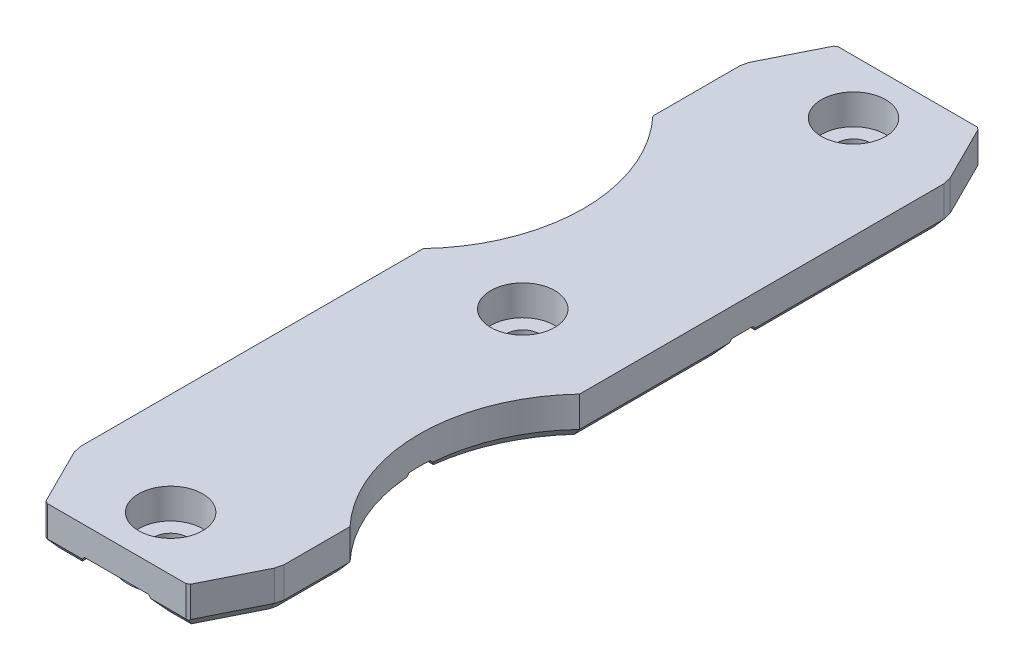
ISO-10303-21;
HEADER;
FILE_DESCRIPTION(('STEP AP214'),'2;1');
FILE_NAME('part.step','',(''),(''),'','','');
FILE_SCHEMA(('AUTOMOTIVE_DESIGN { 1 0 10303 214 1 1 1 1 }'));
ENDSEC;
DATA;
#1=APPLICATION_CONTEXT('core data for automotive mechanical design processes');
#2=APPLICATION_PROTOCOL_DEFINITION('international standard','automotive_design',2000,#1);
#3=PRODUCT_CONTEXT('',#1,'mechanical');
#4=PRODUCT('Part','Part','',(#3));
#5=PRODUCT_RELATED_PRODUCT_CATEGORY('part','',(#4));
#6=PRODUCT_DEFINITION_FORMATION('','',#4);
#7=PRODUCT_DEFINITION_CONTEXT('part definition',#1,'design');
#8=PRODUCT_DEFINITION('design','',#6,#7);
#9=PRODUCT_DEFINITION_SHAPE('','',#8);
#10=(LENGTH_UNIT() NAMED_UNIT(*) SI_UNIT(.MILLI.,.METRE.));
#11=(NAMED_UNIT(*) PLANE_ANGLE_UNIT() SI_UNIT($,.RADIAN.));
#12=(NAMED_UNIT(*) SI_UNIT($,.STERADIAN.) SOLID_ANGLE_UNIT());
#13=UNCERTAINTY_MEASURE_WITH_UNIT(LENGTH_MEASURE(1.E-05),#10,'distance_accuracy_value','');
#14=(GEOMETRIC_REPRESENTATION_CONTEXT(3) GLOBAL_UNCERTAINTY_ASSIGNED_CONTEXT((#13)) GLOBAL_UNIT_ASSIGNED_CONTEXT((#10,
#11,#12)) REPRESENTATION_CONTEXT('',''));
#15=CARTESIAN_POINT('',(0.,0.,0.));
#16=DIRECTION('',(0.,0.,1.));
#17=DIRECTION('',(1.,0.,0.));
#18=AXIS2_PLACEMENT_3D('',#15,#16,#17);
#19=CARTESIAN_POINT('',(7.18613532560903,3.83,31.3051351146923));
#20=DIRECTION('',(0.,1.,0.));
#21=DIRECTION('',(0.,0.,1.));
#22=AXIS2_PLACEMENT_3D('',#19,#20,#21);
#23=PLANE('',#22);
#24=CARTESIAN_POINT('',(28.186135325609,3.83,75.3051351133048));
#25=DIRECTION('',(0.,1.,0.));
#26=DIRECTION('',(0.,0.,1.));
#27=AXIS2_PLACEMENT_3D('',#24,#25,#26);
#28=CIRCLE('',#27,3.);
#29=CARTESIAN_POINT('',(28.186135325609,3.83,78.3051351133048));
#30=VERTEX_POINT('',#29);
#31=EDGE_CURVE('E724',#30,#30,#28,.T.);
#32=ORIENTED_EDGE('',*,*,#31,.F.);
#33=EDGE_LOOP('',(#32));
#34=FACE_BOUND('',#33,.T.);
#35=CARTESIAN_POINT('',(28.186135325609,3.83,42.3051351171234));
#36=DIRECTION('',(0.,1.,0.));
#37=DIRECTION('',(0.,0.,1.));
#38=AXIS2_PLACEMENT_3D('',#35,#36,#37);
#39=CIRCLE('',#38,3.);
#40=CARTESIAN_POINT('',(28.186135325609,3.83,45.3051351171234));
#41=VERTEX_POINT('',#40);
#42=EDGE_CURVE('E718',#41,#41,#39,.T.);
#43=ORIENTED_EDGE('',*,*,#42,.F.);
#44=EDGE_LOOP('',(#43));
#45=FACE_BOUND('',#44,.T.);
#46=CARTESIAN_POINT('',(28.186135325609,3.83,11.3051351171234));
#47=DIRECTION('',(0.,1.,0.));
#48=DIRECTION('',(0.,0.,1.));
#49=AXIS2_PLACEMENT_3D('',#46,#47,#48);
#50=CIRCLE('',#49,3.);
#51=CARTESIAN_POINT('',(28.186135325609,3.83,14.3051351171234));
#52=VERTEX_POINT('',#51);
#53=EDGE_CURVE('E712',#52,#52,#50,.T.);
#54=ORIENTED_EDGE('',*,*,#53,.F.);
#55=EDGE_LOOP('',(#54));
#56=FACE_BOUND('',#55,.T.);
#57=DIRECTION('',(-0.447213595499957,0.,0.894427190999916));
#58=VECTOR('',#57,1.);
#59=CARTESIAN_POINT('',(21.4093191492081,3.83,6.41503238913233));
#60=LINE('',#59,#58);
#61=CARTESIAN_POINT('',(21.4093191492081,3.83,6.41503238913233));
#62=VERTEX_POINT('',#61);
#63=CARTESIAN_POINT('',(18.782031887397,3.83,11.6696069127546));
#64=VERTEX_POINT('',#63);
#65=EDGE_CURVE('E551',#62,#64,#60,.T.);
#66=ORIENTED_EDGE('',*,*,#65,.T.);
#67=DIRECTION('',(-0.219407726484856,0.,0.97563325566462));
#68=VECTOR('',#67,1.);
#69=CARTESIAN_POINT('',(18.782031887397,3.83,11.6696069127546));
#70=LINE('',#69,#68);
#71=CARTESIAN_POINT('',(18.6181861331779,3.83,12.3981745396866));
#72=VERTEX_POINT('',#71);
#73=EDGE_CURVE('E504',#64,#72,#70,.T.);
#74=ORIENTED_EDGE('',*,*,#73,.T.);
#75=DIRECTION('',(0.,0.,1.));
#76=VECTOR('',#75,1.);
#77=CARTESIAN_POINT('',(18.6181861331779,3.83,12.3981745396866));
#78=LINE('',#77,#76);
#79=CARTESIAN_POINT('',(18.6181861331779,3.83,20.5441772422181));
#80=VERTEX_POINT('',#79);
#81=EDGE_CURVE('E502',#72,#80,#78,.T.);
#82=ORIENTED_EDGE('',*,*,#81,.T.);
#83=CARTESIAN_POINT('',(7.18613532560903,3.83,31.3051351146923));
#84=DIRECTION('',(0.,-1.,0.));
#85=DIRECTION('',(0.,0.,1.));
#86=AXIS2_PLACEMENT_3D('',#83,#84,#85);
#87=CIRCLE('',#86,15.7);
#88=CARTESIAN_POINT('',(18.6181861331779,3.83,42.0660929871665));
#89=VERTEX_POINT('',#88);
#90=EDGE_CURVE('E53',#80,#89,#87,.T.);
#91=ORIENTED_EDGE('',*,*,#90,.T.);
#92=DIRECTION('',(0.,0.,1.));
#93=VECTOR('',#92,1.);
#94=CARTESIAN_POINT('',(18.6181861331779,3.83,42.0660929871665));
#95=LINE('',#94,#93);
#96=CARTESIAN_POINT('',(18.6181861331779,3.83,74.2466015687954));
#97=VERTEX_POINT('',#96);
#98=EDGE_CURVE('E490',#89,#97,#95,.T.);
#99=ORIENTED_EDGE('',*,*,#98,.T.);
#100=DIRECTION('',(0.240072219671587,0.,0.97075503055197));
#101=VECTOR('',#100,1.);
#102=CARTESIAN_POINT('',(18.6181861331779,3.83,74.2466015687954));
#103=LINE('',#102,#101);
#104=CARTESIAN_POINT('',(18.7974633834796,3.83,74.9715263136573));
#105=VERTEX_POINT('',#104);
#106=EDGE_CURVE('E496',#97,#105,#103,.T.);
#107=ORIENTED_EDGE('',*,*,#106,.T.);
#108=DIRECTION('',(0.447213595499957,0.,0.894427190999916));
#109=VECTOR('',#108,1.);
#110=CARTESIAN_POINT('',(18.7974633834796,3.83,74.9715263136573));
#111=LINE('',#110,#109);
#112=CARTESIAN_POINT('',(21.4254295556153,3.83,80.2274586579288));
#113=VERTEX_POINT('',#112);
#114=EDGE_CURVE('E509',#105,#113,#111,.T.);
#115=ORIENTED_EDGE('',*,*,#114,.T.);
#116=DIRECTION('',(0.881347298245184,0.,0.47246898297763));
#117=VECTOR('',#116,1.);
#118=CARTESIAN_POINT('',(21.4254295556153,3.83,80.2274586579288));
#119=LINE('',#118,#117);
#120=CARTESIAN_POINT('',(21.6970807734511,3.83,80.3730843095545));
#121=VERTEX_POINT('',#120);
#122=EDGE_CURVE('E512',#113,#121,#119,.T.);
#123=ORIENTED_EDGE('',*,*,#122,.T.);
#124=DIRECTION('',(1.,0.,0.));
#125=VECTOR('',#124,1.);
#126=CARTESIAN_POINT('',(21.6970807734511,3.83,80.3730843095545));
#127=LINE('',#126,#125);
#128=CARTESIAN_POINT('',(34.6751898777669,3.83,80.3730843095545));
#129=VERTEX_POINT('',#128);
#130=EDGE_CURVE('E515',#121,#129,#127,.T.);
#131=ORIENTED_EDGE('',*,*,#130,.T.);
#132=DIRECTION('',(0.881347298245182,0.,-0.472468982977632));
#133=VECTOR('',#132,1.);
#134=CARTESIAN_POINT('',(34.6751898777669,3.83,80.3730843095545));
#135=LINE('',#134,#133);
#136=CARTESIAN_POINT('',(34.9468410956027,3.83,80.2274586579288));
#137=VERTEX_POINT('',#136);
#138=EDGE_CURVE('E518',#129,#137,#135,.T.);
#139=ORIENTED_EDGE('',*,*,#138,.T.);
#140=DIRECTION('',(0.447213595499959,0.,-0.894427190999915));
#141=VECTOR('',#140,1.);
#142=CARTESIAN_POINT('',(34.9468410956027,3.83,80.2274586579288));
#143=LINE('',#142,#141);
#144=CARTESIAN_POINT('',(37.5748072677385,3.83,74.9715263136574));
#145=VERTEX_POINT('',#144);
#146=EDGE_CURVE('E521',#137,#145,#143,.T.);
#147=ORIENTED_EDGE('',*,*,#146,.T.);
#148=DIRECTION('',(0.240072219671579,0.,-0.970755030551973));
#149=VECTOR('',#148,1.);
#150=CARTESIAN_POINT('',(37.5748072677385,3.83,74.9715263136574));
#151=LINE('',#150,#149);
#152=CARTESIAN_POINT('',(37.7540845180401,3.83,74.2466015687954));
#153=VERTEX_POINT('',#152);
#154=EDGE_CURVE('E524',#145,#153,#151,.T.);
#155=ORIENTED_EDGE('',*,*,#154,.T.);
#156=DIRECTION('',(0.,0.,-1.));
#157=VECTOR('',#156,1.);
#158=CARTESIAN_POINT('',(37.7540845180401,3.83,74.2466015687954));
#159=LINE('',#158,#157);
#160=CARTESIAN_POINT('',(37.7540845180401,3.83,68.0660929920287));
#161=VERTEX_POINT('',#160);
#162=EDGE_CURVE('E527',#153,#161,#159,.T.);
#163=ORIENTED_EDGE('',*,*,#162,.T.);
#164=CARTESIAN_POINT('',(49.186135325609,3.83,57.3051351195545));
#165=DIRECTION('',(0.,-1.,0.));
#166=DIRECTION('',(0.,0.,1.));
#167=AXIS2_PLACEMENT_3D('',#164,#165,#166);
#168=CIRCLE('',#167,15.7);
#169=CARTESIAN_POINT('',(37.7540845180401,3.83,46.5441772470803));
#170=VERTEX_POINT('',#169);
#171=EDGE_CURVE('E530',#161,#170,#168,.T.);
#172=ORIENTED_EDGE('',*,*,#171,.T.);
#173=DIRECTION('',(0.,0.,-1.));
#174=VECTOR('',#173,1.);
#175=CARTESIAN_POINT('',(37.7540845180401,3.83,46.5441772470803));
#176=LINE('',#175,#174);
#177=CARTESIAN_POINT('',(37.7540845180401,3.83,12.3981745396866));
#178=VERTEX_POINT('',#177);
#179=EDGE_CURVE('E533',#170,#178,#176,.T.);
#180=ORIENTED_EDGE('',*,*,#179,.T.);
#181=DIRECTION('',(-0.21940772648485,0.,-0.975633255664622));
#182=VECTOR('',#181,1.);
#183=CARTESIAN_POINT('',(37.7540845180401,3.83,12.3981745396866));
#184=LINE('',#183,#182);
#185=CARTESIAN_POINT('',(37.590238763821,3.83,11.6696069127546));
#186=VERTEX_POINT('',#185);
#187=EDGE_CURVE('E536',#178,#186,#184,.T.);
#188=ORIENTED_EDGE('',*,*,#187,.T.);
#189=DIRECTION('',(-0.447213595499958,0.,-0.894427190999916));
#190=VECTOR('',#189,1.);
#191=CARTESIAN_POINT('',(37.590238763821,3.83,11.6696069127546));
#192=LINE('',#191,#190);
#193=CARTESIAN_POINT('',(34.9629515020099,3.83,6.41503238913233));
#194=VERTEX_POINT('',#193);
#195=EDGE_CURVE('E539',#186,#194,#192,.T.);
#196=ORIENTED_EDGE('',*,*,#195,.T.);
#197=DIRECTION('',(-0.81673959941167,0.,-0.577006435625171));
#198=VECTOR('',#197,1.);
#199=CARTESIAN_POINT('',(34.9629515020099,3.83,6.41503238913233));
#200=LINE('',#199,#198);
#201=CARTESIAN_POINT('',(34.7112138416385,3.83,6.23718592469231));
#202=VERTEX_POINT('',#201);
#203=EDGE_CURVE('E542',#194,#202,#200,.T.);
#204=ORIENTED_EDGE('',*,*,#203,.T.);
#205=DIRECTION('',(-1.,0.,0.));
#206=VECTOR('',#205,1.);
#207=CARTESIAN_POINT('',(34.7112138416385,3.83,6.23718592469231));
#208=LINE('',#207,#206);
#209=CARTESIAN_POINT('',(21.6610568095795,3.83,6.23718592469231));
#210=VERTEX_POINT('',#209);
#211=EDGE_CURVE('E545',#202,#210,#208,.T.);
#212=ORIENTED_EDGE('',*,*,#211,.T.);
#213=DIRECTION('',(-0.81673959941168,0.,0.577006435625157));
#214=VECTOR('',#213,1.);
#215=CARTESIAN_POINT('',(21.6610568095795,3.83,6.23718592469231));
#216=LINE('',#215,#214);
#217=EDGE_CURVE('E548',#210,#62,#216,.T.);
#218=ORIENTED_EDGE('',*,*,#217,.T.);
#219=EDGE_LOOP('',(#66,#74,#82,#91,#99,#107,#115,#123,#131,#139,#147,#155,#163,#172,#180,#188,
#196,#204,#212,#218));
#220=FACE_BOUND('',#219,.T.);
#221=ADVANCED_FACE('F36',(#34,#45,#56,#220),#23,.T.);
#222=CARTESIAN_POINT('',(0.,1.2,32.3051351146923));
#223=DIRECTION('',(0.,0.,-1.));
#224=DIRECTION('',(-1.,0.,0.));
#225=AXIS2_PLACEMENT_3D('',#222,#223,#224);
#226=PLANE('',#225);
#227=DIRECTION('',(-1.,0.,0.));
#228=VECTOR('',#227,1.);
#229=CARTESIAN_POINT('',(22.6861353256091,1.00691955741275,32.3051351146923));
#230=LINE('',#229,#228);
#231=CARTESIAN_POINT('',(27.186135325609,1.00691955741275,32.3051351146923));
#232=VERTEX_POINT('',#231);
#233=CARTESIAN_POINT('',(22.8542558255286,1.00691955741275,32.3051351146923));
#234=VERTEX_POINT('',#233);
#235=EDGE_CURVE('E1577',#232,#234,#230,.T.);
#236=ORIENTED_EDGE('',*,*,#235,.T.);
#237=DIRECTION('',(0.,1.,0.));
#238=VECTOR('',#237,1.);
#239=CARTESIAN_POINT('',(22.8542558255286,0.,32.3051351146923));
#240=LINE('',#239,#238);
#241=CARTESIAN_POINT('',(22.8542558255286,1.2,32.3051351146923));
#242=VERTEX_POINT('',#241);
#243=EDGE_CURVE('E652',#234,#242,#240,.T.);
#244=ORIENTED_EDGE('',*,*,#243,.T.);
#245=DIRECTION('',(1.,0.,0.));
#246=VECTOR('',#245,1.);
#247=CARTESIAN_POINT('',(0.,1.2,32.3051351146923));
#248=LINE('',#247,#246);
#249=CARTESIAN_POINT('',(27.186135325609,1.2,32.3051351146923));
#250=VERTEX_POINT('',#249);
#251=EDGE_CURVE('E800',#242,#250,#248,.T.);
#252=ORIENTED_EDGE('',*,*,#251,.T.);
#253=DIRECTION('',(0.,-1.,0.));
#254=VECTOR('',#253,1.);
#255=CARTESIAN_POINT('',(27.186135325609,1.2,32.3051351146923));
#256=LINE('',#255,#254);
#257=EDGE_CURVE('E820',#250,#232,#256,.T.);
#258=ORIENTED_EDGE('',*,*,#257,.T.);
#259=EDGE_LOOP('',(#236,#244,#252,#258));
#260=FACE_BOUND('',#259,.T.);
#261=ADVANCED_FACE('F1591',(#260),#226,.T.);
#262=CARTESIAN_POINT('',(0.,1.2,56.3051351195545));
#263=DIRECTION('',(0.,0.,1.));
#264=DIRECTION('',(1.,0.,0.));
#265=AXIS2_PLACEMENT_3D('',#262,#263,#264);
#266=PLANE('',#265);
#267=DIRECTION('',(-1.,0.,0.));
#268=VECTOR('',#267,1.);
#269=CARTESIAN_POINT('',(0.,1.2,56.3051351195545));
#270=LINE('',#269,#268);
#271=CARTESIAN_POINT('',(27.186135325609,1.2,56.3051351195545));
#272=VERTEX_POINT('',#271);
#273=CARTESIAN_POINT('',(18.6181861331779,1.2,56.3051351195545));
#274=VERTEX_POINT('',#273);
#275=EDGE_CURVE('E789',#272,#274,#270,.T.);
#276=ORIENTED_EDGE('',*,*,#275,.T.);
#277=DIRECTION('',(0.,-1.,0.));
#278=VECTOR('',#277,1.);
#279=CARTESIAN_POINT('',(18.6181861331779,1.2,56.3051351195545));
#280=LINE('',#279,#278);
#281=CARTESIAN_POINT('',(18.6181861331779,1.00691955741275,56.3051351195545));
#282=VERTEX_POINT('',#281);
#283=EDGE_CURVE('E593',#274,#282,#280,.T.);
#284=ORIENTED_EDGE('',*,*,#283,.T.);
#285=DIRECTION('',(1.,0.,0.));
#286=VECTOR('',#285,1.);
#287=CARTESIAN_POINT('',(27.186135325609,1.00691955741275,56.3051351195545));
#288=LINE('',#287,#286);
#289=CARTESIAN_POINT('',(27.186135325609,1.00691955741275,56.3051351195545));
#290=VERTEX_POINT('',#289);
#291=EDGE_CURVE('E1558',#282,#290,#288,.T.);
#292=ORIENTED_EDGE('',*,*,#291,.T.);
#293=DIRECTION('',(0.,-1.,0.));
#294=VECTOR('',#293,1.);
#295=CARTESIAN_POINT('',(27.186135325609,1.2,56.3051351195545));
#296=LINE('',#295,#294);
#297=EDGE_CURVE('E812',#272,#290,#296,.T.);
#298=ORIENTED_EDGE('',*,*,#297,.F.);
#299=EDGE_LOOP('',(#276,#284,#292,#298));
#300=FACE_BOUND('',#299,.T.);
#301=ADVANCED_FACE('F1626',(#300),#266,.T.);
#302=CARTESIAN_POINT('',(37.7800198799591,1.2,11.6019555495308));
#303=DIRECTION('',(-0.685170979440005,0.642787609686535,0.342585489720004));
#304=DIRECTION('',(-0.447213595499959,0.,-0.894427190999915));
#305=AXIS2_PLACEMENT_3D('',#302,#303,#304);
#306=PLANE('',#305);
#307=DIRECTION('',(-0.369198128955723,-0.711923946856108,0.597375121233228));
#308=VECTOR('',#307,1.);
#309=CARTESIAN_POINT('',(34.9672521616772,1.14141270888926,6.086346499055));
#310=LINE('',#309,#308);
#311=CARTESIAN_POINT('',(34.8245449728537,0.866230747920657,6.3172515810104));
#312=VERTEX_POINT('',#311);
#313=CARTESIAN_POINT('',(34.3753245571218,0.,7.04410548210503));
#314=VERTEX_POINT('',#313);
#315=EDGE_CURVE('E727',#312,#314,#310,.T.);
#316=ORIENTED_EDGE('',*,*,#315,.F.);
#317=DIRECTION('',(-0.71167788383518,-0.490636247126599,-0.502782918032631));
#318=VECTOR('',#317,1.);
#319=CARTESIAN_POINT('',(38.3289638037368,3.28220424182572,8.79303727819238));
#320=LINE('',#319,#318);
#321=CARTESIAN_POINT('',(34.9629515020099,0.961649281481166,6.41503238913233));
#322=VERTEX_POINT('',#321);
#323=EDGE_CURVE('E704',#312,#322,#320,.F.);
#324=ORIENTED_EDGE('',*,*,#323,.T.);
#325=DIRECTION('',(-0.447213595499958,0.,-0.894427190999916));
#326=VECTOR('',#325,1.);
#327=CARTESIAN_POINT('',(37.6011344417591,0.961649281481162,11.6913982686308));
#328=LINE('',#327,#326);
#329=CARTESIAN_POINT('',(37.590238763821,0.961649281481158,11.6696069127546));
#330=VERTEX_POINT('',#329);
#331=EDGE_CURVE('E701',#322,#330,#328,.F.);
#332=ORIENTED_EDGE('',*,*,#331,.T.);
#333=DIRECTION('',(-0.608083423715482,-0.763706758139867,0.216763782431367));
#334=VECTOR('',#333,1.);
#335=CARTESIAN_POINT('',(37.7800198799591,1.2,11.6019555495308));
#336=LINE('',#335,#334);
#337=CARTESIAN_POINT('',(36.8245482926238,0.,11.9425529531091));
#338=VERTEX_POINT('',#337);
#339=EDGE_CURVE('E951',#338,#330,#336,.F.);
#340=ORIENTED_EDGE('',*,*,#339,.F.);
#341=DIRECTION('',(0.447213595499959,0.,0.894427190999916));
#342=VECTOR('',#341,1.);
#343=CARTESIAN_POINT('',(38.6418985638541,0.,15.5772534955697));
#344=LINE('',#343,#342);
#345=EDGE_CURVE('E846',#314,#338,#344,.T.);
#346=ORIENTED_EDGE('',*,*,#345,.F.);
#347=EDGE_LOOP('',(#316,#324,#332,#340,#346));
#348=FACE_BOUND('',#347,.T.);
#349=ADVANCED_FACE('F1719',(#348),#306,.F.);
#350=CARTESIAN_POINT('',(34.7747349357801,1.2,6.0371859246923));
#351=DIRECTION('',(0.,0.642787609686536,0.766044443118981));
#352=DIRECTION('',(-1.,0.,0.));
#353=AXIS2_PLACEMENT_3D('',#350,#351,#352);
#354=PLANE('',#353);
#355=DIRECTION('',(0.540716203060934,-0.644400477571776,0.540716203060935));
#356=VECTOR('',#355,1.);
#357=CARTESIAN_POINT('',(29.4210190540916,3.3035836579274,4.27206965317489));
#358=LINE('',#357,#356);
#359=CARTESIAN_POINT('',(31.386135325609,0.961649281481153,6.23718592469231));
#360=VERTEX_POINT('',#359);
#361=CARTESIAN_POINT('',(32.1930548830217,0.,7.04410548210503));
#362=VERTEX_POINT('',#361);
#363=EDGE_CURVE('E949',#360,#362,#358,.T.);
#364=ORIENTED_EDGE('',*,*,#363,.F.);
#365=DIRECTION('',(-1.,0.,0.));
#366=VECTOR('',#365,1.);
#367=CARTESIAN_POINT('',(34.7747349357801,0.96164928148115,6.23718592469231));
#368=LINE('',#367,#366);
#369=CARTESIAN_POINT('',(34.7112138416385,0.961649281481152,6.23718592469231));
#370=VERTEX_POINT('',#369);
#371=EDGE_CURVE('E631',#360,#370,#368,.F.);
#372=ORIENTED_EDGE('',*,*,#371,.T.);
#373=DIRECTION('',(-0.672980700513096,0.566612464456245,-0.47544430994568));
#374=VECTOR('',#373,1.);
#375=CARTESIAN_POINT('',(34.5851020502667,1.06782842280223,6.14809104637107));
#376=LINE('',#375,#374);
#377=EDGE_CURVE('E11',#370,#312,#376,.F.);
#378=ORIENTED_EDGE('',*,*,#377,.T.);
#379=ORIENTED_EDGE('',*,*,#315,.T.);
#380=DIRECTION('',(1.,0.,0.));
#381=VECTOR('',#380,1.);
#382=CARTESIAN_POINT('',(7.18613532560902,0.,7.04410548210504));
#383=LINE('',#382,#381);
#384=EDGE_CURVE('E843',#362,#314,#383,.T.);
#385=ORIENTED_EDGE('',*,*,#384,.F.);
#386=EDGE_LOOP('',(#364,#372,#378,#379,#385));
#387=FACE_BOUND('',#386,.T.);
#388=ADVANCED_FACE('F1930',(#387),#354,.F.);
#389=CARTESIAN_POINT('',(37.9540845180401,1.2,12.3759631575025));
#390=DIRECTION('',(-0.747378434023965,0.642787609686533,0.168076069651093));
#391=DIRECTION('',(-0.219407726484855,0.,-0.975633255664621));
#392=AXIS2_PLACEMENT_3D('',#389,#390,#391);
#393=PLANE('',#392);
#394=ORIENTED_EDGE('',*,*,#339,.T.);
#395=DIRECTION('',(-0.21940772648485,0.,-0.975633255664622));
#396=VECTOR('',#395,1.);
#397=CARTESIAN_POINT('',(37.7589578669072,0.961649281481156,12.4198447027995));
#398=LINE('',#397,#396);
#399=CARTESIAN_POINT('',(37.7540845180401,0.961649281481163,12.3981745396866));
#400=VERTEX_POINT('',#399);
#401=EDGE_CURVE('E698',#330,#400,#398,.F.);
#402=ORIENTED_EDGE('',*,*,#401,.T.);
#403=DIRECTION('',(-0.64115603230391,-0.764100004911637,0.0712048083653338));
#404=VECTOR('',#403,1.);
#405=CARTESIAN_POINT('',(37.9540845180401,1.2,12.3759631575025));
#406=LINE('',#405,#404);
#407=CARTESIAN_POINT('',(36.9471649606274,0.,12.4877885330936));
#408=VERTEX_POINT('',#407);
#409=EDGE_CURVE('E946',#408,#400,#406,.F.);
#410=ORIENTED_EDGE('',*,*,#409,.F.);
#411=DIRECTION('',(0.219407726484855,0.,0.975633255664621));
#412=VECTOR('',#411,1.);
#413=CARTESIAN_POINT('',(39.5425453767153,0.,24.0285828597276));
#414=LINE('',#413,#412);
#415=EDGE_CURVE('E848',#338,#408,#414,.T.);
#416=ORIENTED_EDGE('',*,*,#415,.F.);
#417=EDGE_LOOP('',(#394,#402,#410,#416));
#418=FACE_BOUND('',#417,.T.);
#419=ADVANCED_FACE('F936',(#418),#393,.F.);
#420=CARTESIAN_POINT('',(31.186135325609,1.2,0.));
#421=DIRECTION('',(0.766044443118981,0.642787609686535,0.));
#422=DIRECTION('',(0.,0.,1.));
#423=AXIS2_PLACEMENT_3D('',#420,#421,#422);
#424=PLANE('',#423);
#425=DIRECTION('',(0.,0.,1.));
#426=VECTOR('',#425,1.);
#427=CARTESIAN_POINT('',(31.186135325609,1.2,0.));
#428=LINE('',#427,#426);
#429=CARTESIAN_POINT('',(31.186135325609,1.2,6.23718592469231));
#430=VERTEX_POINT('',#429);
#431=CARTESIAN_POINT('',(31.186135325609,1.2,7.95103315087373));
#432=VERTEX_POINT('',#431);
#433=EDGE_CURVE('E749',#430,#432,#428,.T.);
#434=ORIENTED_EDGE('',*,*,#433,.F.);
#435=DIRECTION('',(-0.642787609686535,0.766044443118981,0.));
#436=VECTOR('',#435,1.);
#437=CARTESIAN_POINT('',(31.186135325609,1.2,6.23718592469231));
#438=LINE('',#437,#436);
#439=EDGE_CURVE('E628',#430,#360,#438,.F.);
#440=ORIENTED_EDGE('',*,*,#439,.T.);
#441=ORIENTED_EDGE('',*,*,#363,.T.);
#442=DIRECTION('',(0.,0.,-1.));
#443=VECTOR('',#442,1.);
#444=CARTESIAN_POINT('',(32.1930548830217,0.,31.3051351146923));
#445=LINE('',#444,#443);
#446=CARTESIAN_POINT('',(32.1930548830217,0.,7.52746934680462));
#447=VERTEX_POINT('',#446);
#448=EDGE_CURVE('E840',#447,#362,#445,.T.);
#449=ORIENTED_EDGE('',*,*,#448,.F.);
#450=CARTESIAN_POINT('',(31.186135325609,1.2,7.95103315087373));
#451=CARTESIAN_POINT('',(31.2696821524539,1.1004327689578,7.91367232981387));
#452=CARTESIAN_POINT('',(31.3533341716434,1.00074017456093,7.87688379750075));
#453=CARTESIAN_POINT('',(31.5208228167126,0.801134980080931,7.80436644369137));
#454=CARTESIAN_POINT('',(31.6046594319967,0.701222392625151,7.76863756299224));
#455=CARTESIAN_POINT('',(31.7724997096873,0.501198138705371,7.69815096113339));
#456=CARTESIAN_POINT('',(31.8565033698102,0.401086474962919,7.66339322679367));
#457=CARTESIAN_POINT('',(32.0246671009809,0.20067674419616,7.59477533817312));
#458=CARTESIAN_POINT('',(32.1088271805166,0.100378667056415,7.56091523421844));
#459=CARTESIAN_POINT('',(32.1930548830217,0.,7.52746934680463));
#460=B_SPLINE_CURVE_WITH_KNOTS('',3,(#450,#451,#452,#453,#454,#455,#456,#457,#458,#459),
.UNSPECIFIED.,.F.,.F.,(4,2,2,2,4),(0.,0.405713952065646,0.811405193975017,1.21709092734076,
1.62279935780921),.UNSPECIFIED.);
#461=EDGE_CURVE('E939',#432,#447,#460,.T.);
#462=ORIENTED_EDGE('',*,*,#461,.F.);
#463=EDGE_LOOP('',(#434,#440,#441,#449,#462));
#464=FACE_BOUND('',#463,.T.);
#465=ADVANCED_FACE('F929',(#464),#424,.F.);
#466=CARTESIAN_POINT('',(37.9540845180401,1.2,46.6237946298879));
#467=DIRECTION('',(-0.766044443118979,0.642787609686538,0.));
#468=DIRECTION('',(0.,0.,-1.));
#469=AXIS2_PLACEMENT_3D('',#466,#467,#468);
#470=PLANE('',#469);
#471=ORIENTED_EDGE('',*,*,#409,.T.);
#472=DIRECTION('',(0.,0.,-1.));
#473=VECTOR('',#472,1.);
#474=CARTESIAN_POINT('',(37.7540845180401,0.961649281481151,46.6237946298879));
#475=LINE('',#474,#473);
#476=CARTESIAN_POINT('',(37.7540845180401,0.961649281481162,30.1051351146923));
#477=VERTEX_POINT('',#476);
#478=EDGE_CURVE('E695',#400,#477,#475,.F.);
#479=ORIENTED_EDGE('',*,*,#478,.T.);
#480=DIRECTION('',(-0.540716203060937,-0.644400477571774,-0.540716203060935));
#481=VECTOR('',#480,1.);
#482=CARTESIAN_POINT('',(42.7252364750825,6.88603748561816,35.0762870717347));
#483=LINE('',#482,#481);
#484=CARTESIAN_POINT('',(36.9471649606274,0.,29.2982155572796));
#485=VERTEX_POINT('',#484);
#486=EDGE_CURVE('E904',#485,#477,#483,.F.);
#487=ORIENTED_EDGE('',*,*,#486,.F.);
#488=DIRECTION('',(0.,0.,1.));
#489=VECTOR('',#488,1.);
#490=CARTESIAN_POINT('',(36.9471649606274,0.,31.3051351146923));
#491=LINE('',#490,#489);
#492=EDGE_CURVE('E850',#408,#485,#491,.T.);
#493=ORIENTED_EDGE('',*,*,#492,.F.);
#494=EDGE_LOOP('',(#471,#479,#487,#493));
#495=FACE_BOUND('',#494,.T.);
#496=ADVANCED_FACE('F927',(#495),#470,.F.);
#497=CARTESIAN_POINT('',(0.,1.2,30.3051351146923));
#498=DIRECTION('',(0.,0.642787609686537,-0.76604444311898));
#499=DIRECTION('',(1.,0.,0.));
#500=AXIS2_PLACEMENT_3D('',#497,#498,#499);
#501=PLANE('',#500);
#502=ORIENTED_EDGE('',*,*,#486,.T.);
#503=DIRECTION('',(0.,-0.76604444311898,-0.642787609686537));
#504=VECTOR('',#503,1.);
#505=CARTESIAN_POINT('',(37.7540845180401,1.2,30.3051351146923));
#506=LINE('',#505,#504);
#507=CARTESIAN_POINT('',(37.7540845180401,1.2,30.3051351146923));
#508=VERTEX_POINT('',#507);
#509=EDGE_CURVE('E692',#477,#508,#506,.F.);
#510=ORIENTED_EDGE('',*,*,#509,.T.);
#511=DIRECTION('',(1.,0.,0.));
#512=VECTOR('',#511,1.);
#513=CARTESIAN_POINT('',(0.,1.2,30.3051351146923));
#514=LINE('',#513,#512);
#515=CARTESIAN_POINT('',(29.186135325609,1.2,30.3051351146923));
#516=VERTEX_POINT('',#515);
#517=EDGE_CURVE('E756',#516,#508,#514,.T.);
#518=ORIENTED_EDGE('',*,*,#517,.F.);
#519=DIRECTION('',(0.540716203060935,-0.644400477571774,-0.540716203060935));
#520=VECTOR('',#519,1.);
#521=CARTESIAN_POINT('',(20.6528678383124,11.3695521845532,38.838402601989));
#522=LINE('',#521,#520);
#523=CARTESIAN_POINT('',(30.1930548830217,0.,29.2982155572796));
#524=VERTEX_POINT('',#523);
#525=EDGE_CURVE('E893',#524,#516,#522,.F.);
#526=ORIENTED_EDGE('',*,*,#525,.F.);
#527=DIRECTION('',(-1.,0.,0.));
#528=VECTOR('',#527,1.);
#529=CARTESIAN_POINT('',(7.18613532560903,0.,29.2982155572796));
#530=LINE('',#529,#528);
#531=EDGE_CURVE('E852',#485,#524,#530,.T.);
#532=ORIENTED_EDGE('',*,*,#531,.F.);
#533=EDGE_LOOP('',(#502,#510,#518,#526,#532));
#534=FACE_BOUND('',#533,.T.);
#535=ADVANCED_FACE('F920',(#534),#501,.F.);
#536=CARTESIAN_POINT('',(0.,1.2,32.3051351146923));
#537=DIRECTION('',(0.,0.642787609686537,0.76604444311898));
#538=DIRECTION('',(-1.,0.,0.));
#539=AXIS2_PLACEMENT_3D('',#536,#537,#538);
#540=PLANE('',#539);
#541=DIRECTION('',(-1.,0.,0.));
#542=VECTOR('',#541,1.);
#543=CARTESIAN_POINT('',(0.,1.2,32.3051351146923));
#544=LINE('',#543,#542);
#545=CARTESIAN_POINT('',(37.7540845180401,1.2,32.3051351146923));
#546=VERTEX_POINT('',#545);
#547=CARTESIAN_POINT('',(29.186135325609,1.2,32.3051351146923));
#548=VERTEX_POINT('',#547);
#549=EDGE_CURVE('E759',#546,#548,#544,.T.);
#550=ORIENTED_EDGE('',*,*,#549,.F.);
#551=DIRECTION('',(0.,0.76604444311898,-0.642787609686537));
#552=VECTOR('',#551,1.);
#553=CARTESIAN_POINT('',(37.7540845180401,1.2,32.3051351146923));
#554=LINE('',#553,#552);
#555=CARTESIAN_POINT('',(37.7540845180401,0.961649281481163,32.5051351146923));
#556=VERTEX_POINT('',#555);
#557=EDGE_CURVE('E686',#546,#556,#554,.F.);
#558=ORIENTED_EDGE('',*,*,#557,.T.);
#559=DIRECTION('',(-0.540716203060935,-0.644400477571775,0.540716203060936));
#560=VECTOR('',#559,1.);
#561=CARTESIAN_POINT('',(26.8572965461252,-12.024636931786,43.4019230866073));
#562=LINE('',#561,#560);
#563=CARTESIAN_POINT('',(36.9471649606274,0.,33.312054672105));
#564=VERTEX_POINT('',#563);
#565=EDGE_CURVE('E1444',#564,#556,#562,.F.);
#566=ORIENTED_EDGE('',*,*,#565,.F.);
#567=DIRECTION('',(1.,0.,0.));
#568=VECTOR('',#567,1.);
#569=CARTESIAN_POINT('',(7.18613532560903,0.,33.312054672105));
#570=LINE('',#569,#568);
#571=CARTESIAN_POINT('',(30.1930548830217,0.,33.312054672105));
#572=VERTEX_POINT('',#571);
#573=EDGE_CURVE('E865',#572,#564,#570,.T.);
#574=ORIENTED_EDGE('',*,*,#573,.F.);
#575=DIRECTION('',(0.540716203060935,-0.644400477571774,0.540716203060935));
#576=VECTOR('',#575,1.);
#577=CARTESIAN_POINT('',(19.7409533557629,12.4563295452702,22.8599531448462));
#578=LINE('',#577,#576);
#579=EDGE_CURVE('E1020',#572,#548,#578,.F.);
#580=ORIENTED_EDGE('',*,*,#579,.T.);
#581=EDGE_LOOP('',(#550,#558,#566,#574,#580));
#582=FACE_BOUND('',#581,.T.);
#583=ADVANCED_FACE('F926',(#582),#540,.F.);
#584=CARTESIAN_POINT('',(49.186135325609,1.20000000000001,57.3051351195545));
#585=DIRECTION('',(0.,-1.,0.));
#586=DIRECTION('',(0.,0.,-1.));
#587=AXIS2_PLACEMENT_3D('',#584,#585,#586);
#588=CONICAL_SURFACE('',#587,15.5,0.698131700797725);
#589=CARTESIAN_POINT('',(37.9540845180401,1.20000000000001,46.6237946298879));
#590=CARTESIAN_POINT('',(37.7864467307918,1.00021706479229,46.556832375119));
#591=CARTESIAN_POINT('',(37.6187178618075,0.800325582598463,46.4904320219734));
#592=CARTESIAN_POINT('',(37.2830780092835,0.400325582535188,46.3587551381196));
#593=CARTESIAN_POINT('',(37.1151670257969,0.200217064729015,46.2934786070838));
#594=CARTESIAN_POINT('',(36.9471649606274,0.,46.2287639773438));
#595=B_SPLINE_CURVE_WITH_KNOTS('',3,(#589,#590,#591,#592,#593,#594),.UNSPECIFIED.,.F.,.F.,(4,2,
4),(0.,0.807766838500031,1.61553344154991),.UNSPECIFIED.);
#596=CARTESIAN_POINT('',(36.9471649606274,0.,46.2287639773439));
#597=VERTEX_POINT('',#596);
#598=CARTESIAN_POINT('',(37.7540845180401,0.961649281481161,46.5441772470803));
#599=VERTEX_POINT('',#598);
#600=EDGE_CURVE('E955',#597,#599,#595,.F.);
#601=ORIENTED_EDGE('',*,*,#600,.T.);
#602=CARTESIAN_POINT('',(49.186135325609,0.961649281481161,57.3051351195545));
#603=DIRECTION('',(0.,-1.,0.));
#604=DIRECTION('',(0.,0.,-1.));
#605=AXIS2_PLACEMENT_3D('',#602,#603,#604);
#606=CIRCLE('',#605,15.7);
#607=CARTESIAN_POINT('',(33.532062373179,0.961649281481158,56.1051351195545));
#608=VERTEX_POINT('',#607);
#609=EDGE_CURVE('E680',#599,#608,#606,.F.);
#610=ORIENTED_EDGE('',*,*,#609,.T.);
#611=CARTESIAN_POINT('',(32.8016711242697,0.,55.2982155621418));
#612=CARTESIAN_POINT('',(32.8764617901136,0.100715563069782,55.3827259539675));
#613=CARTESIAN_POINT('',(32.9516390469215,0.201262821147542,55.4670951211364));
#614=CARTESIAN_POINT('',(33.1027863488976,0.402001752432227,55.6355350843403));
#615=CARTESIAN_POINT('',(33.1787563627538,0.502193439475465,55.7196058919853));
#616=CARTESIAN_POINT('',(33.3315149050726,0.702210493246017,55.8874401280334));
#617=CARTESIAN_POINT('',(33.4083034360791,0.802035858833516,55.97120355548));
#618=CARTESIAN_POINT('',(33.5627258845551,1.00130742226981,56.1384122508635));
#619=CARTESIAN_POINT('',(33.6403598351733,1.10075360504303,56.2218575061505));
#620=CARTESIAN_POINT('',(33.718427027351,1.20000000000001,56.3051351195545));
#621=B_SPLINE_CURVE_WITH_KNOTS('',3,(#611,#612,#613,#614,#615,#616,#617,#618,#619,#620),
.UNSPECIFIED.,.F.,.F.,(4,2,2,2,4),(0.,0.453776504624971,0.907535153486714,1.3612952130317,
1.81507312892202),.UNSPECIFIED.);
#622=CARTESIAN_POINT('',(32.8016711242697,0.,55.2982155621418));
#623=VERTEX_POINT('',#622);
#624=EDGE_CURVE('E964',#608,#623,#621,.F.);
#625=ORIENTED_EDGE('',*,*,#624,.T.);
#626=CARTESIAN_POINT('',(49.186135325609,0.,57.3051351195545));
#627=DIRECTION('',(0.,1.,0.));
#628=DIRECTION('',(0.,0.,1.));
#629=AXIS2_PLACEMENT_3D('',#626,#627,#628);
#630=CIRCLE('',#629,16.5069195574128);
#631=EDGE_CURVE('E869',#597,#623,#630,.T.);
#632=ORIENTED_EDGE('',*,*,#631,.F.);
#633=EDGE_LOOP('',(#601,#610,#625,#632));
#634=FACE_BOUND('',#633,.T.);
#635=ADVANCED_FACE('F977',(#634),#588,.F.);
#636=CARTESIAN_POINT('',(49.186135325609,1.2,57.3051351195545));
#637=DIRECTION('',(0.,-1.,0.));
#638=DIRECTION('',(0.,0.,-1.));
#639=AXIS2_PLACEMENT_3D('',#636,#637,#638);
#640=CONICAL_SURFACE('',#639,15.5,0.69813170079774);
#641=CARTESIAN_POINT('',(33.718427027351,1.2,58.3051351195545));
#642=CARTESIAN_POINT('',(33.6403598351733,1.10075360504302,58.3884127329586));
#643=CARTESIAN_POINT('',(33.5627258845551,1.00130742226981,58.4718579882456));
#644=CARTESIAN_POINT('',(33.408303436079,0.802035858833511,58.6390666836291));
#645=CARTESIAN_POINT('',(33.3315149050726,0.702210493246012,58.7228301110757));
#646=CARTESIAN_POINT('',(33.1787563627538,0.50219343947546,58.8906643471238));
#647=CARTESIAN_POINT('',(33.1027863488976,0.402001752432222,58.9747351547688));
#648=CARTESIAN_POINT('',(32.9516390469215,0.201262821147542,59.1431751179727));
#649=CARTESIAN_POINT('',(32.8764617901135,0.100715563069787,59.2275442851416));
#650=CARTESIAN_POINT('',(32.8016711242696,0.,59.3120546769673));
#651=B_SPLINE_CURVE_WITH_KNOTS('',3,(#641,#642,#643,#644,#645,#646,#647,#648,#649,#650),
.UNSPECIFIED.,.F.,.F.,(4,2,2,2,4),(0.,0.453777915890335,0.907537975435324,1.36129662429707,
1.81507312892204),.UNSPECIFIED.);
#652=CARTESIAN_POINT('',(32.8016711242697,0.,59.3120546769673));
#653=VERTEX_POINT('',#652);
#654=CARTESIAN_POINT('',(33.532062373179,0.961649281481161,58.5051351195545));
#655=VERTEX_POINT('',#654);
#656=EDGE_CURVE('E1082',#653,#655,#651,.F.);
#657=ORIENTED_EDGE('',*,*,#656,.T.);
#658=CARTESIAN_POINT('',(49.186135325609,0.961649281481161,57.3051351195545));
#659=DIRECTION('',(0.,-1.,0.));
#660=DIRECTION('',(0.,0.,-1.));
#661=AXIS2_PLACEMENT_3D('',#658,#659,#660);
#662=CIRCLE('',#661,15.7);
#663=CARTESIAN_POINT('',(37.7540845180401,0.961649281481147,68.0660929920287));
#664=VERTEX_POINT('',#663);
#665=EDGE_CURVE('E668',#655,#664,#662,.F.);
#666=ORIENTED_EDGE('',*,*,#665,.T.);
#667=CARTESIAN_POINT('',(37.9540845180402,1.2,67.9864756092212));
#668=CARTESIAN_POINT('',(37.7864467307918,1.00021706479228,68.0534378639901));
#669=CARTESIAN_POINT('',(37.6187178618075,0.800325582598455,68.1198382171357));
#670=CARTESIAN_POINT('',(37.2830780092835,0.400325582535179,68.2515151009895));
#671=CARTESIAN_POINT('',(37.1151670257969,0.200217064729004,68.3167916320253));
#672=CARTESIAN_POINT('',(36.9471649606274,0.,68.3815062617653));
#673=B_SPLINE_CURVE_WITH_KNOTS('',3,(#667,#668,#669,#670,#671,#672),.UNSPECIFIED.,.F.,.F.,(4,2,
4),(0.,0.807766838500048,1.61553344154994),.UNSPECIFIED.);
#674=CARTESIAN_POINT('',(36.9471649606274,0.,68.3815062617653));
#675=VERTEX_POINT('',#674);
#676=EDGE_CURVE('E1074',#675,#664,#673,.F.);
#677=ORIENTED_EDGE('',*,*,#676,.F.);
#678=CARTESIAN_POINT('',(49.186135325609,0.,57.3051351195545));
#679=DIRECTION('',(0.,1.,0.));
#680=DIRECTION('',(0.,0.,1.));
#681=AXIS2_PLACEMENT_3D('',#678,#679,#680);
#682=CIRCLE('',#681,16.5069195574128);
#683=EDGE_CURVE('E883',#653,#675,#682,.T.);
#684=ORIENTED_EDGE('',*,*,#683,.F.);
#685=EDGE_LOOP('',(#657,#666,#677,#684));
#686=FACE_BOUND('',#685,.T.);
#687=ADVANCED_FACE('F983',(#686),#640,.F.);
#688=CARTESIAN_POINT('',(31.1861353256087,1.2,-1.13069256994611E-13));
#689=DIRECTION('',(0.766044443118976,0.642787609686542,0.));
#690=DIRECTION('',(0.,0.,1.));
#691=AXIS2_PLACEMENT_3D('',#688,#689,#690);
#692=PLANE('',#691);
#693=DIRECTION('',(0.540716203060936,-0.644400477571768,-0.540716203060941));
#694=VECTOR('',#693,1.);
#695=CARTESIAN_POINT('',(28.3970974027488,4.52384596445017,83.3621222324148));
#696=LINE('',#695,#694);
#697=CARTESIAN_POINT('',(31.386135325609,0.961649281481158,80.3730843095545));
#698=VERTEX_POINT('',#697);
#699=CARTESIAN_POINT('',(32.1930548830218,0.,79.5661647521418));
#700=VERTEX_POINT('',#699);
#701=EDGE_CURVE('E1395',#698,#700,#696,.T.);
#702=ORIENTED_EDGE('',*,*,#701,.F.);
#703=DIRECTION('',(0.642787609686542,-0.766044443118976,0.));
#704=VECTOR('',#703,1.);
#705=CARTESIAN_POINT('',(31.1861353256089,1.20000000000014,80.3730843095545));
#706=LINE('',#705,#704);
#707=CARTESIAN_POINT('',(31.186135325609,1.2,80.3730843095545));
#708=VERTEX_POINT('',#707);
#709=EDGE_CURVE('E616',#698,#708,#706,.F.);
#710=ORIENTED_EDGE('',*,*,#709,.T.);
#711=DIRECTION('',(0.,0.,1.));
#712=VECTOR('',#711,1.);
#713=CARTESIAN_POINT('',(31.1861353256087,1.2,-1.13069256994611E-13));
#714=LINE('',#713,#712);
#715=CARTESIAN_POINT('',(31.186135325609,1.2,78.6592370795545));
#716=VERTEX_POINT('',#715);
#717=EDGE_CURVE('E776',#716,#708,#714,.T.);
#718=ORIENTED_EDGE('',*,*,#717,.F.);
#719=CARTESIAN_POINT('',(31.186135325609,1.2,78.6592370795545));
#720=CARTESIAN_POINT('',(31.2696821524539,1.1004327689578,78.6965979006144));
#721=CARTESIAN_POINT('',(31.3533341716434,1.00074017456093,78.7333864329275));
#722=CARTESIAN_POINT('',(31.5208228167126,0.801134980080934,78.8059037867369));
#723=CARTESIAN_POINT('',(31.6046594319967,0.701222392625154,78.841632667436));
#724=CARTESIAN_POINT('',(31.7724997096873,0.501198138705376,78.9121192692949));
#725=CARTESIAN_POINT('',(31.8565033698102,0.401086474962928,78.9468770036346));
#726=CARTESIAN_POINT('',(32.0246671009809,0.200676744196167,79.0154948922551));
#727=CARTESIAN_POINT('',(32.1088271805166,0.10037866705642,79.0493549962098));
#728=CARTESIAN_POINT('',(32.1930548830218,0.,79.0828008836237));
#729=B_SPLINE_CURVE_WITH_KNOTS('',3,(#719,#720,#721,#722,#723,#724,#725,#726,#727,#728),
.UNSPECIFIED.,.F.,.F.,(4,2,2,2,4),(0.,0.405713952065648,0.811405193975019,1.21709092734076,
1.62279935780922),.UNSPECIFIED.);
#730=CARTESIAN_POINT('',(32.1930548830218,0.,79.0828008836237));
#731=VERTEX_POINT('',#730);
#732=EDGE_CURVE('E1091',#716,#731,#729,.T.);
#733=ORIENTED_EDGE('',*,*,#732,.T.);
#734=DIRECTION('',(0.,0.,-1.));
#735=VECTOR('',#734,1.);
#736=CARTESIAN_POINT('',(32.1930548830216,0.,31.3051351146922));
#737=LINE('',#736,#735);
#738=EDGE_CURVE('E875',#700,#731,#737,.T.);
#739=ORIENTED_EDGE('',*,*,#738,.F.);
#740=EDGE_LOOP('',(#702,#710,#718,#733,#739));
#741=FACE_BOUND('',#740,.T.);
#742=ADVANCED_FACE('F1068',(#741),#692,.F.);
#743=CARTESIAN_POINT('',(37.9540845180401,1.2,74.2709650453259));
#744=DIRECTION('',(-0.766044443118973,0.642787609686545,0.));
#745=DIRECTION('',(0.,0.,-1.));
#746=AXIS2_PLACEMENT_3D('',#743,#744,#745);
#747=PLANE('',#746);
#748=ORIENTED_EDGE('',*,*,#676,.T.);
#749=DIRECTION('',(0.,0.,-1.));
#750=VECTOR('',#749,1.);
#751=CARTESIAN_POINT('',(37.7540845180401,0.961649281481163,74.2709650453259));
#752=LINE('',#751,#750);
#753=CARTESIAN_POINT('',(37.7540845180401,0.961649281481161,74.2466015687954));
#754=VERTEX_POINT('',#753);
#755=EDGE_CURVE('E665',#664,#754,#752,.F.);
#756=ORIENTED_EDGE('',*,*,#755,.T.);
#757=DIRECTION('',(-0.640826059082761,-0.763706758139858,-0.0780637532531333));
#758=VECTOR('',#757,1.);
#759=CARTESIAN_POINT('',(37.9540845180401,1.2,74.2709650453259));
#760=LINE('',#759,#758);
#761=CARTESIAN_POINT('',(36.9471649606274,0.,74.1483047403));
#762=VERTEX_POINT('',#761);
#763=EDGE_CURVE('E1392',#762,#754,#760,.F.);
#764=ORIENTED_EDGE('',*,*,#763,.F.);
#765=DIRECTION('',(0.,0.,1.));
#766=VECTOR('',#765,1.);
#767=CARTESIAN_POINT('',(36.9471649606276,0.,31.3051351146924));
#768=LINE('',#767,#766);
#769=EDGE_CURVE('E885',#675,#762,#768,.T.);
#770=ORIENTED_EDGE('',*,*,#769,.F.);
#771=EDGE_LOOP('',(#748,#756,#764,#770));
#772=FACE_BOUND('',#771,.T.);
#773=ADVANCED_FACE('F1060',(#772),#747,.F.);
#774=CARTESIAN_POINT('',(21.6468541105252,1.2,80.5730843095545));
#775=DIRECTION('',(0.,0.642787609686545,-0.766044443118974));
#776=DIRECTION('',(1.,0.,0.));
#777=AXIS2_PLACEMENT_3D('',#774,#775,#776);
#778=PLANE('',#777);
#779=DIRECTION('',(0.369198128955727,0.7119239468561,0.597375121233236));
#780=VECTOR('',#779,1.);
#781=CARTESIAN_POINT('',(33.1778267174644,-2.30913247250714,77.6285725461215));
#782=LINE('',#781,#780);
#783=CARTESIAN_POINT('',(34.8245449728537,0.866230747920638,80.2930186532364));
#784=VERTEX_POINT('',#783);
#785=CARTESIAN_POINT('',(34.3753245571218,0.,79.5661647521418));
#786=VERTEX_POINT('',#785);
#787=EDGE_CURVE('E1396',#784,#786,#782,.F.);
#788=ORIENTED_EDGE('',*,*,#787,.F.);
#789=DIRECTION('',(0.767974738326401,-0.490636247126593,-0.411692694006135));
#790=VECTOR('',#789,1.);
#791=CARTESIAN_POINT('',(26.8382267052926,5.96845225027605,84.5742908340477));
#792=LINE('',#791,#790);
#793=CARTESIAN_POINT('',(34.6751898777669,0.961649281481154,80.3730843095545));
#794=VERTEX_POINT('',#793);
#795=EDGE_CURVE('E659',#784,#794,#792,.F.);
#796=ORIENTED_EDGE('',*,*,#795,.T.);
#797=DIRECTION('',(1.,0.,0.));
#798=VECTOR('',#797,1.);
#799=CARTESIAN_POINT('',(21.6468541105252,0.961649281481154,80.3730843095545));
#800=LINE('',#799,#798);
#801=EDGE_CURVE('E619',#794,#698,#800,.F.);
#802=ORIENTED_EDGE('',*,*,#801,.T.);
#803=ORIENTED_EDGE('',*,*,#701,.T.);
#804=DIRECTION('',(-1.,0.,0.));
#805=VECTOR('',#804,1.);
#806=CARTESIAN_POINT('',(7.18613532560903,0.,79.5661647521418));
#807=LINE('',#806,#805);
#808=EDGE_CURVE('E872',#786,#700,#807,.T.);
#809=ORIENTED_EDGE('',*,*,#808,.F.);
#810=EDGE_LOOP('',(#788,#796,#802,#803,#809));
#811=FACE_BOUND('',#810,.T.);
#812=ADVANCED_FACE('F1053',(#811),#778,.F.);
#813=CARTESIAN_POINT('',(37.763625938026,1.2,75.0411025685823));
#814=DIRECTION('',(-0.743641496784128,0.642787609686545,-0.183905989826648));
#815=DIRECTION('',(0.240072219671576,0.,-0.970755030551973));
#816=AXIS2_PLACEMENT_3D('',#813,#814,#815);
#817=PLANE('',#816);
#818=ORIENTED_EDGE('',*,*,#763,.T.);
#819=DIRECTION('',(0.240072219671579,0.,-0.970755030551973));
#820=VECTOR('',#819,1.);
#821=CARTESIAN_POINT('',(37.5694749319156,0.96164928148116,74.993088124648));
#822=LINE('',#821,#820);
#823=CARTESIAN_POINT('',(37.5748072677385,0.961649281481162,74.9715263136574));
#824=VERTEX_POINT('',#823);
#825=EDGE_CURVE('E662',#754,#824,#822,.F.);
#826=ORIENTED_EDGE('',*,*,#825,.T.);
#827=DIRECTION('',(-0.605311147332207,-0.764100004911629,-0.223046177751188));
#828=VECTOR('',#827,1.);
#829=CARTESIAN_POINT('',(37.763625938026,1.2,75.0411025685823));
#830=LINE('',#829,#828);
#831=CARTESIAN_POINT('',(36.8129998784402,0.,74.690814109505));
#832=VERTEX_POINT('',#831);
#833=EDGE_CURVE('E1028',#832,#824,#830,.F.);
#834=ORIENTED_EDGE('',*,*,#833,.F.);
#835=DIRECTION('',(-0.240072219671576,0.,0.970755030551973));
#836=VECTOR('',#835,1.);
#837=CARTESIAN_POINT('',(45.2165548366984,0.,40.7102341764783));
#838=LINE('',#837,#836);
#839=EDGE_CURVE('E887',#762,#832,#838,.T.);
#840=ORIENTED_EDGE('',*,*,#839,.F.);
#841=EDGE_LOOP('',(#818,#826,#834,#840));
#842=FACE_BOUND('',#841,.T.);
#843=ADVANCED_FACE('F1046',(#842),#817,.F.);
#844=CARTESIAN_POINT('',(35.0973190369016,1.2,80.3737163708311));
#845=DIRECTION('',(-0.685170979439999,0.642787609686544,-0.34258548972));
#846=DIRECTION('',(0.447213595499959,0.,-0.894427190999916));
#847=AXIS2_PLACEMENT_3D('',#844,#845,#846);
#848=PLANE('',#847);
#849=ORIENTED_EDGE('',*,*,#833,.T.);
#850=DIRECTION('',(0.447213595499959,0.,-0.894427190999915));
#851=VECTOR('',#850,1.);
#852=CARTESIAN_POINT('',(34.9184335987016,0.961649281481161,80.2842736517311));
#853=LINE('',#852,#851);
#854=CARTESIAN_POINT('',(34.9468410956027,0.961649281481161,80.2274586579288));
#855=VERTEX_POINT('',#854);
#856=EDGE_CURVE('E46',#824,#855,#853,.F.);
#857=ORIENTED_EDGE('',*,*,#856,.T.);
#858=DIRECTION('',(0.726216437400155,0.566612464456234,-0.389307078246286));
#859=VECTOR('',#858,1.);
#860=CARTESIAN_POINT('',(35.0829288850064,1.06782842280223,80.1545052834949));
#861=LINE('',#860,#859);
#862=EDGE_CURVE('E1373',#855,#784,#861,.F.);
#863=ORIENTED_EDGE('',*,*,#862,.T.);
#864=ORIENTED_EDGE('',*,*,#787,.T.);
#865=DIRECTION('',(-0.447213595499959,0.,0.894427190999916));
#866=VECTOR('',#865,1.);
#867=CARTESIAN_POINT('',(48.241898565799,0.,51.8330167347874));
#868=LINE('',#867,#866);
#869=EDGE_CURVE('E889',#832,#786,#868,.T.);
#870=ORIENTED_EDGE('',*,*,#869,.F.);
#871=EDGE_LOOP('',(#849,#857,#863,#864,#870));
#872=FACE_BOUND('',#871,.T.);
#873=ADVANCED_FACE('F1038',(#872),#848,.F.);
#874=CARTESIAN_POINT('',(7.18613532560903,1.00691955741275,31.3051351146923));
#875=DIRECTION('',(0.,-1.,0.));
#876=DIRECTION('',(0.,0.,-1.));
#877=AXIS2_PLACEMENT_3D('',#874,#875,#876);
#878=CONICAL_SURFACE('',#877,15.5,0.872664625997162);
#879=CARTESIAN_POINT('',(19.6181861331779,0.,42.4556558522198));
#880=CARTESIAN_POINT('',(19.4178324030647,0.168116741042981,42.3790011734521));
#881=CARTESIAN_POINT('',(19.2176555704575,0.336085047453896,42.3015754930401));
#882=CARTESIAN_POINT('',(18.8176555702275,0.671724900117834,42.1451820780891));
#883=CARTESIAN_POINT('',(18.6178324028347,0.839396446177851,42.0662143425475));
#884=CARTESIAN_POINT('',(18.4181861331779,1.00691955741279,41.9864756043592));
#885=B_SPLINE_CURVE_WITH_KNOTS('',3,(#879,#880,#881,#882,#883,#884),.UNSPECIFIED.,.F.,.F.,(4,2,
4),(0.,0.817624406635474,1.63524934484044),.UNSPECIFIED.);
#886=CARTESIAN_POINT('',(18.6181861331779,0.839099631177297,42.0660929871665));
#887=VERTEX_POINT('',#886);
#888=CARTESIAN_POINT('',(19.6181861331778,0.,42.4556558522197));
#889=VERTEX_POINT('',#888);
#890=EDGE_CURVE('E1136',#887,#889,#885,.F.);
#891=ORIENTED_EDGE('',*,*,#890,.F.);
#892=CARTESIAN_POINT('',(7.18613532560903,0.839099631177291,31.3051351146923));
#893=DIRECTION('',(0.,-1.,0.));
#894=DIRECTION('',(0.,0.,-1.));
#895=AXIS2_PLACEMENT_3D('',#892,#893,#894);
#896=CIRCLE('',#895,15.7);
#897=CARTESIAN_POINT('',(22.840208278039,0.839099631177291,32.5051351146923));
#898=VERTEX_POINT('',#897);
#899=EDGE_CURVE('E484',#887,#898,#896,.F.);
#900=ORIENTED_EDGE('',*,*,#899,.T.);
#901=CARTESIAN_POINT('',(18.8809273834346,3.97217724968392,28.7712786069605));
#902=CARTESIAN_POINT('',(19.0539968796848,3.85504545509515,28.9108708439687));
#903=CARTESIAN_POINT('',(19.2250448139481,3.73669093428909,29.0519202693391));
#904=CARTESIAN_POINT('',(19.5632829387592,3.49773899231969,29.3366921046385));
#905=CARTESIAN_POINT('',(19.7304733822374,3.37714171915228,29.4804143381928));
#906=CARTESIAN_POINT('',(20.2264414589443,3.01236090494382,29.9151431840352));
#907=CARTESIAN_POINT('',(20.5497502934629,2.76509685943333,30.2098209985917));
#908=CARTESIAN_POINT('',(21.1821664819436,2.26443399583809,30.8064877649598));
#909=CARTESIAN_POINT('',(21.4913134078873,2.01105573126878,31.1084522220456));
#910=CARTESIAN_POINT('',(22.0976881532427,1.49844426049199,31.7193587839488));
#911=CARTESIAN_POINT('',(22.3949147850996,1.23921047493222,32.0283015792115));
#912=CARTESIAN_POINT('',(22.9781020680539,0.716090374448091,32.6517318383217));
#913=CARTESIAN_POINT('',(23.2640771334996,0.452210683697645,32.9662114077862));
#914=CARTESIAN_POINT('',(23.8261190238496,-0.0798623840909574,33.6003113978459));
#915=CARTESIAN_POINT('',(24.1021859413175,-0.348055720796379,33.9199317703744));
#916=CARTESIAN_POINT('',(24.646081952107,-0.889025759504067,34.5646347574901));
#917=CARTESIAN_POINT('',(24.9138833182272,-1.1618139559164,34.8897310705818));
#918=CARTESIAN_POINT('',(25.4410647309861,-1.71070000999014,35.543867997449));
#919=CARTESIAN_POINT('',(25.7004455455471,-1.98679756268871,35.872908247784));
#920=CARTESIAN_POINT('',(25.9559910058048,-2.26433877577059,36.2036689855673));
#921=B_SPLINE_CURVE_WITH_KNOTS('',3,(#901,#902,#903,#904,#905,#906,#907,#908,#909,#910,#911,
#912,#913,#914,#915,#916,#917,#918,#919,#920),.UNSPECIFIED.,.F.,.F.,(4,2,2,2,2,2,2,2,2,4),(0.,
0.753906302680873,1.50776303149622,3.01488945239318,4.51750956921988,6.02027901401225,
7.52105603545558,9.02181903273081,10.5271644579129,12.032372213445),.UNSPECIFIED.);
#922=CARTESIAN_POINT('',(23.7405909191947,0.,33.5051351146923));
#923=VERTEX_POINT('',#922);
#924=EDGE_CURVE('E1144',#898,#923,#921,.T.);
#925=ORIENTED_EDGE('',*,*,#924,.T.);
#926=CARTESIAN_POINT('',(7.18613532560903,0.,31.3051351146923));
#927=DIRECTION('',(0.,1.,0.));
#928=DIRECTION('',(0.,0.,1.));
#929=AXIS2_PLACEMENT_3D('',#926,#927,#928);
#930=CIRCLE('',#929,16.7);
#931=EDGE_CURVE('E892',#889,#923,#930,.T.);
#932=ORIENTED_EDGE('',*,*,#931,.F.);
#933=EDGE_LOOP('',(#891,#900,#925,#932));
#934=FACE_BOUND('',#933,.T.);
#935=ADVANCED_FACE('F1045',(#934),#878,.F.);
#936=CARTESIAN_POINT('',(7.18613532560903,0.,55.1051351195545));
#937=DIRECTION('',(0.,-0.766044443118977,0.642787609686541));
#938=DIRECTION('',(1.,0.,0.));
#939=AXIS2_PLACEMENT_3D('',#936,#937,#938);
#940=PLANE('',#939);
#941=ORIENTED_EDGE('',*,*,#291,.F.);
#942=DIRECTION('',(0.,-0.642787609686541,-0.766044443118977));
#943=VECTOR('',#942,1.);
#944=CARTESIAN_POINT('',(18.6181861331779,0.,55.1051351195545));
#945=LINE('',#944,#943);
#946=CARTESIAN_POINT('',(18.6181861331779,0.839099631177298,56.1051351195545));
#947=VERTEX_POINT('',#946);
#948=EDGE_CURVE('E596',#282,#947,#945,.T.);
#949=ORIENTED_EDGE('',*,*,#948,.T.);
#950=DIRECTION('',(-0.608120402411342,0.510273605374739,0.608120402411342));
#951=VECTOR('',#950,1.);
#952=CARTESIAN_POINT('',(15.020684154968,3.85776221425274,59.7026370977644));
#953=LINE('',#952,#951);
#954=CARTESIAN_POINT('',(19.6181861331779,0.,55.1051351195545));
#955=VERTEX_POINT('',#954);
#956=EDGE_CURVE('E1283',#955,#947,#953,.T.);
#957=ORIENTED_EDGE('',*,*,#956,.F.);
#958=DIRECTION('',(-1.,0.,0.));
#959=VECTOR('',#958,1.);
#960=CARTESIAN_POINT('',(18.4181861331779,0.,55.1051351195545));
#961=LINE('',#960,#959);
#962=CARTESIAN_POINT('',(25.986135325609,0.,55.1051351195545));
#963=VERTEX_POINT('',#962);
#964=EDGE_CURVE('E1559',#963,#955,#961,.T.);
#965=ORIENTED_EDGE('',*,*,#964,.F.);
#966=DIRECTION('',(0.608120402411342,0.510273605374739,0.608120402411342));
#967=VECTOR('',#966,1.);
#968=CARTESIAN_POINT('',(6.36390944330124,-16.4650025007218,35.4829092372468));
#969=LINE('',#968,#967);
#970=EDGE_CURVE('E1152',#963,#290,#969,.T.);
#971=ORIENTED_EDGE('',*,*,#970,.T.);
#972=EDGE_LOOP('',(#941,#949,#957,#965,#971));
#973=FACE_BOUND('',#972,.T.);
#974=ADVANCED_FACE('F1129',(#973),#940,.T.);
#975=CARTESIAN_POINT('',(7.18613532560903,1.20000000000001,31.3051351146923));
#976=DIRECTION('',(0.,-1.,0.));
#977=DIRECTION('',(0.,0.,-1.));
#978=AXIS2_PLACEMENT_3D('',#975,#976,#977);
#979=CONICAL_SURFACE('',#978,15.5,0.698131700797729);
#980=CARTESIAN_POINT('',(22.6538436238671,1.2,30.3051351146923));
#981=CARTESIAN_POINT('',(22.7319108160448,1.10075360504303,30.2218575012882));
#982=CARTESIAN_POINT('',(22.809544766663,1.00130742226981,30.1384122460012));
#983=CARTESIAN_POINT('',(22.963967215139,0.802035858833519,29.9712035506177));
#984=CARTESIAN_POINT('',(23.0407557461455,0.70221049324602,29.8874401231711));
#985=CARTESIAN_POINT('',(23.1935142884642,0.502193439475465,29.7196058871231));
#986=CARTESIAN_POINT('',(23.2694843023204,0.402001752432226,29.6355350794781));
#987=CARTESIAN_POINT('',(23.4206316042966,0.201262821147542,29.4670951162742));
#988=CARTESIAN_POINT('',(23.4958088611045,0.100715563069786,29.3827259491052));
#989=CARTESIAN_POINT('',(23.5705995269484,0.,29.2982155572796));
#990=B_SPLINE_CURVE_WITH_KNOTS('',3,(#980,#981,#982,#983,#984,#985,#986,#987,#988,#989),
.UNSPECIFIED.,.F.,.F.,(4,2,2,2,4),(0.,0.453777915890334,0.907537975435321,1.36129662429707,
1.81507312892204),.UNSPECIFIED.);
#991=CARTESIAN_POINT('',(23.5705995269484,0.,29.2982155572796));
#992=VERTEX_POINT('',#991);
#993=CARTESIAN_POINT('',(22.840208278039,0.961649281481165,30.1051351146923));
#994=VERTEX_POINT('',#993);
#995=EDGE_CURVE('E1276',#992,#994,#990,.F.);
#996=ORIENTED_EDGE('',*,*,#995,.T.);
#997=CARTESIAN_POINT('',(7.18613532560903,0.961649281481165,31.3051351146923));
#998=DIRECTION('',(0.,-1.,0.));
#999=DIRECTION('',(0.,0.,-1.));
#1000=AXIS2_PLACEMENT_3D('',#997,#998,#999);
#1001=CIRCLE('',#1000,15.7);
#1002=CARTESIAN_POINT('',(18.6181861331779,0.961649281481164,20.5441772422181));
#1003=VERTEX_POINT('',#1002);
#1004=EDGE_CURVE('E643',#994,#1003,#1001,.F.);
#1005=ORIENTED_EDGE('',*,*,#1004,.T.);
#1006=CARTESIAN_POINT('',(18.4181861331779,1.20000000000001,20.6237946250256));
#1007=CARTESIAN_POINT('',(18.5858239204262,1.00021706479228,20.5568323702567));
#1008=CARTESIAN_POINT('',(18.7535527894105,0.800325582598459,20.4904320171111));
#1009=CARTESIAN_POINT('',(19.0891926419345,0.40032558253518,20.3587551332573));
#1010=CARTESIAN_POINT('',(19.2571036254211,0.200217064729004,20.2934786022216));
#1011=CARTESIAN_POINT('',(19.4251056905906,0.,20.2287639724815));
#1012=B_SPLINE_CURVE_WITH_KNOTS('',3,(#1006,#1007,#1008,#1009,#1010,#1011),.UNSPECIFIED.,.F.,
.F.,(4,2,4),(0.,0.80776683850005,1.61553344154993),.UNSPECIFIED.);
#1013=CARTESIAN_POINT('',(19.4251056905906,0.,20.2287639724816));
#1014=VERTEX_POINT('',#1013);
#1015=EDGE_CURVE('E1246',#1014,#1003,#1012,.F.);
#1016=ORIENTED_EDGE('',*,*,#1015,.F.);
#1017=CARTESIAN_POINT('',(7.18613532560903,0.,31.3051351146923));
#1018=DIRECTION('',(0.,1.,0.));
#1019=DIRECTION('',(0.,0.,1.));
#1020=AXIS2_PLACEMENT_3D('',#1017,#1018,#1019);
#1021=CIRCLE('',#1020,16.5069195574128);
#1022=EDGE_CURVE('E1517',#992,#1014,#1021,.T.);
#1023=ORIENTED_EDGE('',*,*,#1022,.F.);
#1024=EDGE_LOOP('',(#996,#1005,#1016,#1023));
#1025=FACE_BOUND('',#1024,.T.);
#1026=ADVANCED_FACE('F1264',(#1025),#979,.F.);
#1027=CARTESIAN_POINT('',(18.4181861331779,1.20000000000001,12.3759631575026));
#1028=DIRECTION('',(0.76604444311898,0.642787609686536,0.));
#1029=DIRECTION('',(0.,0.,1.));
#1030=AXIS2_PLACEMENT_3D('',#1027,#1028,#1029);
#1031=PLANE('',#1030);
#1032=ORIENTED_EDGE('',*,*,#1015,.T.);
#1033=DIRECTION('',(0.,0.,1.));
#1034=VECTOR('',#1033,1.);
#1035=CARTESIAN_POINT('',(18.6181861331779,0.961649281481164,12.3759631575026));
#1036=LINE('',#1035,#1034);
#1037=CARTESIAN_POINT('',(18.6181861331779,0.961649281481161,12.3981745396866));
#1038=VERTEX_POINT('',#1037);
#1039=EDGE_CURVE('E640',#1003,#1038,#1036,.F.);
#1040=ORIENTED_EDGE('',*,*,#1039,.T.);
#1041=DIRECTION('',(0.641156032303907,-0.764100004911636,0.0712048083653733));
#1042=VECTOR('',#1041,1.);
#1043=CARTESIAN_POINT('',(18.4181861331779,1.20000000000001,12.3759631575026));
#1044=LINE('',#1043,#1042);
#1045=CARTESIAN_POINT('',(19.4251056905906,0.,12.4877885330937));
#1046=VERTEX_POINT('',#1045);
#1047=EDGE_CURVE('E1234',#1046,#1038,#1044,.F.);
#1048=ORIENTED_EDGE('',*,*,#1047,.F.);
#1049=DIRECTION('',(0.,0.,-1.));
#1050=VECTOR('',#1049,1.);
#1051=CARTESIAN_POINT('',(19.4251056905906,0.,31.3051351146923));
#1052=LINE('',#1051,#1050);
#1053=EDGE_CURVE('E1507',#1014,#1046,#1052,.T.);
#1054=ORIENTED_EDGE('',*,*,#1053,.F.);
#1055=EDGE_LOOP('',(#1032,#1040,#1048,#1054));
#1056=FACE_BOUND('',#1055,.T.);
#1057=ADVANCED_FACE('F1270',(#1056),#1031,.F.);
#1058=CARTESIAN_POINT('',(18.5922507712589,1.20000000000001,11.6019555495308));
#1059=DIRECTION('',(0.747378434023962,0.642787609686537,0.168076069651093));
#1060=DIRECTION('',(-0.219407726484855,0.,0.975633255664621));
#1061=AXIS2_PLACEMENT_3D('',#1058,#1059,#1060);
#1062=PLANE('',#1061);
#1063=ORIENTED_EDGE('',*,*,#1047,.T.);
#1064=DIRECTION('',(-0.219407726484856,0.,0.975633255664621));
#1065=VECTOR('',#1064,1.);
#1066=CARTESIAN_POINT('',(18.7873774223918,0.961649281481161,11.6458370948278));
#1067=LINE('',#1066,#1065);
#1068=CARTESIAN_POINT('',(18.782031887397,0.961649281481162,11.6696069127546));
#1069=VERTEX_POINT('',#1068);
#1070=EDGE_CURVE('E637',#1038,#1069,#1067,.F.);
#1071=ORIENTED_EDGE('',*,*,#1070,.T.);
#1072=DIRECTION('',(0.60808342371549,-0.763706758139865,0.21676378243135));
#1073=VECTOR('',#1072,1.);
#1074=CARTESIAN_POINT('',(18.5922507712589,1.20000000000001,11.6019555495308));
#1075=LINE('',#1074,#1073);
#1076=CARTESIAN_POINT('',(19.5477223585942,0.,11.9425529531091));
#1077=VERTEX_POINT('',#1076);
#1078=EDGE_CURVE('E1235',#1077,#1069,#1075,.F.);
#1079=ORIENTED_EDGE('',*,*,#1078,.F.);
#1080=DIRECTION('',(0.219407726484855,0.,-0.975633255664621));
#1081=VECTOR('',#1080,1.);
#1082=CARTESIAN_POINT('',(14.8078557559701,0.,33.0191647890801));
#1083=LINE('',#1082,#1081);
#1084=EDGE_CURVE('E1525',#1046,#1077,#1083,.T.);
#1085=ORIENTED_EDGE('',*,*,#1084,.F.);
#1086=EDGE_LOOP('',(#1063,#1071,#1079,#1085));
#1087=FACE_BOUND('',#1086,.T.);
#1088=ADVANCED_FACE('F1220',(#1087),#1062,.F.);
#1089=CARTESIAN_POINT('',(24.1792157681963,0.,31.3051351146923));
#1090=DIRECTION('',(0.766044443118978,-0.642787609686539,0.));
#1091=DIRECTION('',(0.,0.,-1.));
#1092=AXIS2_PLACEMENT_3D('',#1089,#1090,#1091);
#1093=PLANE('',#1092);
#1094=DIRECTION('',(-0.540716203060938,-0.644400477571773,0.540716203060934));
#1095=VECTOR('',#1094,1.);
#1096=CARTESIAN_POINT('',(17.0859211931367,-8.45345929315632,14.1374000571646));
#1097=LINE('',#1096,#1095);
#1098=CARTESIAN_POINT('',(24.986135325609,0.961649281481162,6.23718592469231));
#1099=VERTEX_POINT('',#1098);
#1100=CARTESIAN_POINT('',(24.1792157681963,0.,7.04410548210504));
#1101=VERTEX_POINT('',#1100);
#1102=EDGE_CURVE('E2433',#1099,#1101,#1097,.T.);
#1103=ORIENTED_EDGE('',*,*,#1102,.F.);
#1104=DIRECTION('',(0.642787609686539,0.766044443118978,0.));
#1105=VECTOR('',#1104,1.);
#1106=CARTESIAN_POINT('',(24.1792157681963,0.,6.23718592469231));
#1107=LINE('',#1106,#1105);
#1108=CARTESIAN_POINT('',(25.186135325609,1.2,6.23718592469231));
#1109=VERTEX_POINT('',#1108);
#1110=EDGE_CURVE('E622',#1099,#1109,#1107,.T.);
#1111=ORIENTED_EDGE('',*,*,#1110,.T.);
#1112=DIRECTION('',(0.,0.,1.));
#1113=VECTOR('',#1112,1.);
#1114=CARTESIAN_POINT('',(25.186135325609,1.2,0.));
#1115=LINE('',#1114,#1113);
#1116=CARTESIAN_POINT('',(25.186135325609,1.2,7.95103315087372));
#1117=VERTEX_POINT('',#1116);
#1118=EDGE_CURVE('E810',#1109,#1117,#1115,.T.);
#1119=ORIENTED_EDGE('',*,*,#1118,.T.);
#1120=CARTESIAN_POINT('',(25.186135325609,1.2,7.95103315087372));
#1121=CARTESIAN_POINT('',(25.1025884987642,1.1004327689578,7.91367232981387));
#1122=CARTESIAN_POINT('',(25.0189364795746,1.00074017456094,7.87688379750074));
#1123=CARTESIAN_POINT('',(24.8514478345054,0.801134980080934,7.80436644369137));
#1124=CARTESIAN_POINT('',(24.7676112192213,0.701222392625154,7.76863756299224));
#1125=CARTESIAN_POINT('',(24.5997709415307,0.501198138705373,7.69815096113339));
#1126=CARTESIAN_POINT('',(24.5157672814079,0.401086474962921,7.66339322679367));
#1127=CARTESIAN_POINT('',(24.3476035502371,0.200676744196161,7.59477533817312));
#1128=CARTESIAN_POINT('',(24.2634434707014,0.100378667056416,7.56091523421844));
#1129=CARTESIAN_POINT('',(24.1792157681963,0.,7.52746934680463));
#1130=B_SPLINE_CURVE_WITH_KNOTS('',3,(#1120,#1121,#1122,#1123,#1124,#1125,#1126,#1127,#1128,
#1129),.UNSPECIFIED.,.F.,.F.,(4,2,2,2,4),(0.,0.405713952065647,0.81140519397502,
1.21709092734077,1.62279935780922),.UNSPECIFIED.);
#1131=CARTESIAN_POINT('',(24.1792157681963,0.,7.52746934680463));
#1132=VERTEX_POINT('',#1131);
#1133=EDGE_CURVE('E1226',#1117,#1132,#1130,.T.);
#1134=ORIENTED_EDGE('',*,*,#1133,.T.);
#1135=DIRECTION('',(0.,0.,1.));
#1136=VECTOR('',#1135,1.);
#1137=CARTESIAN_POINT('',(24.1792157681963,0.,7.95103315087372));
#1138=LINE('',#1137,#1136);
#1139=EDGE_CURVE('E1580',#1101,#1132,#1138,.T.);
#1140=ORIENTED_EDGE('',*,*,#1139,.F.);
#1141=EDGE_LOOP('',(#1103,#1111,#1119,#1134,#1140));
#1142=FACE_BOUND('',#1141,.T.);
#1143=ADVANCED_FACE('F1212',(#1142),#1093,.T.);
#1144=CARTESIAN_POINT('',(21.2528957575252,1.20000000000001,6.28066557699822));
#1145=DIRECTION('',(0.685170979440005,0.642787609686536,0.342585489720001));
#1146=DIRECTION('',(-0.447213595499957,0.,0.894427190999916));
#1147=AXIS2_PLACEMENT_3D('',#1144,#1145,#1146);
#1148=PLANE('',#1147);
#1149=ORIENTED_EDGE('',*,*,#1078,.T.);
#1150=DIRECTION('',(-0.447213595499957,0.,0.894427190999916));
#1151=VECTOR('',#1150,1.);
#1152=CARTESIAN_POINT('',(21.4317811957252,0.961649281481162,6.37010829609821));
#1153=LINE('',#1152,#1151);
#1154=CARTESIAN_POINT('',(21.4093191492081,0.961649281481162,6.41503238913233));
#1155=VERTEX_POINT('',#1154);
#1156=EDGE_CURVE('E1370',#1069,#1155,#1153,.F.);
#1157=ORIENTED_EDGE('',*,*,#1156,.T.);
#1158=DIRECTION('',(-0.711677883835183,0.490636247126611,0.502782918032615));
#1159=VECTOR('',#1158,1.);
#1160=CARTESIAN_POINT('',(21.2949459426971,1.04049905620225,6.49583424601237));
#1161=LINE('',#1160,#1159);
#1162=CARTESIAN_POINT('',(21.5477256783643,0.866230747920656,6.31725158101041));
#1163=VERTEX_POINT('',#1162);
#1164=EDGE_CURVE('E634',#1155,#1163,#1161,.F.);
#1165=ORIENTED_EDGE('',*,*,#1164,.T.);
#1166=DIRECTION('',(0.369198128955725,-0.711923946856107,0.597375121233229));
#1167=VECTOR('',#1166,1.);
#1168=CARTESIAN_POINT('',(21.411740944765,1.12844981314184,6.09722366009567));
#1169=LINE('',#1168,#1167);
#1170=CARTESIAN_POINT('',(21.9969460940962,0.,7.04410548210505));
#1171=VERTEX_POINT('',#1170);
#1172=EDGE_CURVE('E1190',#1171,#1163,#1169,.F.);
#1173=ORIENTED_EDGE('',*,*,#1172,.F.);
#1174=DIRECTION('',(0.447213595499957,0.,-0.894427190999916));
#1175=VECTOR('',#1174,1.);
#1176=CARTESIAN_POINT('',(9.33037208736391,0.,32.3772534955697));
#1177=LINE('',#1176,#1175);
#1178=EDGE_CURVE('E1527',#1077,#1171,#1177,.T.);
#1179=ORIENTED_EDGE('',*,*,#1178,.F.);
#1180=EDGE_LOOP('',(#1149,#1157,#1165,#1173,#1179));
#1181=FACE_BOUND('',#1180,.T.);
#1182=ADVANCED_FACE('F1205',(#1181),#1148,.F.);
#1183=CARTESIAN_POINT('',(34.7747349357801,1.20000000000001,6.0371859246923));
#1184=DIRECTION('',(0.,0.642787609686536,0.76604444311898));
#1185=DIRECTION('',(-1.,0.,0.));
#1186=AXIS2_PLACEMENT_3D('',#1183,#1184,#1185);
#1187=PLANE('',#1186);
#1188=ORIENTED_EDGE('',*,*,#1172,.T.);
#1189=DIRECTION('',(-0.67298070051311,-0.566612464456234,0.475444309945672));
#1190=VECTOR('',#1189,1.);
#1191=CARTESIAN_POINT('',(27.7551619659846,6.09254818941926,1.93185054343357));
#1192=LINE('',#1191,#1190);
#1193=CARTESIAN_POINT('',(21.6610568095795,0.961649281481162,6.23718592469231));
#1194=VERTEX_POINT('',#1193);
#1195=EDGE_CURVE('E1367',#1163,#1194,#1192,.F.);
#1196=ORIENTED_EDGE('',*,*,#1195,.T.);
#1197=DIRECTION('',(-1.,0.,0.));
#1198=VECTOR('',#1197,1.);
#1199=CARTESIAN_POINT('',(34.7747349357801,0.961649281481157,6.23718592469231));
#1200=LINE('',#1199,#1198);
#1201=EDGE_CURVE('E1364',#1194,#1099,#1200,.F.);
#1202=ORIENTED_EDGE('',*,*,#1201,.T.);
#1203=ORIENTED_EDGE('',*,*,#1102,.T.);
#1204=DIRECTION('',(1.,0.,0.));
#1205=VECTOR('',#1204,1.);
#1206=CARTESIAN_POINT('',(7.18613532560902,0.,7.04410548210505));
#1207=LINE('',#1206,#1205);
#1208=EDGE_CURVE('E1529',#1171,#1101,#1207,.T.);
#1209=ORIENTED_EDGE('',*,*,#1208,.F.);
#1210=EDGE_LOOP('',(#1188,#1196,#1202,#1203,#1209));
#1211=FACE_BOUND('',#1210,.T.);
#1212=ADVANCED_FACE('F1199',(#1211),#1187,.F.);
#1213=CARTESIAN_POINT('',(24.1792157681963,0.,31.3051351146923));
#1214=DIRECTION('',(0.76604444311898,-0.642787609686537,0.));
#1215=DIRECTION('',(0.,0.,-1.));
#1216=AXIS2_PLACEMENT_3D('',#1213,#1214,#1215);
#1217=PLANE('',#1216);
#1218=DIRECTION('',(0.,0.,1.));
#1219=VECTOR('',#1218,1.);
#1220=CARTESIAN_POINT('',(25.186135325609,1.2,0.));
#1221=LINE('',#1220,#1219);
#1222=CARTESIAN_POINT('',(25.186135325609,1.2,78.6592370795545));
#1223=VERTEX_POINT('',#1222);
#1224=CARTESIAN_POINT('',(25.186135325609,1.2,80.3730843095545));
#1225=VERTEX_POINT('',#1224);
#1226=EDGE_CURVE('E779',#1223,#1225,#1221,.T.);
#1227=ORIENTED_EDGE('',*,*,#1226,.T.);
#1228=DIRECTION('',(-0.642787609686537,-0.76604444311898,0.));
#1229=VECTOR('',#1228,1.);
#1230=CARTESIAN_POINT('',(24.1792157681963,0.,80.3730843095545));
#1231=LINE('',#1230,#1229);
#1232=CARTESIAN_POINT('',(24.986135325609,0.961649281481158,80.3730843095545));
#1233=VERTEX_POINT('',#1232);
#1234=EDGE_CURVE('E610',#1225,#1233,#1231,.T.);
#1235=ORIENTED_EDGE('',*,*,#1234,.T.);
#1236=DIRECTION('',(0.540716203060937,0.644400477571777,0.54071620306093));
#1237=VECTOR('',#1236,1.);
#1238=CARTESIAN_POINT('',(10.0689448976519,-16.8159660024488,65.4558938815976));
#1239=LINE('',#1238,#1237);
#1240=CARTESIAN_POINT('',(24.1792157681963,0.,79.5661647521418));
#1241=VERTEX_POINT('',#1240);
#1242=EDGE_CURVE('E1343',#1241,#1233,#1239,.T.);
#1243=ORIENTED_EDGE('',*,*,#1242,.F.);
#1244=DIRECTION('',(0.,0.,1.));
#1245=VECTOR('',#1244,1.);
#1246=CARTESIAN_POINT('',(24.1792157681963,0.,80.5730843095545));
#1247=LINE('',#1246,#1245);
#1248=CARTESIAN_POINT('',(24.1792157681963,0.,79.0828008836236));
#1249=VERTEX_POINT('',#1248);
#1250=EDGE_CURVE('E1538',#1249,#1241,#1247,.T.);
#1251=ORIENTED_EDGE('',*,*,#1250,.F.);
#1252=CARTESIAN_POINT('',(25.186135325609,1.2,78.6592370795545));
#1253=CARTESIAN_POINT('',(25.1025884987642,1.1004327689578,78.6965979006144));
#1254=CARTESIAN_POINT('',(25.0189364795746,1.00074017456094,78.7333864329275));
#1255=CARTESIAN_POINT('',(24.8514478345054,0.801134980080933,78.8059037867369));
#1256=CARTESIAN_POINT('',(24.7676112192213,0.701222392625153,78.841632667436));
#1257=CARTESIAN_POINT('',(24.5997709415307,0.501198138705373,78.9121192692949));
#1258=CARTESIAN_POINT('',(24.5157672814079,0.401086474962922,78.9468770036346));
#1259=CARTESIAN_POINT('',(24.3476035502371,0.200676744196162,79.0154948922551));
#1260=CARTESIAN_POINT('',(24.2634434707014,0.100378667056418,79.0493549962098));
#1261=CARTESIAN_POINT('',(24.1792157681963,0.,79.0828008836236));
#1262=B_SPLINE_CURVE_WITH_KNOTS('',3,(#1252,#1253,#1254,#1255,#1256,#1257,#1258,#1259,#1260,
#1261),.UNSPECIFIED.,.F.,.F.,(4,2,2,2,4),(0.,0.405713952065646,0.811405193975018,
1.21709092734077,1.62279935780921),.UNSPECIFIED.);
#1263=EDGE_CURVE('E1348',#1223,#1249,#1262,.T.);
#1264=ORIENTED_EDGE('',*,*,#1263,.F.);
#1265=EDGE_LOOP('',(#1227,#1235,#1243,#1251,#1264));
#1266=FACE_BOUND('',#1265,.T.);
#1267=ADVANCED_FACE('F39',(#1266),#1217,.T.);
#1268=CARTESIAN_POINT('',(21.6468541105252,1.20000000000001,80.5730843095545));
#1269=DIRECTION('',(0.,0.642787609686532,-0.766044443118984));
#1270=DIRECTION('',(1.,0.,0.));
#1271=AXIS2_PLACEMENT_3D('',#1268,#1269,#1270);
#1272=PLANE('',#1271);
#1273=ORIENTED_EDGE('',*,*,#1242,.T.);
#1274=DIRECTION('',(1.,0.,0.));
#1275=VECTOR('',#1274,1.);
#1276=CARTESIAN_POINT('',(21.6468541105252,0.961649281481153,80.3730843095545));
#1277=LINE('',#1276,#1275);
#1278=CARTESIAN_POINT('',(21.6970807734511,0.961649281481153,80.3730843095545));
#1279=VERTEX_POINT('',#1278);
#1280=EDGE_CURVE('E1361',#1233,#1279,#1277,.F.);
#1281=ORIENTED_EDGE('',*,*,#1280,.T.);
#1282=DIRECTION('',(0.767974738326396,0.490636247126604,0.41169269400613));
#1283=VECTOR('',#1282,1.);
#1284=CARTESIAN_POINT('',(21.8205014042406,1.04049905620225,80.4392471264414));
#1285=LINE('',#1284,#1283);
#1286=CARTESIAN_POINT('',(21.5477256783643,0.86623074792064,80.2930186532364));
#1287=VERTEX_POINT('',#1286);
#1288=EDGE_CURVE('E607',#1279,#1287,#1285,.F.);
#1289=ORIENTED_EDGE('',*,*,#1288,.T.);
#1290=DIRECTION('',(0.369198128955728,-0.71192394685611,-0.597375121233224));
#1291=VECTOR('',#1290,1.);
#1292=CARTESIAN_POINT('',(21.411740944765,1.12844981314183,80.5130465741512));
#1293=LINE('',#1292,#1291);
#1294=CARTESIAN_POINT('',(21.9969460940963,0.,79.5661647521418));
#1295=VERTEX_POINT('',#1294);
#1296=EDGE_CURVE('E1344',#1295,#1287,#1293,.F.);
#1297=ORIENTED_EDGE('',*,*,#1296,.F.);
#1298=DIRECTION('',(-1.,0.,0.));
#1299=VECTOR('',#1298,1.);
#1300=CARTESIAN_POINT('',(7.18613532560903,0.,79.5661647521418));
#1301=LINE('',#1300,#1299);
#1302=EDGE_CURVE('E1540',#1241,#1295,#1301,.T.);
#1303=ORIENTED_EDGE('',*,*,#1302,.F.);
#1304=EDGE_LOOP('',(#1273,#1281,#1289,#1297,#1303));
#1305=FACE_BOUND('',#1304,.T.);
#1306=ADVANCED_FACE('F1321',(#1305),#1272,.F.);
#1307=CARTESIAN_POINT('',(18.6086447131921,1.20000000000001,75.0411025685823));
#1308=DIRECTION('',(0.685170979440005,0.642787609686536,-0.342585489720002));
#1309=DIRECTION('',(0.447213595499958,0.,0.894427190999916));
#1310=AXIS2_PLACEMENT_3D('',#1307,#1308,#1309);
#1311=PLANE('',#1310);
#1312=ORIENTED_EDGE('',*,*,#1296,.T.);
#1313=DIRECTION('',(0.72621643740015,-0.566612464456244,0.389307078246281));
#1314=VECTOR('',#1313,1.);
#1315=CARTESIAN_POINT('',(18.3755143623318,3.3412703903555,78.5924728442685));
#1316=LINE('',#1315,#1314);
#1317=CARTESIAN_POINT('',(21.4254295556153,0.961649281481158,80.2274586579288));
#1318=VERTEX_POINT('',#1317);
#1319=EDGE_CURVE('E1357',#1287,#1318,#1316,.F.);
#1320=ORIENTED_EDGE('',*,*,#1319,.T.);
#1321=DIRECTION('',(0.447213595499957,0.,0.894427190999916));
#1322=VECTOR('',#1321,1.);
#1323=CARTESIAN_POINT('',(18.787530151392,0.961649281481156,74.9516598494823));
#1324=LINE('',#1323,#1322);
#1325=CARTESIAN_POINT('',(18.7974633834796,0.961649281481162,74.9715263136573));
#1326=VERTEX_POINT('',#1325);
#1327=EDGE_CURVE('E604',#1318,#1326,#1324,.F.);
#1328=ORIENTED_EDGE('',*,*,#1327,.T.);
#1329=DIRECTION('',(0.605311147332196,-0.764100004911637,-0.223046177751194));
#1330=VECTOR('',#1329,1.);
#1331=CARTESIAN_POINT('',(18.6086447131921,1.20000000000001,75.0411025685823));
#1332=LINE('',#1331,#1330);
#1333=CARTESIAN_POINT('',(19.5592707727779,0.,74.690814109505));
#1334=VERTEX_POINT('',#1333);
#1335=EDGE_CURVE('E1636',#1334,#1326,#1332,.F.);
#1336=ORIENTED_EDGE('',*,*,#1335,.F.);
#1337=DIRECTION('',(-0.447213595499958,0.,-0.894427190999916));
#1338=VECTOR('',#1337,1.);
#1339=CARTESIAN_POINT('',(-0.26962791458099,0.,35.0330167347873));
#1340=LINE('',#1339,#1338);
#1341=EDGE_CURVE('E1542',#1295,#1334,#1340,.T.);
#1342=ORIENTED_EDGE('',*,*,#1341,.F.);
#1343=EDGE_LOOP('',(#1312,#1320,#1328,#1336,#1342));
#1344=FACE_BOUND('',#1343,.T.);
#1345=ADVANCED_FACE('F1314',(#1344),#1311,.F.);
#1346=CARTESIAN_POINT('',(7.18613532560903,0.,59.3120546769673));
#1347=DIRECTION('',(0.,-0.642787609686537,-0.76604444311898));
#1348=DIRECTION('',(-1.,0.,0.));
#1349=AXIS2_PLACEMENT_3D('',#1346,#1347,#1348);
#1350=PLANE('',#1349);
#1351=DIRECTION('',(0.540716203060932,-0.644400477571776,0.540716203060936));
#1352=VECTOR('',#1351,1.);
#1353=CARTESIAN_POINT('',(15.8467488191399,4.26451965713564,55.7336978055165));
#1354=LINE('',#1353,#1352);
#1355=CARTESIAN_POINT('',(18.6181861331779,0.961649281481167,58.5051351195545));
#1356=VERTEX_POINT('',#1355);
#1357=CARTESIAN_POINT('',(19.4251056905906,0.,59.3120546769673));
#1358=VERTEX_POINT('',#1357);
#1359=EDGE_CURVE('E1634',#1356,#1358,#1354,.T.);
#1360=ORIENTED_EDGE('',*,*,#1359,.F.);
#1361=DIRECTION('',(0.,0.76604444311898,-0.642787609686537));
#1362=VECTOR('',#1361,1.);
#1363=CARTESIAN_POINT('',(18.6181861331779,0.,59.3120546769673));
#1364=LINE('',#1363,#1362);
#1365=CARTESIAN_POINT('',(18.6181861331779,1.2,58.3051351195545));
#1366=VERTEX_POINT('',#1365);
#1367=EDGE_CURVE('E61',#1356,#1366,#1364,.T.);
#1368=ORIENTED_EDGE('',*,*,#1367,.T.);
#1369=DIRECTION('',(1.,0.,0.));
#1370=VECTOR('',#1369,1.);
#1371=CARTESIAN_POINT('',(0.,1.2,58.3051351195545));
#1372=LINE('',#1371,#1370);
#1373=CARTESIAN_POINT('',(27.186135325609,1.2,58.3051351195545));
#1374=VERTEX_POINT('',#1373);
#1375=EDGE_CURVE('E787',#1366,#1374,#1372,.T.);
#1376=ORIENTED_EDGE('',*,*,#1375,.T.);
#1377=DIRECTION('',(-0.540716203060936,-0.644400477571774,0.540716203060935));
#1378=VECTOR('',#1377,1.);
#1379=CARTESIAN_POINT('',(20.62613263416,-6.6179067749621,64.8651378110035));
#1380=LINE('',#1379,#1378);
#1381=CARTESIAN_POINT('',(26.1792157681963,0.,59.3120546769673));
#1382=VERTEX_POINT('',#1381);
#1383=EDGE_CURVE('E1633',#1374,#1382,#1380,.T.);
#1384=ORIENTED_EDGE('',*,*,#1383,.T.);
#1385=DIRECTION('',(1.,0.,0.));
#1386=VECTOR('',#1385,1.);
#1387=CARTESIAN_POINT('',(27.186135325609,0.,59.3120546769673));
#1388=LINE('',#1387,#1386);
#1389=EDGE_CURVE('E1532',#1358,#1382,#1388,.T.);
#1390=ORIENTED_EDGE('',*,*,#1389,.F.);
#1391=EDGE_LOOP('',(#1360,#1368,#1376,#1384,#1390));
#1392=FACE_BOUND('',#1391,.T.);
#1393=ADVANCED_FACE('F1307',(#1392),#1350,.T.);
#1394=CARTESIAN_POINT('',(18.4181861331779,1.20000000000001,74.2709650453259));
#1395=DIRECTION('',(0.743641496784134,0.642787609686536,-0.183905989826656));
#1396=DIRECTION('',(0.240072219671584,0.,0.970755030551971));
#1397=AXIS2_PLACEMENT_3D('',#1394,#1395,#1396);
#1398=PLANE('',#1397);
#1399=ORIENTED_EDGE('',*,*,#1335,.T.);
#1400=DIRECTION('',(0.240072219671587,0.,0.97075503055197));
#1401=VECTOR('',#1400,1.);
#1402=CARTESIAN_POINT('',(18.6123371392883,0.961649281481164,74.2229506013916));
#1403=LINE('',#1402,#1401);
#1404=CARTESIAN_POINT('',(18.6181861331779,0.961649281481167,74.2466015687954));
#1405=VERTEX_POINT('',#1404);
#1406=EDGE_CURVE('E601',#1326,#1405,#1403,.F.);
#1407=ORIENTED_EDGE('',*,*,#1406,.T.);
#1408=DIRECTION('',(0.640826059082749,-0.763706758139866,-0.0780637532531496));
#1409=VECTOR('',#1408,1.);
#1410=CARTESIAN_POINT('',(18.4181861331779,1.20000000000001,74.2709650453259));
#1411=LINE('',#1410,#1409);
#1412=CARTESIAN_POINT('',(19.4251056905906,0.,74.1483047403));
#1413=VERTEX_POINT('',#1412);
#1414=EDGE_CURVE('E707',#1413,#1405,#1411,.F.);
#1415=ORIENTED_EDGE('',*,*,#1414,.F.);
#1416=DIRECTION('',(-0.240072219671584,0.,-0.970755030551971));
#1417=VECTOR('',#1416,1.);
#1418=CARTESIAN_POINT('',(8.73505964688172,0.,30.9220789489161));
#1419=LINE('',#1418,#1417);
#1420=EDGE_CURVE('E1544',#1334,#1413,#1419,.T.);
#1421=ORIENTED_EDGE('',*,*,#1420,.F.);
#1422=EDGE_LOOP('',(#1399,#1407,#1415,#1421));
#1423=FACE_BOUND('',#1422,.T.);
#1424=ADVANCED_FACE('F1300',(#1423),#1398,.F.);
#1425=CARTESIAN_POINT('',(18.4181861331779,1.20000000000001,41.986475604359));
#1426=DIRECTION('',(0.766044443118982,0.642787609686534,0.));
#1427=DIRECTION('',(0.,0.,1.));
#1428=AXIS2_PLACEMENT_3D('',#1425,#1426,#1427);
#1429=PLANE('',#1428);
#1430=ORIENTED_EDGE('',*,*,#1414,.T.);
#1431=DIRECTION('',(0.,0.,1.));
#1432=VECTOR('',#1431,1.);
#1433=CARTESIAN_POINT('',(18.6181861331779,0.961649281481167,41.986475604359));
#1434=LINE('',#1433,#1432);
#1435=EDGE_CURVE('E1355',#1405,#1356,#1434,.F.);
#1436=ORIENTED_EDGE('',*,*,#1435,.T.);
#1437=ORIENTED_EDGE('',*,*,#1359,.T.);
#1438=DIRECTION('',(0.,0.,-1.));
#1439=VECTOR('',#1438,1.);
#1440=CARTESIAN_POINT('',(19.4251056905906,0.,31.3051351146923));
#1441=LINE('',#1440,#1439);
#1442=EDGE_CURVE('E1358',#1413,#1358,#1441,.T.);
#1443=ORIENTED_EDGE('',*,*,#1442,.F.);
#1444=EDGE_LOOP('',(#1430,#1436,#1437,#1443));
#1445=FACE_BOUND('',#1444,.T.);
#1446=ADVANCED_FACE('F1293',(#1445),#1429,.F.);
#1447=CARTESIAN_POINT('',(28.186135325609,3.83,11.3051351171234));
#1448=DIRECTION('',(0.,-1.,0.));
#1449=DIRECTION('',(0.,0.,-1.));
#1450=AXIS2_PLACEMENT_3D('',#1447,#1448,#1449);
#1451=CYLINDRICAL_SURFACE('',#1450,1.60000000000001);
#1452=CARTESIAN_POINT('',(28.186135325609,0.,11.3051351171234));
#1453=DIRECTION('',(0.,-1.,0.));
#1454=DIRECTION('',(0.,0.,-1.));
#1455=AXIS2_PLACEMENT_3D('',#1452,#1453,#1454);
#1456=CIRCLE('',#1455,1.60000000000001);
#1457=CARTESIAN_POINT('',(28.186135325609,0.,9.7051351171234));
#1458=VERTEX_POINT('',#1457);
#1459=EDGE_CURVE('E728',#1458,#1458,#1456,.T.);
#1460=ORIENTED_EDGE('',*,*,#1459,.T.);
#1461=EDGE_LOOP('',(#1460));
#1462=FACE_BOUND('',#1461,.T.);
#1463=CARTESIAN_POINT('',(28.186135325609,1.,11.3051351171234));
#1464=DIRECTION('',(0.,1.,0.));
#1465=DIRECTION('',(0.,0.,1.));
#1466=AXIS2_PLACEMENT_3D('',#1463,#1464,#1465);
#1467=CIRCLE('',#1466,1.60000000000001);
#1468=CARTESIAN_POINT('',(28.186135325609,1.,12.9051351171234));
#1469=VERTEX_POINT('',#1468);
#1470=EDGE_CURVE('E738',#1469,#1469,#1467,.F.);
#1471=ORIENTED_EDGE('',*,*,#1470,.F.);
#1472=EDGE_LOOP('',(#1471));
#1473=FACE_BOUND('',#1472,.T.);
#1474=ADVANCED_FACE('F1299',(#1462,#1473),#1451,.F.);
#1475=CARTESIAN_POINT('',(28.186135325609,3.83,75.3051351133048));
#1476=DIRECTION('',(0.,-1.,0.));
#1477=DIRECTION('',(0.,0.,-1.));
#1478=AXIS2_PLACEMENT_3D('',#1475,#1476,#1477);
#1479=CYLINDRICAL_SURFACE('',#1478,1.60000000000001);
#1480=CARTESIAN_POINT('',(28.186135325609,0.,75.3051351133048));
#1481=DIRECTION('',(0.,-1.,0.));
#1482=DIRECTION('',(0.,0.,-1.));
#1483=AXIS2_PLACEMENT_3D('',#1480,#1481,#1482);
#1484=CIRCLE('',#1483,1.60000000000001);
#1485=CARTESIAN_POINT('',(28.186135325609,0.,73.7051351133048));
#1486=VERTEX_POINT('',#1485);
#1487=EDGE_CURVE('E735',#1486,#1486,#1484,.T.);
#1488=ORIENTED_EDGE('',*,*,#1487,.T.);
#1489=EDGE_LOOP('',(#1488));
#1490=FACE_BOUND('',#1489,.T.);
#1491=CARTESIAN_POINT('',(28.186135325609,1.,75.3051351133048));
#1492=DIRECTION('',(0.,1.,0.));
#1493=DIRECTION('',(0.,0.,1.));
#1494=AXIS2_PLACEMENT_3D('',#1491,#1492,#1493);
#1495=CIRCLE('',#1494,1.60000000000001);
#1496=CARTESIAN_POINT('',(28.186135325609,1.,76.9051351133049));
#1497=VERTEX_POINT('',#1496);
#1498=EDGE_CURVE('E834',#1497,#1497,#1495,.F.);
#1499=ORIENTED_EDGE('',*,*,#1498,.F.);
#1500=EDGE_LOOP('',(#1499));
#1501=FACE_BOUND('',#1500,.T.);
#1502=ADVANCED_FACE('F1697',(#1490,#1501),#1479,.F.);
#1503=CARTESIAN_POINT('',(28.186135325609,3.83,42.3051351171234));
#1504=DIRECTION('',(0.,-1.,0.));
#1505=DIRECTION('',(0.,0.,-1.));
#1506=AXIS2_PLACEMENT_3D('',#1503,#1504,#1505);
#1507=CYLINDRICAL_SURFACE('',#1506,1.6);
#1508=CARTESIAN_POINT('',(28.186135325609,0.,42.3051351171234));
#1509=DIRECTION('',(0.,-1.,0.));
#1510=DIRECTION('',(0.,0.,-1.));
#1511=AXIS2_PLACEMENT_3D('',#1508,#1509,#1510);
#1512=CIRCLE('',#1511,1.6);
#1513=CARTESIAN_POINT('',(28.186135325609,0.,40.7051351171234));
#1514=VERTEX_POINT('',#1513);
#1515=EDGE_CURVE('E732',#1514,#1514,#1512,.T.);
#1516=ORIENTED_EDGE('',*,*,#1515,.T.);
#1517=EDGE_LOOP('',(#1516));
#1518=FACE_BOUND('',#1517,.T.);
#1519=CARTESIAN_POINT('',(28.186135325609,1.,42.3051351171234));
#1520=DIRECTION('',(0.,1.,0.));
#1521=DIRECTION('',(0.,0.,1.));
#1522=AXIS2_PLACEMENT_3D('',#1519,#1520,#1521);
#1523=CIRCLE('',#1522,1.6);
#1524=CARTESIAN_POINT('',(28.186135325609,1.,43.9051351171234));
#1525=VERTEX_POINT('',#1524);
#1526=EDGE_CURVE('E711',#1525,#1525,#1523,.F.);
#1527=ORIENTED_EDGE('',*,*,#1526,.F.);
#1528=EDGE_LOOP('',(#1527));
#1529=FACE_BOUND('',#1528,.T.);
#1530=ADVANCED_FACE('F1692',(#1518,#1529),#1507,.F.);
#1531=CARTESIAN_POINT('',(7.18613532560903,0.,31.3051351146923));
#1532=DIRECTION('',(0.,1.,0.));
#1533=DIRECTION('',(0.,0.,1.));
#1534=AXIS2_PLACEMENT_3D('',#1531,#1532,#1533);
#1535=PLANE('',#1534);
#1536=ORIENTED_EDGE('',*,*,#1178,.T.);
#1537=ORIENTED_EDGE('',*,*,#1208,.T.);
#1538=ORIENTED_EDGE('',*,*,#1139,.T.);
#1539=CARTESIAN_POINT('',(28.186135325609,0.,11.3051351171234));
#1540=DIRECTION('',(0.,1.,0.));
#1541=DIRECTION('',(0.,0.,1.));
#1542=AXIS2_PLACEMENT_3D('',#1539,#1540,#1541);
#1543=CIRCLE('',#1542,5.50691955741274);
#1544=CARTESIAN_POINT('',(26.1792157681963,0.,16.4333352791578));
#1545=VERTEX_POINT('',#1544);
#1546=EDGE_CURVE('E1520',#1132,#1545,#1543,.T.);
#1547=ORIENTED_EDGE('',*,*,#1546,.T.);
#1548=DIRECTION('',(0.,0.,1.));
#1549=VECTOR('',#1548,1.);
#1550=CARTESIAN_POINT('',(26.1792157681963,0.,31.3051351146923));
#1551=LINE('',#1550,#1549);
#1552=CARTESIAN_POINT('',(26.1792157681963,0.,29.2982155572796));
#1553=VERTEX_POINT('',#1552);
#1554=EDGE_CURVE('E1513',#1545,#1553,#1551,.T.);
#1555=ORIENTED_EDGE('',*,*,#1554,.T.);
#1556=DIRECTION('',(-1.,0.,0.));
#1557=VECTOR('',#1556,1.);
#1558=CARTESIAN_POINT('',(22.6538436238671,0.,29.2982155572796));
#1559=LINE('',#1558,#1557);
#1560=EDGE_CURVE('E1515',#1553,#992,#1559,.T.);
#1561=ORIENTED_EDGE('',*,*,#1560,.T.);
#1562=ORIENTED_EDGE('',*,*,#1022,.T.);
#1563=ORIENTED_EDGE('',*,*,#1053,.T.);
#1564=ORIENTED_EDGE('',*,*,#1084,.T.);
#1565=EDGE_LOOP('',(#1536,#1537,#1538,#1547,#1555,#1561,#1562,#1563,#1564));
#1566=FACE_BOUND('',#1565,.T.);
#1567=ADVANCED_FACE('F1582',(#1566),#1535,.F.);
#1568=ORIENTED_EDGE('',*,*,#1420,.T.);
#1569=ORIENTED_EDGE('',*,*,#1442,.T.);
#1570=ORIENTED_EDGE('',*,*,#1389,.T.);
#1571=DIRECTION('',(0.,0.,1.));
#1572=VECTOR('',#1571,1.);
#1573=CARTESIAN_POINT('',(26.1792157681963,0.,70.9176529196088));
#1574=LINE('',#1573,#1572);
#1575=CARTESIAN_POINT('',(26.1792157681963,0.,70.1769349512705));
#1576=VERTEX_POINT('',#1575);
#1577=EDGE_CURVE('E1534',#1382,#1576,#1574,.T.);
#1578=ORIENTED_EDGE('',*,*,#1577,.T.);
#1579=CARTESIAN_POINT('',(28.186135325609,0.,75.3051351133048));
#1580=DIRECTION('',(0.,1.,0.));
#1581=DIRECTION('',(0.,0.,1.));
#1582=AXIS2_PLACEMENT_3D('',#1579,#1580,#1581);
#1583=CIRCLE('',#1582,5.50691955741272);
#1584=EDGE_CURVE('E1536',#1576,#1249,#1583,.T.);
#1585=ORIENTED_EDGE('',*,*,#1584,.T.);
#1586=ORIENTED_EDGE('',*,*,#1250,.T.);
#1587=ORIENTED_EDGE('',*,*,#1302,.T.);
#1588=ORIENTED_EDGE('',*,*,#1341,.T.);
#1589=EDGE_LOOP('',(#1568,#1569,#1570,#1578,#1585,#1586,#1587,#1588));
#1590=FACE_BOUND('',#1589,.T.);
#1591=ADVANCED_FACE('F1659',(#1590),#1535,.F.);
#1592=ORIENTED_EDGE('',*,*,#964,.T.);
#1593=DIRECTION('',(0.,0.,-1.));
#1594=VECTOR('',#1593,1.);
#1595=CARTESIAN_POINT('',(19.6181861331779,0.,31.3051351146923));
#1596=LINE('',#1595,#1594);
#1597=EDGE_CURVE('E1572',#955,#889,#1596,.T.);
#1598=ORIENTED_EDGE('',*,*,#1597,.T.);
#1599=ORIENTED_EDGE('',*,*,#931,.T.);
#1600=DIRECTION('',(1.,0.,0.));
#1601=VECTOR('',#1600,1.);
#1602=CARTESIAN_POINT('',(27.186135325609,0.,33.5051351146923));
#1603=LINE('',#1602,#1601);
#1604=CARTESIAN_POINT('',(25.986135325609,0.,33.5051351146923));
#1605=VERTEX_POINT('',#1604);
#1606=EDGE_CURVE('E1601',#923,#1605,#1603,.T.);
#1607=ORIENTED_EDGE('',*,*,#1606,.T.);
#1608=DIRECTION('',(0.,0.,1.));
#1609=VECTOR('',#1608,1.);
#1610=CARTESIAN_POINT('',(25.986135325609,0.,37.9176529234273));
#1611=LINE('',#1610,#1609);
#1612=CARTESIAN_POINT('',(25.986135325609,0.,37.0468083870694));
#1613=VERTEX_POINT('',#1612);
#1614=EDGE_CURVE('E1609',#1605,#1613,#1611,.T.);
#1615=ORIENTED_EDGE('',*,*,#1614,.T.);
#1616=CARTESIAN_POINT('',(28.186135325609,0.,42.3051351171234));
#1617=DIRECTION('',(0.,1.,0.));
#1618=DIRECTION('',(0.,0.,1.));
#1619=AXIS2_PLACEMENT_3D('',#1616,#1617,#1618);
#1620=CIRCLE('',#1619,5.70000000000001);
#1621=CARTESIAN_POINT('',(25.986135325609,0.,47.5634618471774));
#1622=VERTEX_POINT('',#1621);
#1623=EDGE_CURVE('E1607',#1613,#1622,#1620,.T.);
#1624=ORIENTED_EDGE('',*,*,#1623,.T.);
#1625=DIRECTION('',(0.,0.,1.));
#1626=VECTOR('',#1625,1.);
#1627=CARTESIAN_POINT('',(25.986135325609,0.,31.3051351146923));
#1628=LINE('',#1627,#1626);
#1629=EDGE_CURVE('E1564',#1622,#963,#1628,.T.);
#1630=ORIENTED_EDGE('',*,*,#1629,.T.);
#1631=EDGE_LOOP('',(#1592,#1598,#1599,#1607,#1615,#1624,#1630));
#1632=FACE_BOUND('',#1631,.T.);
#1633=ADVANCED_FACE('F1603',(#1632),#1535,.F.);
#1634=DIRECTION('',(0.,0.,1.));
#1635=VECTOR('',#1634,1.);
#1636=CARTESIAN_POINT('',(36.9471649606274,0.,31.3051351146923));
#1637=LINE('',#1636,#1635);
#1638=EDGE_CURVE('E867',#564,#597,#1637,.T.);
#1639=ORIENTED_EDGE('',*,*,#1638,.T.);
#1640=ORIENTED_EDGE('',*,*,#631,.T.);
#1641=DIRECTION('',(-1.,0.,0.));
#1642=VECTOR('',#1641,1.);
#1643=CARTESIAN_POINT('',(29.186135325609,0.,55.2982155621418));
#1644=LINE('',#1643,#1642);
#1645=CARTESIAN_POINT('',(30.1930548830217,0.,55.2982155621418));
#1646=VERTEX_POINT('',#1645);
#1647=EDGE_CURVE('E857',#623,#1646,#1644,.T.);
#1648=ORIENTED_EDGE('',*,*,#1647,.T.);
#1649=DIRECTION('',(0.,0.,-1.));
#1650=VECTOR('',#1649,1.);
#1651=CARTESIAN_POINT('',(30.1930548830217,0.,46.6926173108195));
#1652=LINE('',#1651,#1650);
#1653=CARTESIAN_POINT('',(30.1930548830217,0.,47.4333352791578));
#1654=VERTEX_POINT('',#1653);
#1655=EDGE_CURVE('E859',#1646,#1654,#1652,.T.);
#1656=ORIENTED_EDGE('',*,*,#1655,.T.);
#1657=CARTESIAN_POINT('',(28.186135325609,0.,42.3051351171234));
#1658=DIRECTION('',(0.,1.,0.));
#1659=DIRECTION('',(0.,0.,1.));
#1660=AXIS2_PLACEMENT_3D('',#1657,#1658,#1659);
#1661=CIRCLE('',#1660,5.50691955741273);
#1662=CARTESIAN_POINT('',(30.1930548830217,0.,37.1769349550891));
#1663=VERTEX_POINT('',#1662);
#1664=EDGE_CURVE('E861',#1654,#1663,#1661,.T.);
#1665=ORIENTED_EDGE('',*,*,#1664,.T.);
#1666=DIRECTION('',(0.,0.,-1.));
#1667=VECTOR('',#1666,1.);
#1668=CARTESIAN_POINT('',(30.1930548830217,0.,31.3051351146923));
#1669=LINE('',#1668,#1667);
#1670=EDGE_CURVE('E863',#1663,#572,#1669,.T.);
#1671=ORIENTED_EDGE('',*,*,#1670,.T.);
#1672=ORIENTED_EDGE('',*,*,#573,.T.);
#1673=EDGE_LOOP('',(#1639,#1640,#1648,#1656,#1665,#1671,#1672));
#1674=FACE_BOUND('',#1673,.T.);
#1675=ADVANCED_FACE('F1464',(#1674),#1535,.F.);
#1676=ORIENTED_EDGE('',*,*,#839,.T.);
#1677=ORIENTED_EDGE('',*,*,#869,.T.);
#1678=ORIENTED_EDGE('',*,*,#808,.T.);
#1679=ORIENTED_EDGE('',*,*,#738,.T.);
#1680=CARTESIAN_POINT('',(28.186135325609,0.,75.3051351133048));
#1681=DIRECTION('',(0.,1.,0.));
#1682=DIRECTION('',(0.,0.,1.));
#1683=AXIS2_PLACEMENT_3D('',#1680,#1681,#1682);
#1684=CIRCLE('',#1683,5.50691955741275);
#1685=CARTESIAN_POINT('',(30.1930548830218,0.,70.1769349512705));
#1686=VERTEX_POINT('',#1685);
#1687=EDGE_CURVE('E877',#731,#1686,#1684,.T.);
#1688=ORIENTED_EDGE('',*,*,#1687,.T.);
#1689=DIRECTION('',(0.,0.,-1.));
#1690=VECTOR('',#1689,1.);
#1691=CARTESIAN_POINT('',(30.1930548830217,0.,31.3051351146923));
#1692=LINE('',#1691,#1690);
#1693=CARTESIAN_POINT('',(30.1930548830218,0.,59.3120546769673));
#1694=VERTEX_POINT('',#1693);
#1695=EDGE_CURVE('E879',#1686,#1694,#1692,.T.);
#1696=ORIENTED_EDGE('',*,*,#1695,.T.);
#1697=DIRECTION('',(1.,0.,0.));
#1698=VECTOR('',#1697,1.);
#1699=CARTESIAN_POINT('',(7.18613532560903,0.,59.3120546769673));
#1700=LINE('',#1699,#1698);
#1701=EDGE_CURVE('E881',#1694,#653,#1700,.T.);
#1702=ORIENTED_EDGE('',*,*,#1701,.T.);
#1703=ORIENTED_EDGE('',*,*,#683,.T.);
#1704=ORIENTED_EDGE('',*,*,#769,.T.);
#1705=EDGE_LOOP('',(#1676,#1677,#1678,#1679,#1688,#1696,#1702,#1703,#1704));
#1706=FACE_BOUND('',#1705,.T.);
#1707=ADVANCED_FACE('F1402',(#1706),#1535,.F.);
#1708=ORIENTED_EDGE('',*,*,#531,.T.);
#1709=DIRECTION('',(0.,0.,-1.));
#1710=VECTOR('',#1709,1.);
#1711=CARTESIAN_POINT('',(30.1930548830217,0.,31.3051351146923));
#1712=LINE('',#1711,#1710);
#1713=CARTESIAN_POINT('',(30.1930548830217,0.,16.4333352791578));
#1714=VERTEX_POINT('',#1713);
#1715=EDGE_CURVE('E854',#524,#1714,#1712,.T.);
#1716=ORIENTED_EDGE('',*,*,#1715,.T.);
#1717=CARTESIAN_POINT('',(28.186135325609,0.,11.3051351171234));
#1718=DIRECTION('',(0.,1.,0.));
#1719=DIRECTION('',(0.,0.,1.));
#1720=AXIS2_PLACEMENT_3D('',#1717,#1718,#1719);
#1721=CIRCLE('',#1720,5.50691955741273);
#1722=EDGE_CURVE('E823',#1714,#447,#1721,.T.);
#1723=ORIENTED_EDGE('',*,*,#1722,.T.);
#1724=ORIENTED_EDGE('',*,*,#448,.T.);
#1725=ORIENTED_EDGE('',*,*,#384,.T.);
#1726=ORIENTED_EDGE('',*,*,#345,.T.);
#1727=ORIENTED_EDGE('',*,*,#415,.T.);
#1728=ORIENTED_EDGE('',*,*,#492,.T.);
#1729=EDGE_LOOP('',(#1708,#1716,#1723,#1724,#1725,#1726,#1727,#1728));
#1730=FACE_BOUND('',#1729,.T.);
#1731=ADVANCED_FACE('F1682',(#1730),#1535,.F.);
#1732=CARTESIAN_POINT('',(27.1861353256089,1.2,0.));
#1733=DIRECTION('',(1.,0.,0.));
#1734=DIRECTION('',(0.,0.,-1.));
#1735=AXIS2_PLACEMENT_3D('',#1732,#1733,#1734);
#1736=PLANE('',#1735);
#1737=DIRECTION('',(0.,-1.,0.));
#1738=VECTOR('',#1737,1.);
#1739=CARTESIAN_POINT('',(27.186135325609,1.2,37.9176529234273));
#1740=LINE('',#1739,#1738);
#1741=CARTESIAN_POINT('',(27.186135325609,1.2,37.9176529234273));
#1742=VERTEX_POINT('',#1741);
#1743=CARTESIAN_POINT('',(27.186135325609,1.00691955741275,37.9176529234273));
#1744=VERTEX_POINT('',#1743);
#1745=EDGE_CURVE('E824',#1742,#1744,#1740,.T.);
#1746=ORIENTED_EDGE('',*,*,#1745,.T.);
#1747=DIRECTION('',(0.,0.,-1.));
#1748=VECTOR('',#1747,1.);
#1749=CARTESIAN_POINT('',(27.186135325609,1.00691955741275,32.3051351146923));
#1750=LINE('',#1749,#1748);
#1751=EDGE_CURVE('E1570',#1744,#232,#1750,.T.);
#1752=ORIENTED_EDGE('',*,*,#1751,.T.);
#1753=ORIENTED_EDGE('',*,*,#257,.F.);
#1754=DIRECTION('',(0.,0.,1.));
#1755=VECTOR('',#1754,1.);
#1756=CARTESIAN_POINT('',(27.1861353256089,1.2,0.));
#1757=LINE('',#1756,#1755);
#1758=EDGE_CURVE('E798',#250,#1742,#1757,.T.);
#1759=ORIENTED_EDGE('',*,*,#1758,.T.);
#1760=EDGE_LOOP('',(#1746,#1752,#1753,#1759));
#1761=FACE_BOUND('',#1760,.T.);
#1762=ADVANCED_FACE('F1621',(#1761),#1736,.T.);
#1763=CARTESIAN_POINT('',(28.186135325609,1.2,42.3051351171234));
#1764=DIRECTION('',(0.,-1.,0.));
#1765=DIRECTION('',(0.,0.,-1.));
#1766=AXIS2_PLACEMENT_3D('',#1763,#1764,#1765);
#1767=CYLINDRICAL_SURFACE('',#1766,4.5);
#1768=DIRECTION('',(0.,-1.,0.));
#1769=VECTOR('',#1768,1.);
#1770=CARTESIAN_POINT('',(27.186135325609,1.2,46.6926173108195));
#1771=LINE('',#1770,#1769);
#1772=CARTESIAN_POINT('',(27.186135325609,1.2,46.6926173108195));
#1773=VERTEX_POINT('',#1772);
#1774=CARTESIAN_POINT('',(27.186135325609,1.00691955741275,46.6926173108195));
#1775=VERTEX_POINT('',#1774);
#1776=EDGE_CURVE('E827',#1773,#1775,#1771,.T.);
#1777=ORIENTED_EDGE('',*,*,#1776,.T.);
#1778=CARTESIAN_POINT('',(28.186135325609,1.00691955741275,42.3051351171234));
#1779=DIRECTION('',(0.,1.,0.));
#1780=DIRECTION('',(0.,0.,1.));
#1781=AXIS2_PLACEMENT_3D('',#1778,#1779,#1780);
#1782=CIRCLE('',#1781,4.5);
#1783=EDGE_CURVE('E1568',#1775,#1744,#1782,.F.);
#1784=ORIENTED_EDGE('',*,*,#1783,.T.);
#1785=ORIENTED_EDGE('',*,*,#1745,.F.);
#1786=CARTESIAN_POINT('',(28.186135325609,1.2,42.3051351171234));
#1787=DIRECTION('',(0.,-1.,0.));
#1788=DIRECTION('',(0.,0.,-1.));
#1789=AXIS2_PLACEMENT_3D('',#1786,#1787,#1788);
#1790=CIRCLE('',#1789,4.5);
#1791=EDGE_CURVE('E795',#1773,#1742,#1790,.T.);
#1792=ORIENTED_EDGE('',*,*,#1791,.F.);
#1793=EDGE_LOOP('',(#1777,#1784,#1785,#1792));
#1794=FACE_BOUND('',#1793,.T.);
#1795=ADVANCED_FACE('F1618',(#1794),#1767,.F.);
#1796=CARTESIAN_POINT('',(27.186135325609,1.2,0.));
#1797=DIRECTION('',(-1.,0.,0.));
#1798=DIRECTION('',(0.,0.,1.));
#1799=AXIS2_PLACEMENT_3D('',#1796,#1797,#1798);
#1800=PLANE('',#1799);
#1801=ORIENTED_EDGE('',*,*,#297,.T.);
#1802=DIRECTION('',(0.,0.,-1.));
#1803=VECTOR('',#1802,1.);
#1804=CARTESIAN_POINT('',(27.186135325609,1.00691955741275,0.));
#1805=LINE('',#1804,#1803);
#1806=EDGE_CURVE('E1565',#290,#1775,#1805,.T.);
#1807=ORIENTED_EDGE('',*,*,#1806,.T.);
#1808=ORIENTED_EDGE('',*,*,#1776,.F.);
#1809=DIRECTION('',(0.,0.,-1.));
#1810=VECTOR('',#1809,1.);
#1811=CARTESIAN_POINT('',(27.186135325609,1.2,0.));
#1812=LINE('',#1811,#1810);
#1813=EDGE_CURVE('E792',#272,#1773,#1812,.T.);
#1814=ORIENTED_EDGE('',*,*,#1813,.F.);
#1815=EDGE_LOOP('',(#1801,#1807,#1808,#1814));
#1816=FACE_BOUND('',#1815,.T.);
#1817=ADVANCED_FACE('F1624',(#1816),#1800,.F.);
#1818=CARTESIAN_POINT('',(28.186135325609,1.2,11.3051351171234));
#1819=DIRECTION('',(0.,-1.,0.));
#1820=DIRECTION('',(0.,0.,-1.));
#1821=AXIS2_PLACEMENT_3D('',#1818,#1819,#1820);
#1822=CYLINDRICAL_SURFACE('',#1821,4.);
#1823=CARTESIAN_POINT('',(28.186135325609,1.2,11.3051351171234));
#1824=DIRECTION('',(0.,-1.,0.));
#1825=DIRECTION('',(0.,0.,-1.));
#1826=AXIS2_PLACEMENT_3D('',#1823,#1824,#1825);
#1827=CIRCLE('',#1826,4.);
#1828=CARTESIAN_POINT('',(28.186135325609,1.2,7.30513511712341));
#1829=VERTEX_POINT('',#1828);
#1830=EDGE_CURVE('E746',#1829,#1829,#1827,.T.);
#1831=ORIENTED_EDGE('',*,*,#1830,.T.);
#1832=EDGE_LOOP('',(#1831));
#1833=FACE_BOUND('',#1832,.T.);
#1834=CARTESIAN_POINT('',(28.186135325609,0.,11.3051351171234));
#1835=DIRECTION('',(0.,-1.,0.));
#1836=DIRECTION('',(0.,0.,-1.));
#1837=AXIS2_PLACEMENT_3D('',#1834,#1835,#1836);
#1838=CIRCLE('',#1837,4.);
#1839=CARTESIAN_POINT('',(28.186135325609,0.,7.30513511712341));
#1840=VERTEX_POINT('',#1839);
#1841=EDGE_CURVE('E743',#1840,#1840,#1838,.T.);
#1842=ORIENTED_EDGE('',*,*,#1841,.F.);
#1843=EDGE_LOOP('',(#1842));
#1844=FACE_BOUND('',#1843,.T.);
#1845=ADVANCED_FACE('F1716',(#1833,#1844),#1822,.T.);
#1846=CARTESIAN_POINT('',(28.186135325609,1.2,75.3051351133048));
#1847=DIRECTION('',(0.,-1.,0.));
#1848=DIRECTION('',(0.,0.,-1.));
#1849=AXIS2_PLACEMENT_3D('',#1846,#1847,#1848);
#1850=CYLINDRICAL_SURFACE('',#1849,4.00000000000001);
#1851=CARTESIAN_POINT('',(28.186135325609,1.2,75.3051351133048));
#1852=DIRECTION('',(0.,-1.,0.));
#1853=DIRECTION('',(0.,0.,-1.));
#1854=AXIS2_PLACEMENT_3D('',#1851,#1852,#1853);
#1855=CIRCLE('',#1854,4.00000000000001);
#1856=CARTESIAN_POINT('',(28.186135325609,1.2,71.3051351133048));
#1857=VERTEX_POINT('',#1856);
#1858=EDGE_CURVE('E742',#1857,#1857,#1855,.T.);
#1859=ORIENTED_EDGE('',*,*,#1858,.T.);
#1860=EDGE_LOOP('',(#1859));
#1861=FACE_BOUND('',#1860,.T.);
#1862=CARTESIAN_POINT('',(28.186135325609,0.,75.3051351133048));
#1863=DIRECTION('',(0.,-1.,0.));
#1864=DIRECTION('',(0.,0.,-1.));
#1865=AXIS2_PLACEMENT_3D('',#1862,#1863,#1864);
#1866=CIRCLE('',#1865,4.00000000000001);
#1867=CARTESIAN_POINT('',(28.186135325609,0.,71.3051351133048));
#1868=VERTEX_POINT('',#1867);
#1869=EDGE_CURVE('E815',#1868,#1868,#1866,.T.);
#1870=ORIENTED_EDGE('',*,*,#1869,.F.);
#1871=EDGE_LOOP('',(#1870));
#1872=FACE_BOUND('',#1871,.T.);
#1873=ADVANCED_FACE('F1721',(#1861,#1872),#1850,.T.);
#1874=CARTESIAN_POINT('',(28.186135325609,1.2,42.3051351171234));
#1875=DIRECTION('',(0.,-1.,0.));
#1876=DIRECTION('',(0.,0.,-1.));
#1877=AXIS2_PLACEMENT_3D('',#1874,#1875,#1876);
#1878=CYLINDRICAL_SURFACE('',#1877,4.);
#1879=CARTESIAN_POINT('',(28.186135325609,1.2,42.3051351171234));
#1880=DIRECTION('',(0.,-1.,0.));
#1881=DIRECTION('',(0.,0.,-1.));
#1882=AXIS2_PLACEMENT_3D('',#1879,#1880,#1881);
#1883=CIRCLE('',#1882,4.);
#1884=CARTESIAN_POINT('',(28.186135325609,1.2,38.3051351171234));
#1885=VERTEX_POINT('',#1884);
#1886=EDGE_CURVE('E739',#1885,#1885,#1883,.T.);
#1887=ORIENTED_EDGE('',*,*,#1886,.T.);
#1888=EDGE_LOOP('',(#1887));
#1889=FACE_BOUND('',#1888,.T.);
#1890=CARTESIAN_POINT('',(28.186135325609,0.,42.3051351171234));
#1891=DIRECTION('',(0.,-1.,0.));
#1892=DIRECTION('',(0.,0.,-1.));
#1893=AXIS2_PLACEMENT_3D('',#1890,#1891,#1892);
#1894=CIRCLE('',#1893,4.);
#1895=CARTESIAN_POINT('',(28.186135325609,0.,38.3051351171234));
#1896=VERTEX_POINT('',#1895);
#1897=EDGE_CURVE('E731',#1896,#1896,#1894,.T.);
#1898=ORIENTED_EDGE('',*,*,#1897,.F.);
#1899=EDGE_LOOP('',(#1898));
#1900=FACE_BOUND('',#1899,.T.);
#1901=ADVANCED_FACE('F1680',(#1889,#1900),#1878,.T.);
#1902=CARTESIAN_POINT('',(0.,1.2,0.));
#1903=DIRECTION('',(0.,-1.,0.));
#1904=DIRECTION('',(0.,0.,-1.));
#1905=AXIS2_PLACEMENT_3D('',#1902,#1903,#1904);
#1906=PLANE('',#1905);
#1907=ORIENTED_EDGE('',*,*,#1886,.F.);
#1908=EDGE_LOOP('',(#1907));
#1909=FACE_BOUND('',#1908,.T.);
#1910=ORIENTED_EDGE('',*,*,#1858,.F.);
#1911=EDGE_LOOP('',(#1910));
#1912=FACE_BOUND('',#1911,.T.);
#1913=ORIENTED_EDGE('',*,*,#1830,.F.);
#1914=EDGE_LOOP('',(#1913));
#1915=FACE_BOUND('',#1914,.T.);
#1916=ORIENTED_EDGE('',*,*,#1118,.F.);
#1917=DIRECTION('',(1.,0.,0.));
#1918=VECTOR('',#1917,1.);
#1919=CARTESIAN_POINT('',(0.,1.2,6.23718592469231));
#1920=LINE('',#1919,#1918);
#1921=EDGE_CURVE('E625',#1109,#430,#1920,.T.);
#1922=ORIENTED_EDGE('',*,*,#1921,.T.);
#1923=ORIENTED_EDGE('',*,*,#433,.T.);
#1924=CARTESIAN_POINT('',(28.186135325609,1.2,11.3051351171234));
#1925=DIRECTION('',(0.,-1.,0.));
#1926=DIRECTION('',(0.,0.,-1.));
#1927=AXIS2_PLACEMENT_3D('',#1924,#1925,#1926);
#1928=CIRCLE('',#1927,4.5);
#1929=CARTESIAN_POINT('',(29.186135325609,1.2,15.6926173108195));
#1930=VERTEX_POINT('',#1929);
#1931=EDGE_CURVE('E751',#432,#1930,#1928,.T.);
#1932=ORIENTED_EDGE('',*,*,#1931,.T.);
#1933=DIRECTION('',(0.,0.,1.));
#1934=VECTOR('',#1933,1.);
#1935=CARTESIAN_POINT('',(29.186135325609,1.2,0.));
#1936=LINE('',#1935,#1934);
#1937=EDGE_CURVE('E753',#1930,#516,#1936,.T.);
#1938=ORIENTED_EDGE('',*,*,#1937,.T.);
#1939=ORIENTED_EDGE('',*,*,#517,.T.);
#1940=DIRECTION('',(0.,0.,1.));
#1941=VECTOR('',#1940,1.);
#1942=CARTESIAN_POINT('',(37.7540845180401,1.2,0.));
#1943=LINE('',#1942,#1941);
#1944=EDGE_CURVE('E689',#508,#546,#1943,.T.);
#1945=ORIENTED_EDGE('',*,*,#1944,.T.);
#1946=ORIENTED_EDGE('',*,*,#549,.T.);
#1947=DIRECTION('',(0.,0.,1.));
#1948=VECTOR('',#1947,1.);
#1949=CARTESIAN_POINT('',(29.186135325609,1.2,0.));
#1950=LINE('',#1949,#1948);
#1951=CARTESIAN_POINT('',(29.186135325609,1.2,37.9176529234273));
#1952=VERTEX_POINT('',#1951);
#1953=EDGE_CURVE('E761',#548,#1952,#1950,.T.);
#1954=ORIENTED_EDGE('',*,*,#1953,.T.);
#1955=CARTESIAN_POINT('',(28.186135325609,1.2,42.3051351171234));
#1956=DIRECTION('',(0.,-1.,0.));
#1957=DIRECTION('',(0.,0.,-1.));
#1958=AXIS2_PLACEMENT_3D('',#1955,#1956,#1957);
#1959=CIRCLE('',#1958,4.5);
#1960=CARTESIAN_POINT('',(29.186135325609,1.2,46.6926173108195));
#1961=VERTEX_POINT('',#1960);
#1962=EDGE_CURVE('E763',#1952,#1961,#1959,.T.);
#1963=ORIENTED_EDGE('',*,*,#1962,.T.);
#1964=DIRECTION('',(0.,0.,-1.));
#1965=VECTOR('',#1964,1.);
#1966=CARTESIAN_POINT('',(29.186135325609,1.2,0.));
#1967=LINE('',#1966,#1965);
#1968=CARTESIAN_POINT('',(29.186135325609,1.2,56.3051351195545));
#1969=VERTEX_POINT('',#1968);
#1970=EDGE_CURVE('E765',#1969,#1961,#1967,.T.);
#1971=ORIENTED_EDGE('',*,*,#1970,.F.);
#1972=DIRECTION('',(-1.,0.,0.));
#1973=VECTOR('',#1972,1.);
#1974=CARTESIAN_POINT('',(0.,1.2,56.3051351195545));
#1975=LINE('',#1974,#1973);
#1976=CARTESIAN_POINT('',(33.5180148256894,1.2,56.3051351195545));
#1977=VERTEX_POINT('',#1976);
#1978=EDGE_CURVE('E768',#1977,#1969,#1975,.T.);
#1979=ORIENTED_EDGE('',*,*,#1978,.F.);
#1980=CARTESIAN_POINT('',(49.186135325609,1.2,57.3051351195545));
#1981=DIRECTION('',(0.,-1.,0.));
#1982=DIRECTION('',(0.,0.,-1.));
#1983=AXIS2_PLACEMENT_3D('',#1980,#1981,#1982);
#1984=CIRCLE('',#1983,15.7);
#1985=CARTESIAN_POINT('',(33.5180148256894,1.2,58.3051351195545));
#1986=VERTEX_POINT('',#1985);
#1987=EDGE_CURVE('E674',#1977,#1986,#1984,.F.);
#1988=ORIENTED_EDGE('',*,*,#1987,.T.);
#1989=DIRECTION('',(-1.,0.,0.));
#1990=VECTOR('',#1989,1.);
#1991=CARTESIAN_POINT('',(0.,1.2,58.3051351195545));
#1992=LINE('',#1991,#1990);
#1993=CARTESIAN_POINT('',(29.186135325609,1.2,58.3051351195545));
#1994=VERTEX_POINT('',#1993);
#1995=EDGE_CURVE('E770',#1986,#1994,#1992,.T.);
#1996=ORIENTED_EDGE('',*,*,#1995,.T.);
#1997=DIRECTION('',(0.,0.,1.));
#1998=VECTOR('',#1997,1.);
#1999=CARTESIAN_POINT('',(29.186135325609,1.2,0.));
#2000=LINE('',#1999,#1998);
#2001=CARTESIAN_POINT('',(29.186135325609,1.2,70.9176529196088));
#2002=VERTEX_POINT('',#2001);
#2003=EDGE_CURVE('E772',#1994,#2002,#2000,.T.);
#2004=ORIENTED_EDGE('',*,*,#2003,.T.);
#2005=CARTESIAN_POINT('',(28.186135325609,1.2,75.3051351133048));
#2006=DIRECTION('',(0.,-1.,0.));
#2007=DIRECTION('',(0.,0.,-1.));
#2008=AXIS2_PLACEMENT_3D('',#2005,#2006,#2007);
#2009=CIRCLE('',#2008,4.50000000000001);
#2010=EDGE_CURVE('E774',#2002,#716,#2009,.T.);
#2011=ORIENTED_EDGE('',*,*,#2010,.T.);
#2012=ORIENTED_EDGE('',*,*,#717,.T.);
#2013=DIRECTION('',(-1.,0.,0.));
#2014=VECTOR('',#2013,1.);
#2015=CARTESIAN_POINT('',(0.,1.2,80.3730843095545));
#2016=LINE('',#2015,#2014);
#2017=EDGE_CURVE('E613',#708,#1225,#2016,.T.);
#2018=ORIENTED_EDGE('',*,*,#2017,.T.);
#2019=ORIENTED_EDGE('',*,*,#1226,.F.);
#2020=CARTESIAN_POINT('',(28.186135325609,1.2,75.3051351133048));
#2021=DIRECTION('',(0.,-1.,0.));
#2022=DIRECTION('',(0.,0.,-1.));
#2023=AXIS2_PLACEMENT_3D('',#2020,#2021,#2022);
#2024=CIRCLE('',#2023,4.5);
#2025=CARTESIAN_POINT('',(27.186135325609,1.2,70.9176529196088));
#2026=VERTEX_POINT('',#2025);
#2027=EDGE_CURVE('E782',#1223,#2026,#2024,.T.);
#2028=ORIENTED_EDGE('',*,*,#2027,.T.);
#2029=DIRECTION('',(0.,0.,1.));
#2030=VECTOR('',#2029,1.);
#2031=CARTESIAN_POINT('',(27.186135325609,1.2,0.));
#2032=LINE('',#2031,#2030);
#2033=EDGE_CURVE('E784',#1374,#2026,#2032,.T.);
#2034=ORIENTED_EDGE('',*,*,#2033,.F.);
#2035=ORIENTED_EDGE('',*,*,#1375,.F.);
#2036=DIRECTION('',(0.,0.,-1.));
#2037=VECTOR('',#2036,1.);
#2038=CARTESIAN_POINT('',(18.6181861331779,1.2,0.));
#2039=LINE('',#2038,#2037);
#2040=EDGE_CURVE('E590',#1366,#274,#2039,.T.);
#2041=ORIENTED_EDGE('',*,*,#2040,.T.);
#2042=ORIENTED_EDGE('',*,*,#275,.F.);
#2043=ORIENTED_EDGE('',*,*,#1813,.T.);
#2044=ORIENTED_EDGE('',*,*,#1791,.T.);
#2045=ORIENTED_EDGE('',*,*,#1758,.F.);
#2046=ORIENTED_EDGE('',*,*,#251,.F.);
#2047=CARTESIAN_POINT('',(7.18613532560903,1.2,31.3051351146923));
#2048=DIRECTION('',(0.,-1.,0.));
#2049=DIRECTION('',(0.,0.,-1.));
#2050=AXIS2_PLACEMENT_3D('',#2047,#2048,#2049);
#2051=CIRCLE('',#2050,15.7);
#2052=CARTESIAN_POINT('',(22.8542558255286,1.2,30.3051351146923));
#2053=VERTEX_POINT('',#2052);
#2054=EDGE_CURVE('E649',#242,#2053,#2051,.F.);
#2055=ORIENTED_EDGE('',*,*,#2054,.T.);
#2056=DIRECTION('',(-1.,0.,0.));
#2057=VECTOR('',#2056,1.);
#2058=CARTESIAN_POINT('',(0.,1.2,30.3051351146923));
#2059=LINE('',#2058,#2057);
#2060=CARTESIAN_POINT('',(27.186135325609,1.2,30.3051351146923));
#2061=VERTEX_POINT('',#2060);
#2062=EDGE_CURVE('E802',#2061,#2053,#2059,.T.);
#2063=ORIENTED_EDGE('',*,*,#2062,.F.);
#2064=DIRECTION('',(0.,0.,-1.));
#2065=VECTOR('',#2064,1.);
#2066=CARTESIAN_POINT('',(27.186135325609,1.2,0.));
#2067=LINE('',#2066,#2065);
#2068=CARTESIAN_POINT('',(27.186135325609,1.2,15.6926173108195));
#2069=VERTEX_POINT('',#2068);
#2070=EDGE_CURVE('E805',#2061,#2069,#2067,.T.);
#2071=ORIENTED_EDGE('',*,*,#2070,.T.);
#2072=CARTESIAN_POINT('',(28.186135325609,1.2,11.3051351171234));
#2073=DIRECTION('',(0.,-1.,0.));
#2074=DIRECTION('',(0.,0.,-1.));
#2075=AXIS2_PLACEMENT_3D('',#2072,#2073,#2074);
#2076=CIRCLE('',#2075,4.5);
#2077=EDGE_CURVE('E807',#2069,#1117,#2076,.T.);
#2078=ORIENTED_EDGE('',*,*,#2077,.T.);
#2079=EDGE_LOOP('',(#1916,#1922,#1923,#1932,#1938,#1939,#1945,#1946,#1954,#1963,#1971,#1979,
#1988,#1996,#2004,#2011,#2012,#2018,#2019,#2028,#2034,#2035,#2041,#2042,#2043,#2044,#2045,#2046,
#2055,#2063,#2071,#2078));
#2080=FACE_BOUND('',#2079,.T.);
#2081=ADVANCED_FACE('F1437',(#1909,#1912,#1915,#2080),#1906,.T.);
#2082=ORIENTED_EDGE('',*,*,#1515,.F.);
#2083=EDGE_LOOP('',(#2082));
#2084=FACE_BOUND('',#2083,.T.);
#2085=ORIENTED_EDGE('',*,*,#1897,.T.);
#2086=EDGE_LOOP('',(#2085));
#2087=FACE_BOUND('',#2086,.T.);
#2088=ADVANCED_FACE('F1690',(#2084,#2087),#1535,.F.);
#2089=ORIENTED_EDGE('',*,*,#1487,.F.);
#2090=EDGE_LOOP('',(#2089));
#2091=FACE_BOUND('',#2090,.T.);
#2092=ORIENTED_EDGE('',*,*,#1869,.T.);
#2093=EDGE_LOOP('',(#2092));
#2094=FACE_BOUND('',#2093,.T.);
#2095=ADVANCED_FACE('F1733',(#2091,#2094),#1535,.F.);
#2096=ORIENTED_EDGE('',*,*,#1459,.F.);
#2097=EDGE_LOOP('',(#2096));
#2098=FACE_BOUND('',#2097,.T.);
#2099=ORIENTED_EDGE('',*,*,#1841,.T.);
#2100=EDGE_LOOP('',(#2099));
#2101=FACE_BOUND('',#2100,.T.);
#2102=ADVANCED_FACE('F1735',(#2098,#2101),#1535,.F.);
#2103=CARTESIAN_POINT('',(28.186135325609,1.,42.3051351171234));
#2104=DIRECTION('',(0.,1.,0.));
#2105=DIRECTION('',(0.,0.,1.));
#2106=AXIS2_PLACEMENT_3D('',#2103,#2104,#2105);
#2107=PLANE('',#2106);
#2108=CARTESIAN_POINT('',(28.186135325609,1.,42.3051351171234));
#2109=DIRECTION('',(0.,1.,0.));
#2110=DIRECTION('',(0.,0.,1.));
#2111=AXIS2_PLACEMENT_3D('',#2108,#2109,#2110);
#2112=CIRCLE('',#2111,3.);
#2113=CARTESIAN_POINT('',(28.186135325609,1.,45.3051351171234));
#2114=VERTEX_POINT('',#2113);
#2115=EDGE_CURVE('E715',#2114,#2114,#2112,.T.);
#2116=ORIENTED_EDGE('',*,*,#2115,.T.);
#2117=EDGE_LOOP('',(#2116));
#2118=FACE_BOUND('',#2117,.T.);
#2119=ORIENTED_EDGE('',*,*,#1526,.T.);
#2120=EDGE_LOOP('',(#2119));
#2121=FACE_BOUND('',#2120,.T.);
#2122=ADVANCED_FACE('F1741',(#2118,#2121),#2107,.T.);
#2123=CARTESIAN_POINT('',(28.186135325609,1.,42.3051351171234));
#2124=DIRECTION('',(0.,1.,0.));
#2125=DIRECTION('',(0.,0.,1.));
#2126=AXIS2_PLACEMENT_3D('',#2123,#2124,#2125);
#2127=CYLINDRICAL_SURFACE('',#2126,3.);
#2128=ORIENTED_EDGE('',*,*,#2115,.F.);
#2129=EDGE_LOOP('',(#2128));
#2130=FACE_BOUND('',#2129,.T.);
#2131=ORIENTED_EDGE('',*,*,#42,.T.);
#2132=EDGE_LOOP('',(#2131));
#2133=FACE_BOUND('',#2132,.T.);
#2134=ADVANCED_FACE('F1751',(#2130,#2133),#2127,.F.);
#2135=CARTESIAN_POINT('',(28.186135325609,1.,75.3051351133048));
#2136=DIRECTION('',(0.,1.,0.));
#2137=DIRECTION('',(0.,0.,1.));
#2138=AXIS2_PLACEMENT_3D('',#2135,#2136,#2137);
#2139=PLANE('',#2138);
#2140=CARTESIAN_POINT('',(28.186135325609,1.,75.3051351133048));
#2141=DIRECTION('',(0.,1.,0.));
#2142=DIRECTION('',(0.,0.,1.));
#2143=AXIS2_PLACEMENT_3D('',#2140,#2141,#2142);
#2144=CIRCLE('',#2143,3.);
#2145=CARTESIAN_POINT('',(28.186135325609,1.,78.3051351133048));
#2146=VERTEX_POINT('',#2145);
#2147=EDGE_CURVE('E721',#2146,#2146,#2144,.T.);
#2148=ORIENTED_EDGE('',*,*,#2147,.T.);
#2149=EDGE_LOOP('',(#2148));
#2150=FACE_BOUND('',#2149,.T.);
#2151=ORIENTED_EDGE('',*,*,#1498,.T.);
#2152=EDGE_LOOP('',(#2151));
#2153=FACE_BOUND('',#2152,.T.);
#2154=ADVANCED_FACE('F1748',(#2150,#2153),#2139,.T.);
#2155=CARTESIAN_POINT('',(28.186135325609,1.,75.3051351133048));
#2156=DIRECTION('',(0.,1.,0.));
#2157=DIRECTION('',(0.,0.,1.));
#2158=AXIS2_PLACEMENT_3D('',#2155,#2156,#2157);
#2159=CYLINDRICAL_SURFACE('',#2158,3.);
#2160=ORIENTED_EDGE('',*,*,#2147,.F.);
#2161=EDGE_LOOP('',(#2160));
#2162=FACE_BOUND('',#2161,.T.);
#2163=ORIENTED_EDGE('',*,*,#31,.T.);
#2164=EDGE_LOOP('',(#2163));
#2165=FACE_BOUND('',#2164,.T.);
#2166=ADVANCED_FACE('F1750',(#2162,#2165),#2159,.F.);
#2167=CARTESIAN_POINT('',(28.186135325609,1.,11.3051351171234));
#2168=DIRECTION('',(0.,1.,0.));
#2169=DIRECTION('',(0.,0.,1.));
#2170=AXIS2_PLACEMENT_3D('',#2167,#2168,#2169);
#2171=PLANE('',#2170);
#2172=CARTESIAN_POINT('',(28.186135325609,1.,11.3051351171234));
#2173=DIRECTION('',(0.,1.,0.));
#2174=DIRECTION('',(0.,0.,1.));
#2175=AXIS2_PLACEMENT_3D('',#2172,#2173,#2174);
#2176=CIRCLE('',#2175,3.);
#2177=CARTESIAN_POINT('',(28.186135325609,1.,14.3051351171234));
#2178=VERTEX_POINT('',#2177);
#2179=EDGE_CURVE('E708',#2178,#2178,#2176,.T.);
#2180=ORIENTED_EDGE('',*,*,#2179,.T.);
#2181=EDGE_LOOP('',(#2180));
#2182=FACE_BOUND('',#2181,.T.);
#2183=ORIENTED_EDGE('',*,*,#1470,.T.);
#2184=EDGE_LOOP('',(#2183));
#2185=FACE_BOUND('',#2184,.T.);
#2186=ADVANCED_FACE('F1758',(#2182,#2185),#2171,.T.);
#2187=CARTESIAN_POINT('',(28.186135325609,1.,11.3051351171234));
#2188=DIRECTION('',(0.,1.,0.));
#2189=DIRECTION('',(0.,0.,1.));
#2190=AXIS2_PLACEMENT_3D('',#2187,#2188,#2189);
#2191=CYLINDRICAL_SURFACE('',#2190,3.);
#2192=ORIENTED_EDGE('',*,*,#2179,.F.);
#2193=EDGE_LOOP('',(#2192));
#2194=FACE_BOUND('',#2193,.T.);
#2195=ORIENTED_EDGE('',*,*,#53,.T.);
#2196=EDGE_LOOP('',(#2195));
#2197=FACE_BOUND('',#2196,.T.);
#2198=ADVANCED_FACE('F1766',(#2194,#2197),#2191,.F.);
#2199=CARTESIAN_POINT('',(28.186135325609,1.2,11.3051351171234));
#2200=DIRECTION('',(0.,-1.,0.));
#2201=DIRECTION('',(0.,0.,-1.));
#2202=AXIS2_PLACEMENT_3D('',#2199,#2200,#2201);
#2203=CONICAL_SURFACE('',#2202,4.5,0.698131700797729);
#2204=ORIENTED_EDGE('',*,*,#461,.T.);
#2205=ORIENTED_EDGE('',*,*,#1722,.F.);
#2206=CARTESIAN_POINT('',(30.1930548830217,0.,16.4333352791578));
#2207=CARTESIAN_POINT('',(30.1080386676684,0.10131838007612,16.3753073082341));
#2208=CARTESIAN_POINT('',(30.0232518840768,0.202363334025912,16.3164597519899));
#2209=CARTESIAN_POINT('',(29.8542217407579,0.403805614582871,16.1969837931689));
#2210=CARTESIAN_POINT('',(29.7699782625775,0.504203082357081,16.1363557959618));
#2211=CARTESIAN_POINT('',(29.6020760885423,0.704301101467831,16.0131477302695));
#2212=CARTESIAN_POINT('',(29.5184174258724,0.804001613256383,15.9505675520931));
#2213=CARTESIAN_POINT('',(29.3517571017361,1.00261965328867,15.8232529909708));
#2214=CARTESIAN_POINT('',(29.2687555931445,1.10153699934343,15.7585181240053));
#2215=CARTESIAN_POINT('',(29.186135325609,1.2,15.6926173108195));
#2216=B_SPLINE_CURVE_WITH_KNOTS('',3,(#2206,#2207,#2208,#2209,#2210,#2211,#2212,#2213,#2214,
#2215),.UNSPECIFIED.,.F.,.F.,(4,2,2,2,4),(0.,0.433294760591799,0.866491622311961,
1.2997128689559,1.73303209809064),.UNSPECIFIED.);
#2217=EDGE_CURVE('E895',#1930,#1714,#2216,.F.);
#2218=ORIENTED_EDGE('',*,*,#2217,.F.);
#2219=ORIENTED_EDGE('',*,*,#1931,.F.);
#2220=EDGE_LOOP('',(#2204,#2205,#2218,#2219));
#2221=FACE_BOUND('',#2220,.T.);
#2222=ADVANCED_FACE('F907',(#2221),#2203,.F.);
#2223=CARTESIAN_POINT('',(29.186135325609,1.2,0.));
#2224=DIRECTION('',(0.76604444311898,0.642787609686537,0.));
#2225=DIRECTION('',(0.,0.,1.));
#2226=AXIS2_PLACEMENT_3D('',#2223,#2224,#2225);
#2227=PLANE('',#2226);
#2228=ORIENTED_EDGE('',*,*,#2217,.T.);
#2229=ORIENTED_EDGE('',*,*,#1715,.F.);
#2230=ORIENTED_EDGE('',*,*,#525,.T.);
#2231=ORIENTED_EDGE('',*,*,#1937,.F.);
#2232=EDGE_LOOP('',(#2228,#2229,#2230,#2231));
#2233=FACE_BOUND('',#2232,.T.);
#2234=ADVANCED_FACE('F911',(#2233),#2227,.F.);
#2235=CARTESIAN_POINT('',(28.186135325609,1.20000000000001,42.3051351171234));
#2236=DIRECTION('',(0.,-1.,0.));
#2237=DIRECTION('',(0.,0.,-1.));
#2238=AXIS2_PLACEMENT_3D('',#2235,#2236,#2237);
#2239=CONICAL_SURFACE('',#2238,4.5,0.698131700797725);
#2240=CARTESIAN_POINT('',(29.186135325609,1.2,46.6926173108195));
#2241=CARTESIAN_POINT('',(29.2687555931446,1.10153699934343,46.7585181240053));
#2242=CARTESIAN_POINT('',(29.3517571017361,1.00261965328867,46.8232529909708));
#2243=CARTESIAN_POINT('',(29.5184174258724,0.804001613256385,46.9505675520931));
#2244=CARTESIAN_POINT('',(29.6020760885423,0.704301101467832,47.0131477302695));
#2245=CARTESIAN_POINT('',(29.7699782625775,0.504203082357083,47.1363557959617));
#2246=CARTESIAN_POINT('',(29.8542217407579,0.403805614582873,47.1969837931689));
#2247=CARTESIAN_POINT('',(30.0232518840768,0.202363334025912,47.3164597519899));
#2248=CARTESIAN_POINT('',(30.1080386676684,0.101318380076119,47.3753073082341));
#2249=CARTESIAN_POINT('',(30.1930548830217,0.,47.4333352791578));
#2250=B_SPLINE_CURVE_WITH_KNOTS('',3,(#2240,#2241,#2242,#2243,#2244,#2245,#2246,#2247,#2248,
#2249),.UNSPECIFIED.,.F.,.F.,(4,2,2,2,4),(0.,0.433319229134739,0.866540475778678,
1.29973733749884,1.73303209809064),.UNSPECIFIED.);
#2251=EDGE_CURVE('E1012',#1961,#1654,#2250,.T.);
#2252=ORIENTED_EDGE('',*,*,#2251,.F.);
#2253=ORIENTED_EDGE('',*,*,#1962,.F.);
#2254=CARTESIAN_POINT('',(29.186135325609,1.2,37.9176529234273));
#2255=CARTESIAN_POINT('',(29.2687555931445,1.10153699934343,37.8517521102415));
#2256=CARTESIAN_POINT('',(29.3517571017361,1.00261965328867,37.787017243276));
#2257=CARTESIAN_POINT('',(29.5184174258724,0.804001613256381,37.6597026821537));
#2258=CARTESIAN_POINT('',(29.6020760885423,0.704301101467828,37.5971225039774));
#2259=CARTESIAN_POINT('',(29.7699782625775,0.504203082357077,37.4739144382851));
#2260=CARTESIAN_POINT('',(29.8542217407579,0.403805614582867,37.4132864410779));
#2261=CARTESIAN_POINT('',(30.0232518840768,0.202363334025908,37.2938104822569));
#2262=CARTESIAN_POINT('',(30.1080386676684,0.101318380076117,37.2349629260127));
#2263=CARTESIAN_POINT('',(30.1930548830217,0.,37.1769349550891));
#2264=B_SPLINE_CURVE_WITH_KNOTS('',3,(#2254,#2255,#2256,#2257,#2258,#2259,#2260,#2261,#2262,
#2263),.UNSPECIFIED.,.F.,.F.,(4,2,2,2,4),(0.,0.433319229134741,0.866540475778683,
1.29973733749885,1.73303209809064),.UNSPECIFIED.);
#2265=EDGE_CURVE('E896',#1663,#1952,#2264,.F.);
#2266=ORIENTED_EDGE('',*,*,#2265,.F.);
#2267=ORIENTED_EDGE('',*,*,#1664,.F.);
#2268=EDGE_LOOP('',(#2252,#2253,#2266,#2267));
#2269=FACE_BOUND('',#2268,.T.);
#2270=ADVANCED_FACE('F918',(#2269),#2239,.F.);
#2271=CARTESIAN_POINT('',(29.186135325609,1.2,0.));
#2272=DIRECTION('',(0.76604444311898,0.642787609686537,0.));
#2273=DIRECTION('',(0.,0.,1.));
#2274=AXIS2_PLACEMENT_3D('',#2271,#2272,#2273);
#2275=PLANE('',#2274);
#2276=ORIENTED_EDGE('',*,*,#2265,.T.);
#2277=ORIENTED_EDGE('',*,*,#1953,.F.);
#2278=ORIENTED_EDGE('',*,*,#579,.F.);
#2279=ORIENTED_EDGE('',*,*,#1670,.F.);
#2280=EDGE_LOOP('',(#2276,#2277,#2278,#2279));
#2281=FACE_BOUND('',#2280,.T.);
#2282=ADVANCED_FACE('F1007',(#2281),#2275,.F.);
#2283=CARTESIAN_POINT('',(30.1930548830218,0.,31.3051351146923));
#2284=DIRECTION('',(-0.76604444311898,-0.642787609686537,0.));
#2285=DIRECTION('',(0.,0.,1.));
#2286=AXIS2_PLACEMENT_3D('',#2283,#2284,#2285);
#2287=PLANE('',#2286);
#2288=ORIENTED_EDGE('',*,*,#2251,.T.);
#2289=ORIENTED_EDGE('',*,*,#1655,.F.);
#2290=DIRECTION('',(0.540716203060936,-0.644400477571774,-0.540716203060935));
#2291=VECTOR('',#2290,1.);
#2292=CARTESIAN_POINT('',(23.4664295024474,8.01647996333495,62.0248409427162));
#2293=LINE('',#2292,#2291);
#2294=EDGE_CURVE('E1446',#1969,#1646,#2293,.T.);
#2295=ORIENTED_EDGE('',*,*,#2294,.F.);
#2296=ORIENTED_EDGE('',*,*,#1970,.T.);
#2297=EDGE_LOOP('',(#2288,#2289,#2295,#2296));
#2298=FACE_BOUND('',#2297,.T.);
#2299=ADVANCED_FACE('F993',(#2298),#2287,.T.);
#2300=CARTESIAN_POINT('',(7.18613532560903,0.,55.2982155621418));
#2301=DIRECTION('',(0.,-0.642787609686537,0.76604444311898));
#2302=DIRECTION('',(1.,0.,0.));
#2303=AXIS2_PLACEMENT_3D('',#2300,#2301,#2302);
#2304=PLANE('',#2303);
#2305=ORIENTED_EDGE('',*,*,#624,.F.);
#2306=CARTESIAN_POINT('',(49.186135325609,2.39175359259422,57.3051351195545));
#2307=DIRECTION('',(0.,-0.642787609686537,0.76604444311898));
#2308=DIRECTION('',(0.,0.76604444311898,0.642787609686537));
#2309=AXIS2_PLACEMENT_3D('',#2306,#2307,#2308);
#2310=ELLIPSE('',#2309,24.4248640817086,15.7);
#2311=EDGE_CURVE('E677',#608,#1977,#2310,.F.);
#2312=ORIENTED_EDGE('',*,*,#2311,.T.);
#2313=ORIENTED_EDGE('',*,*,#1978,.T.);
#2314=ORIENTED_EDGE('',*,*,#2294,.T.);
#2315=ORIENTED_EDGE('',*,*,#1647,.F.);
#2316=EDGE_LOOP('',(#2305,#2312,#2313,#2314,#2315));
#2317=FACE_BOUND('',#2316,.T.);
#2318=ADVANCED_FACE('F985',(#2317),#2304,.T.);
#2319=CARTESIAN_POINT('',(37.9540845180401,1.20000000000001,46.6237946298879));
#2320=DIRECTION('',(-0.766044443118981,0.642787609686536,0.));
#2321=DIRECTION('',(0.,0.,-1.));
#2322=AXIS2_PLACEMENT_3D('',#2319,#2320,#2321);
#2323=PLANE('',#2322);
#2324=ORIENTED_EDGE('',*,*,#565,.T.);
#2325=DIRECTION('',(0.,0.,-1.));
#2326=VECTOR('',#2325,1.);
#2327=CARTESIAN_POINT('',(37.7540845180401,0.961649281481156,46.6237946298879));
#2328=LINE('',#2327,#2326);
#2329=EDGE_CURVE('E683',#556,#599,#2328,.F.);
#2330=ORIENTED_EDGE('',*,*,#2329,.T.);
#2331=ORIENTED_EDGE('',*,*,#600,.F.);
#2332=ORIENTED_EDGE('',*,*,#1638,.F.);
#2333=EDGE_LOOP('',(#2324,#2330,#2331,#2332));
#2334=FACE_BOUND('',#2333,.T.);
#2335=ADVANCED_FACE('F973',(#2334),#2323,.F.);
#2336=CARTESIAN_POINT('',(29.186135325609,1.2,0.));
#2337=DIRECTION('',(0.766044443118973,0.642787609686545,0.));
#2338=DIRECTION('',(0.,0.,1.));
#2339=AXIS2_PLACEMENT_3D('',#2336,#2337,#2338);
#2340=PLANE('',#2339);
#2341=CARTESIAN_POINT('',(29.186135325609,1.2,70.9176529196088));
#2342=CARTESIAN_POINT('',(29.2687555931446,1.10153699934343,70.8517521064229));
#2343=CARTESIAN_POINT('',(29.3517571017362,1.00261965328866,70.7870172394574));
#2344=CARTESIAN_POINT('',(29.5184174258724,0.804001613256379,70.6597026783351));
#2345=CARTESIAN_POINT('',(29.6020760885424,0.704301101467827,70.5971225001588));
#2346=CARTESIAN_POINT('',(29.7699782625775,0.504203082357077,70.4739144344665));
#2347=CARTESIAN_POINT('',(29.854221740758,0.403805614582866,70.4132864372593));
#2348=CARTESIAN_POINT('',(30.0232518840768,0.202363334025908,70.2938104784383));
#2349=CARTESIAN_POINT('',(30.1080386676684,0.10131838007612,70.2349629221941));
#2350=CARTESIAN_POINT('',(30.1930548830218,0.,70.1769349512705));
#2351=B_SPLINE_CURVE_WITH_KNOTS('',3,(#2341,#2342,#2343,#2344,#2345,#2346,#2347,#2348,#2349,
#2350),.UNSPECIFIED.,.F.,.F.,(4,2,2,2,4),(0.,0.433319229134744,0.866540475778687,
1.29973733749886,1.73303209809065),.UNSPECIFIED.);
#2352=EDGE_CURVE('E1090',#2002,#1686,#2351,.T.);
#2353=ORIENTED_EDGE('',*,*,#2352,.F.);
#2354=ORIENTED_EDGE('',*,*,#2003,.F.);
#2355=DIRECTION('',(0.54071620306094,-0.644400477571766,0.54071620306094));
#2356=VECTOR('',#2355,1.);
#2357=CARTESIAN_POINT('',(12.1392290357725,21.5157118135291,41.2582288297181));
#2358=LINE('',#2357,#2356);
#2359=EDGE_CURVE('E965',#1694,#1994,#2358,.F.);
#2360=ORIENTED_EDGE('',*,*,#2359,.F.);
#2361=ORIENTED_EDGE('',*,*,#1695,.F.);
#2362=EDGE_LOOP('',(#2353,#2354,#2360,#2361));
#2363=FACE_BOUND('',#2362,.T.);
#2364=ADVANCED_FACE('F1112',(#2363),#2340,.F.);
#2365=CARTESIAN_POINT('',(0.,1.2,58.3051351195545));
#2366=DIRECTION('',(0.,0.642787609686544,0.766044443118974));
#2367=DIRECTION('',(-1.,0.,0.));
#2368=AXIS2_PLACEMENT_3D('',#2365,#2366,#2367);
#2369=PLANE('',#2368);
#2370=ORIENTED_EDGE('',*,*,#1995,.F.);
#2371=CARTESIAN_POINT('',(49.186135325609,2.39175359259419,57.3051351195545));
#2372=DIRECTION('',(0.,0.642787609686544,0.766044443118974));
#2373=DIRECTION('',(0.,0.766044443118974,-0.642787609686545));
#2374=AXIS2_PLACEMENT_3D('',#2371,#2372,#2373);
#2375=ELLIPSE('',#2374,24.4248640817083,15.7);
#2376=EDGE_CURVE('E671',#1986,#655,#2375,.T.);
#2377=ORIENTED_EDGE('',*,*,#2376,.T.);
#2378=ORIENTED_EDGE('',*,*,#656,.F.);
#2379=ORIENTED_EDGE('',*,*,#1701,.F.);
#2380=ORIENTED_EDGE('',*,*,#2359,.T.);
#2381=EDGE_LOOP('',(#2370,#2377,#2378,#2379,#2380));
#2382=FACE_BOUND('',#2381,.T.);
#2383=ADVANCED_FACE('F1104',(#2382),#2369,.F.);
#2384=CARTESIAN_POINT('',(28.186135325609,1.2,75.3051351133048));
#2385=DIRECTION('',(0.,-1.,0.));
#2386=DIRECTION('',(0.,0.,-1.));
#2387=AXIS2_PLACEMENT_3D('',#2384,#2385,#2386);
#2388=CONICAL_SURFACE('',#2387,4.50000000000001,0.698131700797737);
#2389=ORIENTED_EDGE('',*,*,#2352,.T.);
#2390=ORIENTED_EDGE('',*,*,#1687,.F.);
#2391=ORIENTED_EDGE('',*,*,#732,.F.);
#2392=ORIENTED_EDGE('',*,*,#2010,.F.);
#2393=EDGE_LOOP('',(#2389,#2390,#2391,#2392));
#2394=FACE_BOUND('',#2393,.T.);
#2395=ADVANCED_FACE('F1111',(#2394),#2388,.F.);
#2396=CARTESIAN_POINT('',(25.986135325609,0.,31.3051351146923));
#2397=DIRECTION('',(0.642787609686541,-0.766044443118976,0.));
#2398=DIRECTION('',(0.,0.,-1.));
#2399=AXIS2_PLACEMENT_3D('',#2396,#2397,#2398);
#2400=PLANE('',#2399);
#2401=DIRECTION('',(-0.608120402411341,-0.510273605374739,0.608120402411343));
#2402=VECTOR('',#2401,1.);
#2403=CARTESIAN_POINT('',(19.0336993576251,-5.83378645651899,40.4575710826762));
#2404=LINE('',#2403,#2402);
#2405=EDGE_CURVE('E1189',#232,#1605,#2404,.T.);
#2406=ORIENTED_EDGE('',*,*,#2405,.F.);
#2407=ORIENTED_EDGE('',*,*,#1751,.F.);
#2408=CARTESIAN_POINT('',(27.186135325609,1.00691955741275,37.9176529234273));
#2409=CARTESIAN_POINT('',(27.088453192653,0.924954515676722,37.8397412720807));
#2410=CARTESIAN_POINT('',(26.9900768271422,0.842406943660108,37.7633276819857));
#2411=CARTESIAN_POINT('',(26.7921404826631,0.676318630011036,37.6132679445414));
#2412=CARTESIAN_POINT('',(26.6925809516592,0.592778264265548,37.5396207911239));
#2413=CARTESIAN_POINT('',(26.492421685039,0.424824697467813,37.3948160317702));
#2414=CARTESIAN_POINT('',(26.3918220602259,0.34041158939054,37.3236581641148));
#2415=CARTESIAN_POINT('',(26.1896603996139,0.170777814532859,37.1835910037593));
#2416=CARTESIAN_POINT('',(26.0880980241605,0.0855568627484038,37.1146825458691));
#2417=CARTESIAN_POINT('',(25.986135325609,0.,37.0468083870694));
#2418=B_SPLINE_CURVE_WITH_KNOTS('',3,(#2408,#2409,#2410,#2411,#2412,#2413,#2414,#2415,#2416,
#2417),.UNSPECIFIED.,.F.,.F.,(4,2,2,2,4),(0.,0.448278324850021,0.89639201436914,
1.34445844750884,1.79268932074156),.UNSPECIFIED.);
#2419=EDGE_CURVE('E1182',#1613,#1744,#2418,.F.);
#2420=ORIENTED_EDGE('',*,*,#2419,.F.);
#2421=ORIENTED_EDGE('',*,*,#1614,.F.);
#2422=EDGE_LOOP('',(#2406,#2407,#2420,#2421));
#2423=FACE_BOUND('',#2422,.T.);
#2424=ADVANCED_FACE('F1176',(#2423),#2400,.T.);
#2425=CARTESIAN_POINT('',(28.186135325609,1.00691955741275,42.3051351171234));
#2426=DIRECTION('',(0.,-1.,0.));
#2427=DIRECTION('',(0.,0.,-1.));
#2428=AXIS2_PLACEMENT_3D('',#2425,#2426,#2427);
#2429=CONICAL_SURFACE('',#2428,4.5,0.872664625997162);
#2430=ORIENTED_EDGE('',*,*,#2419,.T.);
#2431=ORIENTED_EDGE('',*,*,#1783,.F.);
#2432=CARTESIAN_POINT('',(27.186135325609,1.00691955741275,46.6926173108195));
#2433=CARTESIAN_POINT('',(27.088453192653,0.924954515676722,46.7705289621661));
#2434=CARTESIAN_POINT('',(26.9900768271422,0.842406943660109,46.8469425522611));
#2435=CARTESIAN_POINT('',(26.7921404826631,0.676318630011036,46.9970022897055));
#2436=CARTESIAN_POINT('',(26.6925809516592,0.592778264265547,47.0706494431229));
#2437=CARTESIAN_POINT('',(26.492421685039,0.424824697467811,47.2154542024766));
#2438=CARTESIAN_POINT('',(26.3918220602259,0.340411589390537,47.2866120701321));
#2439=CARTESIAN_POINT('',(26.1896603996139,0.170777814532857,47.4266792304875));
#2440=CARTESIAN_POINT('',(26.0880980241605,0.0855568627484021,47.4955876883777));
#2441=CARTESIAN_POINT('',(25.986135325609,0.,47.5634618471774));
#2442=B_SPLINE_CURVE_WITH_KNOTS('',3,(#2432,#2433,#2434,#2435,#2436,#2437,#2438,#2439,#2440,
#2441),.UNSPECIFIED.,.F.,.F.,(4,2,2,2,4),(0.,0.448278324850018,0.896392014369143,
1.34445844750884,1.79268932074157),.UNSPECIFIED.);
#2443=EDGE_CURVE('E1151',#1622,#1775,#2442,.F.);
#2444=ORIENTED_EDGE('',*,*,#2443,.F.);
#2445=ORIENTED_EDGE('',*,*,#1623,.F.);
#2446=EDGE_LOOP('',(#2430,#2431,#2444,#2445));
#2447=FACE_BOUND('',#2446,.T.);
#2448=ADVANCED_FACE('F1169',(#2447),#2429,.F.);
#2449=CARTESIAN_POINT('',(7.18613532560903,0.,33.5051351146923));
#2450=DIRECTION('',(0.,-0.766044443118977,-0.642787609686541));
#2451=DIRECTION('',(-1.,0.,0.));
#2452=AXIS2_PLACEMENT_3D('',#2449,#2450,#2451);
#2453=PLANE('',#2452);
#2454=ORIENTED_EDGE('',*,*,#924,.F.);
#2455=CARTESIAN_POINT('',(7.18613532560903,1.84601918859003,31.3051351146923));
#2456=DIRECTION('',(0.,-0.766044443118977,-0.642787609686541));
#2457=DIRECTION('',(0.,0.642787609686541,-0.766044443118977));
#2458=AXIS2_PLACEMENT_3D('',#2455,#2456,#2457);
#2459=ELLIPSE('',#2458,20.4948944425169,15.7);
#2460=EDGE_CURVE('E655',#898,#234,#2459,.F.);
#2461=ORIENTED_EDGE('',*,*,#2460,.T.);
#2462=ORIENTED_EDGE('',*,*,#235,.F.);
#2463=ORIENTED_EDGE('',*,*,#2405,.T.);
#2464=ORIENTED_EDGE('',*,*,#1606,.F.);
#2465=EDGE_LOOP('',(#2454,#2461,#2462,#2463,#2464));
#2466=FACE_BOUND('',#2465,.T.);
#2467=ADVANCED_FACE('F1161',(#2466),#2453,.T.);
#2468=CARTESIAN_POINT('',(27.186135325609,1.00691955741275,0.));
#2469=DIRECTION('',(-0.642787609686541,0.766044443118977,0.));
#2470=DIRECTION('',(0.,0.,-1.));
#2471=AXIS2_PLACEMENT_3D('',#2468,#2469,#2470);
#2472=PLANE('',#2471);
#2473=ORIENTED_EDGE('',*,*,#2443,.T.);
#2474=ORIENTED_EDGE('',*,*,#1806,.F.);
#2475=ORIENTED_EDGE('',*,*,#970,.F.);
#2476=ORIENTED_EDGE('',*,*,#1629,.F.);
#2477=EDGE_LOOP('',(#2473,#2474,#2475,#2476));
#2478=FACE_BOUND('',#2477,.T.);
#2479=ADVANCED_FACE('F1168',(#2478),#2472,.F.);
#2480=CARTESIAN_POINT('',(18.4181861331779,1.00691955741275,41.986475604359));
#2481=DIRECTION('',(0.642787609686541,0.766044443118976,0.));
#2482=DIRECTION('',(0.,0.,1.));
#2483=AXIS2_PLACEMENT_3D('',#2480,#2481,#2482);
#2484=PLANE('',#2483);
#2485=ORIENTED_EDGE('',*,*,#956,.T.);
#2486=DIRECTION('',(0.,0.,1.));
#2487=VECTOR('',#2486,1.);
#2488=CARTESIAN_POINT('',(18.6181861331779,0.839099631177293,41.986475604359));
#2489=LINE('',#2488,#2487);
#2490=EDGE_CURVE('E599',#947,#887,#2489,.F.);
#2491=ORIENTED_EDGE('',*,*,#2490,.T.);
#2492=ORIENTED_EDGE('',*,*,#890,.T.);
#2493=ORIENTED_EDGE('',*,*,#1597,.F.);
#2494=EDGE_LOOP('',(#2485,#2491,#2492,#2493));
#2495=FACE_BOUND('',#2494,.T.);
#2496=ADVANCED_FACE('F1131',(#2495),#2484,.F.);
#2497=CARTESIAN_POINT('',(7.18613532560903,0.,29.2982155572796));
#2498=DIRECTION('',(0.,-0.64278760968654,0.766044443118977));
#2499=DIRECTION('',(1.,0.,0.));
#2500=AXIS2_PLACEMENT_3D('',#2497,#2498,#2499);
#2501=PLANE('',#2500);
#2502=ORIENTED_EDGE('',*,*,#2062,.T.);
#2503=CARTESIAN_POINT('',(7.18613532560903,2.39175359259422,31.3051351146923));
#2504=DIRECTION('',(0.,-0.64278760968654,0.766044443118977));
#2505=DIRECTION('',(0.,0.766044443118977,0.64278760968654));
#2506=AXIS2_PLACEMENT_3D('',#2503,#2504,#2505);
#2507=ELLIPSE('',#2506,24.4248640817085,15.7);
#2508=EDGE_CURVE('E646',#2053,#994,#2507,.F.);
#2509=ORIENTED_EDGE('',*,*,#2508,.T.);
#2510=ORIENTED_EDGE('',*,*,#995,.F.);
#2511=ORIENTED_EDGE('',*,*,#1560,.F.);
#2512=DIRECTION('',(0.540716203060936,0.644400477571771,0.540716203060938));
#2513=VECTOR('',#2512,1.);
#2514=CARTESIAN_POINT('',(18.3257013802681,-9.35945398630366,21.4447011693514));
#2515=LINE('',#2514,#2513);
#2516=EDGE_CURVE('E1284',#2061,#1553,#2515,.F.);
#2517=ORIENTED_EDGE('',*,*,#2516,.F.);
#2518=EDGE_LOOP('',(#2502,#2509,#2510,#2511,#2517));
#2519=FACE_BOUND('',#2518,.T.);
#2520=ADVANCED_FACE('F1262',(#2519),#2501,.T.);
#2521=CARTESIAN_POINT('',(27.186135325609,1.2,0.));
#2522=DIRECTION('',(-0.766044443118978,0.642787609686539,0.));
#2523=DIRECTION('',(0.,0.,-1.));
#2524=AXIS2_PLACEMENT_3D('',#2521,#2522,#2523);
#2525=PLANE('',#2524);
#2526=ORIENTED_EDGE('',*,*,#2516,.T.);
#2527=ORIENTED_EDGE('',*,*,#1554,.F.);
#2528=CARTESIAN_POINT('',(27.186135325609,1.2,15.6926173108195));
#2529=CARTESIAN_POINT('',(27.1035150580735,1.10153699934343,15.7585181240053));
#2530=CARTESIAN_POINT('',(27.0205135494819,1.00261965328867,15.8232529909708));
#2531=CARTESIAN_POINT('',(26.8538532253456,0.804001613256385,15.9505675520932));
#2532=CARTESIAN_POINT('',(26.7701945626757,0.704301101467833,16.0131477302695));
#2533=CARTESIAN_POINT('',(26.6022923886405,0.504203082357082,16.1363557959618));
#2534=CARTESIAN_POINT('',(26.5180489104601,0.403805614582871,16.1969837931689));
#2535=CARTESIAN_POINT('',(26.3490187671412,0.202363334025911,16.3164597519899));
#2536=CARTESIAN_POINT('',(26.2642319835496,0.10131838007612,16.3753073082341));
#2537=CARTESIAN_POINT('',(26.1792157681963,0.,16.4333352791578));
#2538=B_SPLINE_CURVE_WITH_KNOTS('',3,(#2528,#2529,#2530,#2531,#2532,#2533,#2534,#2535,#2536,
#2537),.UNSPECIFIED.,.F.,.F.,(4,2,2,2,4),(0.,0.433319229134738,0.86654047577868,
1.29973733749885,1.73303209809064),.UNSPECIFIED.);
#2539=EDGE_CURVE('E1238',#2069,#1545,#2538,.T.);
#2540=ORIENTED_EDGE('',*,*,#2539,.F.);
#2541=ORIENTED_EDGE('',*,*,#2070,.F.);
#2542=EDGE_LOOP('',(#2526,#2527,#2540,#2541));
#2543=FACE_BOUND('',#2542,.T.);
#2544=ADVANCED_FACE('F1255',(#2543),#2525,.F.);
#2545=CARTESIAN_POINT('',(28.186135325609,1.20000000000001,11.3051351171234));
#2546=DIRECTION('',(0.,-1.,0.));
#2547=DIRECTION('',(0.,0.,-1.));
#2548=AXIS2_PLACEMENT_3D('',#2545,#2546,#2547);
#2549=CONICAL_SURFACE('',#2548,4.5,0.698131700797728);
#2550=ORIENTED_EDGE('',*,*,#2539,.T.);
#2551=ORIENTED_EDGE('',*,*,#1546,.F.);
#2552=ORIENTED_EDGE('',*,*,#1133,.F.);
#2553=ORIENTED_EDGE('',*,*,#2077,.F.);
#2554=EDGE_LOOP('',(#2550,#2551,#2552,#2553));
#2555=FACE_BOUND('',#2554,.T.);
#2556=ADVANCED_FACE('F1222',(#2555),#2549,.F.);
#2557=CARTESIAN_POINT('',(28.186135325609,1.20000000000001,75.3051351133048));
#2558=DIRECTION('',(0.,-1.,0.));
#2559=DIRECTION('',(0.,0.,-1.));
#2560=AXIS2_PLACEMENT_3D('',#2557,#2558,#2559);
#2561=CONICAL_SURFACE('',#2560,4.5,0.698131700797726);
#2562=ORIENTED_EDGE('',*,*,#1263,.T.);
#2563=ORIENTED_EDGE('',*,*,#1584,.F.);
#2564=CARTESIAN_POINT('',(27.186135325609,1.2,70.9176529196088));
#2565=CARTESIAN_POINT('',(27.1035150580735,1.10153699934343,70.8517521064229));
#2566=CARTESIAN_POINT('',(27.0205135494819,1.00261965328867,70.7870172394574));
#2567=CARTESIAN_POINT('',(26.8538532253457,0.804001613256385,70.6597026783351));
#2568=CARTESIAN_POINT('',(26.7701945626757,0.704301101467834,70.5971225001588));
#2569=CARTESIAN_POINT('',(26.6022923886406,0.504203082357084,70.4739144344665));
#2570=CARTESIAN_POINT('',(26.5180489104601,0.403805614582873,70.4132864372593));
#2571=CARTESIAN_POINT('',(26.3490187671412,0.202363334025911,70.2938104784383));
#2572=CARTESIAN_POINT('',(26.2642319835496,0.101318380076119,70.2349629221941));
#2573=CARTESIAN_POINT('',(26.1792157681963,0.,70.1769349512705));
#2574=B_SPLINE_CURVE_WITH_KNOTS('',3,(#2564,#2565,#2566,#2567,#2568,#2569,#2570,#2571,#2572,
#2573),.UNSPECIFIED.,.F.,.F.,(4,2,2,2,4),(0.,0.433319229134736,0.866540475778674,
1.29973733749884,1.73303209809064),.UNSPECIFIED.);
#2575=EDGE_CURVE('E1335',#2026,#1576,#2574,.T.);
#2576=ORIENTED_EDGE('',*,*,#2575,.F.);
#2577=ORIENTED_EDGE('',*,*,#2027,.F.);
#2578=EDGE_LOOP('',(#2562,#2563,#2576,#2577));
#2579=FACE_BOUND('',#2578,.T.);
#2580=ADVANCED_FACE('F1331',(#2579),#2561,.F.);
#2581=CARTESIAN_POINT('',(26.1792157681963,0.,31.3051351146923));
#2582=DIRECTION('',(0.76604444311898,-0.642787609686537,0.));
#2583=DIRECTION('',(0.,0.,-1.));
#2584=AXIS2_PLACEMENT_3D('',#2581,#2582,#2583);
#2585=PLANE('',#2584);
#2586=ORIENTED_EDGE('',*,*,#2575,.T.);
#2587=ORIENTED_EDGE('',*,*,#1577,.F.);
#2588=ORIENTED_EDGE('',*,*,#1383,.F.);
#2589=ORIENTED_EDGE('',*,*,#2033,.T.);
#2590=EDGE_LOOP('',(#2586,#2587,#2588,#2589));
#2591=FACE_BOUND('',#2590,.T.);
#2592=ADVANCED_FACE('F1323',(#2591),#2585,.T.);
#2593=CARTESIAN_POINT('',(18.782031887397,0.,11.6696069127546));
#2594=DIRECTION('',(-0.97563325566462,0.,-0.219407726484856));
#2595=DIRECTION('',(-0.219407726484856,0.,0.975633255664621));
#2596=AXIS2_PLACEMENT_3D('',#2593,#2594,#2595);
#2597=PLANE('',#2596);
#2598=DIRECTION('',(0.,1.,0.));
#2599=VECTOR('',#2598,1.);
#2600=CARTESIAN_POINT('',(18.6181861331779,0.,12.3981745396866));
#2601=LINE('',#2600,#2599);
#2602=EDGE_CURVE('E553',#1038,#72,#2601,.T.);
#2603=ORIENTED_EDGE('',*,*,#2602,.T.);
#2604=ORIENTED_EDGE('',*,*,#73,.F.);
#2605=DIRECTION('',(0.,1.,0.));
#2606=VECTOR('',#2605,1.);
#2607=CARTESIAN_POINT('',(18.782031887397,0.,11.6696069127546));
#2608=LINE('',#2607,#2606);
#2609=EDGE_CURVE('E554',#1069,#64,#2608,.T.);
#2610=ORIENTED_EDGE('',*,*,#2609,.F.);
#2611=ORIENTED_EDGE('',*,*,#1070,.F.);
#2612=EDGE_LOOP('',(#2603,#2604,#2610,#2611));
#2613=FACE_BOUND('',#2612,.T.);
#2614=ADVANCED_FACE('F1330',(#2613),#2597,.T.);
#2615=CARTESIAN_POINT('',(21.4093191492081,0.,6.41503238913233));
#2616=DIRECTION('',(-0.894427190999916,0.,-0.447213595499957));
#2617=DIRECTION('',(-0.447213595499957,0.,0.894427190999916));
#2618=AXIS2_PLACEMENT_3D('',#2615,#2616,#2617);
#2619=PLANE('',#2618);
#2620=ORIENTED_EDGE('',*,*,#2609,.T.);
#2621=ORIENTED_EDGE('',*,*,#65,.F.);
#2622=DIRECTION('',(0.,1.,0.));
#2623=VECTOR('',#2622,1.);
#2624=CARTESIAN_POINT('',(21.4093191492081,0.,6.41503238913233));
#2625=LINE('',#2624,#2623);
#2626=EDGE_CURVE('E556',#1155,#62,#2625,.T.);
#2627=ORIENTED_EDGE('',*,*,#2626,.F.);
#2628=ORIENTED_EDGE('',*,*,#1156,.F.);
#2629=EDGE_LOOP('',(#2620,#2621,#2627,#2628));
#2630=FACE_BOUND('',#2629,.T.);
#2631=ADVANCED_FACE('F1493',(#2630),#2619,.T.);
#2632=CARTESIAN_POINT('',(21.6610568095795,0.,6.23718592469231));
#2633=DIRECTION('',(-0.577006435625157,0.,-0.81673959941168));
#2634=DIRECTION('',(-0.81673959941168,0.,0.577006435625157));
#2635=AXIS2_PLACEMENT_3D('',#2632,#2633,#2634);
#2636=PLANE('',#2635);
#2637=ORIENTED_EDGE('',*,*,#2626,.T.);
#2638=ORIENTED_EDGE('',*,*,#217,.F.);
#2639=DIRECTION('',(0.,1.,0.));
#2640=VECTOR('',#2639,1.);
#2641=CARTESIAN_POINT('',(21.6610568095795,0.,6.23718592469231));
#2642=LINE('',#2641,#2640);
#2643=EDGE_CURVE('E558',#1194,#210,#2642,.T.);
#2644=ORIENTED_EDGE('',*,*,#2643,.F.);
#2645=ORIENTED_EDGE('',*,*,#1195,.F.);
#2646=ORIENTED_EDGE('',*,*,#1164,.F.);
#2647=EDGE_LOOP('',(#2637,#2638,#2644,#2645,#2646));
#2648=FACE_BOUND('',#2647,.T.);
#2649=ADVANCED_FACE('F1489',(#2648),#2636,.T.);
#2650=CARTESIAN_POINT('',(34.7112138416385,0.,6.23718592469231));
#2651=DIRECTION('',(0.,0.,-1.));
#2652=DIRECTION('',(-1.,0.,0.));
#2653=AXIS2_PLACEMENT_3D('',#2650,#2651,#2652);
#2654=PLANE('',#2653);
#2655=ORIENTED_EDGE('',*,*,#439,.F.);
#2656=ORIENTED_EDGE('',*,*,#1921,.F.);
#2657=ORIENTED_EDGE('',*,*,#1110,.F.);
#2658=ORIENTED_EDGE('',*,*,#1201,.F.);
#2659=ORIENTED_EDGE('',*,*,#2643,.T.);
#2660=ORIENTED_EDGE('',*,*,#211,.F.);
#2661=DIRECTION('',(0.,1.,0.));
#2662=VECTOR('',#2661,1.);
#2663=CARTESIAN_POINT('',(34.7112138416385,0.,6.23718592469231));
#2664=LINE('',#2663,#2662);
#2665=EDGE_CURVE('E560',#370,#202,#2664,.T.);
#2666=ORIENTED_EDGE('',*,*,#2665,.F.);
#2667=ORIENTED_EDGE('',*,*,#371,.F.);
#2668=EDGE_LOOP('',(#2655,#2656,#2657,#2658,#2659,#2660,#2666,#2667));
#2669=FACE_BOUND('',#2668,.T.);
#2670=ADVANCED_FACE('F1486',(#2669),#2654,.T.);
#2671=CARTESIAN_POINT('',(34.9629515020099,0.,6.41503238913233));
#2672=DIRECTION('',(0.577006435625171,0.,-0.81673959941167));
#2673=DIRECTION('',(-0.81673959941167,0.,-0.577006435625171));
#2674=AXIS2_PLACEMENT_3D('',#2671,#2672,#2673);
#2675=PLANE('',#2674);
#2676=ORIENTED_EDGE('',*,*,#377,.F.);
#2677=ORIENTED_EDGE('',*,*,#2665,.T.);
#2678=ORIENTED_EDGE('',*,*,#203,.F.);
#2679=DIRECTION('',(0.,1.,0.));
#2680=VECTOR('',#2679,1.);
#2681=CARTESIAN_POINT('',(34.9629515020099,0.,6.41503238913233));
#2682=LINE('',#2681,#2680);
#2683=EDGE_CURVE('E562',#322,#194,#2682,.T.);
#2684=ORIENTED_EDGE('',*,*,#2683,.F.);
#2685=ORIENTED_EDGE('',*,*,#323,.F.);
#2686=EDGE_LOOP('',(#2676,#2677,#2678,#2684,#2685));
#2687=FACE_BOUND('',#2686,.T.);
#2688=ADVANCED_FACE('F1481',(#2687),#2675,.T.);
#2689=CARTESIAN_POINT('',(37.590238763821,0.,11.6696069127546));
#2690=DIRECTION('',(0.894427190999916,0.,-0.447213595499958));
#2691=DIRECTION('',(-0.447213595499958,0.,-0.894427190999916));
#2692=AXIS2_PLACEMENT_3D('',#2689,#2690,#2691);
#2693=PLANE('',#2692);
#2694=ORIENTED_EDGE('',*,*,#2683,.T.);
#2695=ORIENTED_EDGE('',*,*,#195,.F.);
#2696=DIRECTION('',(0.,1.,0.));
#2697=VECTOR('',#2696,1.);
#2698=CARTESIAN_POINT('',(37.590238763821,0.,11.6696069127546));
#2699=LINE('',#2698,#2697);
#2700=EDGE_CURVE('E564',#330,#186,#2699,.T.);
#2701=ORIENTED_EDGE('',*,*,#2700,.F.);
#2702=ORIENTED_EDGE('',*,*,#331,.F.);
#2703=EDGE_LOOP('',(#2694,#2695,#2701,#2702));
#2704=FACE_BOUND('',#2703,.T.);
#2705=ADVANCED_FACE('F1477',(#2704),#2693,.T.);
#2706=CARTESIAN_POINT('',(37.7540845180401,0.,12.3981745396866));
#2707=DIRECTION('',(0.975633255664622,0.,-0.21940772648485));
#2708=DIRECTION('',(-0.21940772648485,0.,-0.975633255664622));
#2709=AXIS2_PLACEMENT_3D('',#2706,#2707,#2708);
#2710=PLANE('',#2709);
#2711=ORIENTED_EDGE('',*,*,#2700,.T.);
#2712=ORIENTED_EDGE('',*,*,#187,.F.);
#2713=DIRECTION('',(0.,1.,0.));
#2714=VECTOR('',#2713,1.);
#2715=CARTESIAN_POINT('',(37.7540845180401,0.,12.3981745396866));
#2716=LINE('',#2715,#2714);
#2717=EDGE_CURVE('E566',#400,#178,#2716,.T.);
#2718=ORIENTED_EDGE('',*,*,#2717,.F.);
#2719=ORIENTED_EDGE('',*,*,#401,.F.);
#2720=EDGE_LOOP('',(#2711,#2712,#2718,#2719));
#2721=FACE_BOUND('',#2720,.T.);
#2722=ADVANCED_FACE('F1474',(#2721),#2710,.T.);
#2723=CARTESIAN_POINT('',(37.7540845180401,0.,46.5441772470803));
#2724=DIRECTION('',(1.,0.,0.));
#2725=DIRECTION('',(0.,0.,-1.));
#2726=AXIS2_PLACEMENT_3D('',#2723,#2724,#2725);
#2727=PLANE('',#2726);
#2728=ORIENTED_EDGE('',*,*,#2717,.T.);
#2729=ORIENTED_EDGE('',*,*,#179,.F.);
#2730=DIRECTION('',(0.,1.,0.));
#2731=VECTOR('',#2730,1.);
#2732=CARTESIAN_POINT('',(37.7540845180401,0.,46.5441772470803));
#2733=LINE('',#2732,#2731);
#2734=EDGE_CURVE('E568',#599,#170,#2733,.T.);
#2735=ORIENTED_EDGE('',*,*,#2734,.F.);
#2736=ORIENTED_EDGE('',*,*,#2329,.F.);
#2737=ORIENTED_EDGE('',*,*,#557,.F.);
#2738=ORIENTED_EDGE('',*,*,#1944,.F.);
#2739=ORIENTED_EDGE('',*,*,#509,.F.);
#2740=ORIENTED_EDGE('',*,*,#478,.F.);
#2741=EDGE_LOOP('',(#2728,#2729,#2735,#2736,#2737,#2738,#2739,#2740));
#2742=FACE_BOUND('',#2741,.T.);
#2743=ADVANCED_FACE('F1468',(#2742),#2727,.T.);
#2744=CARTESIAN_POINT('',(49.186135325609,0.,57.3051351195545));
#2745=DIRECTION('',(0.,1.,0.));
#2746=DIRECTION('',(0.,0.,1.));
#2747=AXIS2_PLACEMENT_3D('',#2744,#2745,#2746);
#2748=CYLINDRICAL_SURFACE('',#2747,15.7);
#2749=ORIENTED_EDGE('',*,*,#2734,.T.);
#2750=ORIENTED_EDGE('',*,*,#171,.F.);
#2751=DIRECTION('',(0.,1.,0.));
#2752=VECTOR('',#2751,1.);
#2753=CARTESIAN_POINT('',(37.7540845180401,0.,68.0660929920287));
#2754=LINE('',#2753,#2752);
#2755=EDGE_CURVE('E570',#664,#161,#2754,.T.);
#2756=ORIENTED_EDGE('',*,*,#2755,.F.);
#2757=ORIENTED_EDGE('',*,*,#665,.F.);
#2758=ORIENTED_EDGE('',*,*,#2376,.F.);
#2759=ORIENTED_EDGE('',*,*,#1987,.F.);
#2760=ORIENTED_EDGE('',*,*,#2311,.F.);
#2761=ORIENTED_EDGE('',*,*,#609,.F.);
#2762=EDGE_LOOP('',(#2749,#2750,#2756,#2757,#2758,#2759,#2760,#2761));
#2763=FACE_BOUND('',#2762,.T.);
#2764=ADVANCED_FACE('F1424',(#2763),#2748,.F.);
#2765=CARTESIAN_POINT('',(37.7540845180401,0.,74.2466015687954));
#2766=DIRECTION('',(1.,0.,0.));
#2767=DIRECTION('',(0.,0.,-1.));
#2768=AXIS2_PLACEMENT_3D('',#2765,#2766,#2767);
#2769=PLANE('',#2768);
#2770=ORIENTED_EDGE('',*,*,#2755,.T.);
#2771=ORIENTED_EDGE('',*,*,#162,.F.);
#2772=DIRECTION('',(0.,1.,0.));
#2773=VECTOR('',#2772,1.);
#2774=CARTESIAN_POINT('',(37.7540845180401,0.,74.2466015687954));
#2775=LINE('',#2774,#2773);
#2776=EDGE_CURVE('E572',#754,#153,#2775,.T.);
#2777=ORIENTED_EDGE('',*,*,#2776,.F.);
#2778=ORIENTED_EDGE('',*,*,#755,.F.);
#2779=EDGE_LOOP('',(#2770,#2771,#2777,#2778));
#2780=FACE_BOUND('',#2779,.T.);
#2781=ADVANCED_FACE('F1428',(#2780),#2769,.T.);
#2782=CARTESIAN_POINT('',(37.5748072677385,0.,74.9715263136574));
#2783=DIRECTION('',(0.970755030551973,0.,0.240072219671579));
#2784=DIRECTION('',(0.240072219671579,0.,-0.970755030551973));
#2785=AXIS2_PLACEMENT_3D('',#2782,#2783,#2784);
#2786=PLANE('',#2785);
#2787=ORIENTED_EDGE('',*,*,#2776,.T.);
#2788=ORIENTED_EDGE('',*,*,#154,.F.);
#2789=DIRECTION('',(0.,1.,0.));
#2790=VECTOR('',#2789,1.);
#2791=CARTESIAN_POINT('',(37.5748072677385,0.,74.9715263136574));
#2792=LINE('',#2791,#2790);
#2793=EDGE_CURVE('E574',#824,#145,#2792,.T.);
#2794=ORIENTED_EDGE('',*,*,#2793,.F.);
#2795=ORIENTED_EDGE('',*,*,#825,.F.);
#2796=EDGE_LOOP('',(#2787,#2788,#2794,#2795));
#2797=FACE_BOUND('',#2796,.T.);
#2798=ADVANCED_FACE('F1387',(#2797),#2786,.T.);
#2799=CARTESIAN_POINT('',(34.9468410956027,0.,80.2274586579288));
#2800=DIRECTION('',(0.894427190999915,0.,0.447213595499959));
#2801=DIRECTION('',(0.447213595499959,0.,-0.894427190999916));
#2802=AXIS2_PLACEMENT_3D('',#2799,#2800,#2801);
#2803=PLANE('',#2802);
#2804=ORIENTED_EDGE('',*,*,#2793,.T.);
#2805=ORIENTED_EDGE('',*,*,#146,.F.);
#2806=DIRECTION('',(0.,1.,0.));
#2807=VECTOR('',#2806,1.);
#2808=CARTESIAN_POINT('',(34.9468410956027,0.,80.2274586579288));
#2809=LINE('',#2808,#2807);
#2810=EDGE_CURVE('E576',#855,#137,#2809,.T.);
#2811=ORIENTED_EDGE('',*,*,#2810,.F.);
#2812=ORIENTED_EDGE('',*,*,#856,.F.);
#2813=EDGE_LOOP('',(#2804,#2805,#2811,#2812));
#2814=FACE_BOUND('',#2813,.T.);
#2815=ADVANCED_FACE('F1383',(#2814),#2803,.T.);
#2816=CARTESIAN_POINT('',(34.6751898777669,0.,80.3730843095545));
#2817=DIRECTION('',(0.472468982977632,0.,0.881347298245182));
#2818=DIRECTION('',(0.881347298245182,0.,-0.472468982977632));
#2819=AXIS2_PLACEMENT_3D('',#2816,#2817,#2818);
#2820=PLANE('',#2819);
#2821=ORIENTED_EDGE('',*,*,#862,.F.);
#2822=ORIENTED_EDGE('',*,*,#2810,.T.);
#2823=ORIENTED_EDGE('',*,*,#138,.F.);
#2824=DIRECTION('',(0.,1.,0.));
#2825=VECTOR('',#2824,1.);
#2826=CARTESIAN_POINT('',(34.6751898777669,0.,80.3730843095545));
#2827=LINE('',#2826,#2825);
#2828=EDGE_CURVE('E578',#794,#129,#2827,.T.);
#2829=ORIENTED_EDGE('',*,*,#2828,.F.);
#2830=ORIENTED_EDGE('',*,*,#795,.F.);
#2831=EDGE_LOOP('',(#2821,#2822,#2823,#2829,#2830));
#2832=FACE_BOUND('',#2831,.T.);
#2833=ADVANCED_FACE('F1433',(#2832),#2820,.T.);
#2834=CARTESIAN_POINT('',(21.6970807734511,0.,80.3730843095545));
#2835=DIRECTION('',(0.,0.,1.));
#2836=DIRECTION('',(1.,0.,0.));
#2837=AXIS2_PLACEMENT_3D('',#2834,#2835,#2836);
#2838=PLANE('',#2837);
#2839=ORIENTED_EDGE('',*,*,#2828,.T.);
#2840=ORIENTED_EDGE('',*,*,#130,.F.);
#2841=DIRECTION('',(0.,1.,0.));
#2842=VECTOR('',#2841,1.);
#2843=CARTESIAN_POINT('',(21.6970807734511,0.,80.3730843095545));
#2844=LINE('',#2843,#2842);
#2845=EDGE_CURVE('E580',#1279,#121,#2844,.T.);
#2846=ORIENTED_EDGE('',*,*,#2845,.F.);
#2847=ORIENTED_EDGE('',*,*,#1280,.F.);
#2848=ORIENTED_EDGE('',*,*,#1234,.F.);
#2849=ORIENTED_EDGE('',*,*,#2017,.F.);
#2850=ORIENTED_EDGE('',*,*,#709,.F.);
#2851=ORIENTED_EDGE('',*,*,#801,.F.);
#2852=EDGE_LOOP('',(#2839,#2840,#2846,#2847,#2848,#2849,#2850,#2851));
#2853=FACE_BOUND('',#2852,.T.);
#2854=ADVANCED_FACE('F1651',(#2853),#2838,.T.);
#2855=CARTESIAN_POINT('',(21.4254295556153,0.,80.2274586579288));
#2856=DIRECTION('',(-0.47246898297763,0.,0.881347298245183));
#2857=DIRECTION('',(0.881347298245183,0.,0.47246898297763));
#2858=AXIS2_PLACEMENT_3D('',#2855,#2856,#2857);
#2859=PLANE('',#2858);
#2860=ORIENTED_EDGE('',*,*,#2845,.T.);
#2861=ORIENTED_EDGE('',*,*,#122,.F.);
#2862=DIRECTION('',(0.,1.,0.));
#2863=VECTOR('',#2862,1.);
#2864=CARTESIAN_POINT('',(21.4254295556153,0.,80.2274586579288));
#2865=LINE('',#2864,#2863);
#2866=EDGE_CURVE('E582',#1318,#113,#2865,.T.);
#2867=ORIENTED_EDGE('',*,*,#2866,.F.);
#2868=ORIENTED_EDGE('',*,*,#1319,.F.);
#2869=ORIENTED_EDGE('',*,*,#1288,.F.);
#2870=EDGE_LOOP('',(#2860,#2861,#2867,#2868,#2869));
#2871=FACE_BOUND('',#2870,.T.);
#2872=ADVANCED_FACE('F1648',(#2871),#2859,.T.);
#2873=CARTESIAN_POINT('',(18.7974633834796,0.,74.9715263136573));
#2874=DIRECTION('',(-0.894427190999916,0.,0.447213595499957));
#2875=DIRECTION('',(0.447213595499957,0.,0.894427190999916));
#2876=AXIS2_PLACEMENT_3D('',#2873,#2874,#2875);
#2877=PLANE('',#2876);
#2878=ORIENTED_EDGE('',*,*,#2866,.T.);
#2879=ORIENTED_EDGE('',*,*,#114,.F.);
#2880=DIRECTION('',(0.,1.,0.));
#2881=VECTOR('',#2880,1.);
#2882=CARTESIAN_POINT('',(18.7974633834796,0.,74.9715263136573));
#2883=LINE('',#2882,#2881);
#2884=EDGE_CURVE('E584',#1326,#105,#2883,.T.);
#2885=ORIENTED_EDGE('',*,*,#2884,.F.);
#2886=ORIENTED_EDGE('',*,*,#1327,.F.);
#2887=EDGE_LOOP('',(#2878,#2879,#2885,#2886));
#2888=FACE_BOUND('',#2887,.T.);
#2889=ADVANCED_FACE('F1654',(#2888),#2877,.T.);
#2890=CARTESIAN_POINT('',(18.6181861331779,0.,74.2466015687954));
#2891=DIRECTION('',(-0.97075503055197,0.,0.240072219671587));
#2892=DIRECTION('',(0.240072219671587,0.,0.970755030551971));
#2893=AXIS2_PLACEMENT_3D('',#2890,#2891,#2892);
#2894=PLANE('',#2893);
#2895=ORIENTED_EDGE('',*,*,#2884,.T.);
#2896=ORIENTED_EDGE('',*,*,#106,.F.);
#2897=DIRECTION('',(0.,1.,0.));
#2898=VECTOR('',#2897,1.);
#2899=CARTESIAN_POINT('',(18.6181861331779,0.,74.2466015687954));
#2900=LINE('',#2899,#2898);
#2901=EDGE_CURVE('E486',#1405,#97,#2900,.T.);
#2902=ORIENTED_EDGE('',*,*,#2901,.F.);
#2903=ORIENTED_EDGE('',*,*,#1406,.F.);
#2904=EDGE_LOOP('',(#2895,#2896,#2902,#2903));
#2905=FACE_BOUND('',#2904,.T.);
#2906=ADVANCED_FACE('F1661',(#2905),#2894,.T.);
#2907=CARTESIAN_POINT('',(18.6181861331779,0.,42.0660929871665));
#2908=DIRECTION('',(-1.,0.,0.));
#2909=DIRECTION('',(0.,0.,1.));
#2910=AXIS2_PLACEMENT_3D('',#2907,#2908,#2909);
#2911=PLANE('',#2910);
#2912=ORIENTED_EDGE('',*,*,#948,.F.);
#2913=ORIENTED_EDGE('',*,*,#283,.F.);
#2914=ORIENTED_EDGE('',*,*,#2040,.F.);
#2915=ORIENTED_EDGE('',*,*,#1367,.F.);
#2916=ORIENTED_EDGE('',*,*,#1435,.F.);
#2917=ORIENTED_EDGE('',*,*,#2901,.T.);
#2918=ORIENTED_EDGE('',*,*,#98,.F.);
#2919=DIRECTION('',(0.,1.,0.));
#2920=VECTOR('',#2919,1.);
#2921=CARTESIAN_POINT('',(18.6181861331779,0.,42.0660929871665));
#2922=LINE('',#2921,#2920);
#2923=EDGE_CURVE('E480',#887,#89,#2922,.T.);
#2924=ORIENTED_EDGE('',*,*,#2923,.F.);
#2925=ORIENTED_EDGE('',*,*,#2490,.F.);
#2926=EDGE_LOOP('',(#2912,#2913,#2914,#2915,#2916,#2917,#2918,#2924,#2925));
#2927=FACE_BOUND('',#2926,.T.);
#2928=ADVANCED_FACE('F491',(#2927),#2911,.T.);
#2929=CARTESIAN_POINT('',(7.18613532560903,0.,31.3051351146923));
#2930=DIRECTION('',(0.,1.,0.));
#2931=DIRECTION('',(0.,0.,1.));
#2932=AXIS2_PLACEMENT_3D('',#2929,#2930,#2931);
#2933=CYLINDRICAL_SURFACE('',#2932,15.7);
#2934=ORIENTED_EDGE('',*,*,#2923,.T.);
#2935=ORIENTED_EDGE('',*,*,#90,.F.);
#2936=DIRECTION('',(0.,1.,0.));
#2937=VECTOR('',#2936,1.);
#2938=CARTESIAN_POINT('',(18.6181861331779,0.,20.5441772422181));
#2939=LINE('',#2938,#2937);
#2940=EDGE_CURVE('E487',#1003,#80,#2939,.T.);
#2941=ORIENTED_EDGE('',*,*,#2940,.F.);
#2942=ORIENTED_EDGE('',*,*,#1004,.F.);
#2943=ORIENTED_EDGE('',*,*,#2508,.F.);
#2944=ORIENTED_EDGE('',*,*,#2054,.F.);
#2945=ORIENTED_EDGE('',*,*,#243,.F.);
#2946=ORIENTED_EDGE('',*,*,#2460,.F.);
#2947=ORIENTED_EDGE('',*,*,#899,.F.);
#2948=EDGE_LOOP('',(#2934,#2935,#2941,#2942,#2943,#2944,#2945,#2946,#2947));
#2949=FACE_BOUND('',#2948,.T.);
#2950=ADVANCED_FACE('F482',(#2949),#2933,.F.);
#2951=CARTESIAN_POINT('',(18.6181861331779,0.,12.3981745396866));
#2952=DIRECTION('',(-1.,0.,0.));
#2953=DIRECTION('',(0.,0.,1.));
#2954=AXIS2_PLACEMENT_3D('',#2951,#2952,#2953);
#2955=PLANE('',#2954);
#2956=ORIENTED_EDGE('',*,*,#2940,.T.);
#2957=ORIENTED_EDGE('',*,*,#81,.F.);
#2958=ORIENTED_EDGE('',*,*,#2602,.F.);
#2959=ORIENTED_EDGE('',*,*,#1039,.F.);
#2960=EDGE_LOOP('',(#2956,#2957,#2958,#2959));
#2961=FACE_BOUND('',#2960,.T.);
#2962=ADVANCED_FACE('F1499',(#2961),#2955,.T.);
#2963=CLOSED_SHELL('',(#221,#261,#301,#349,#388,#419,#465,#496,#535,#583,#635,#687,#742,#773,
#812,#843,#873,#935,#974,#1026,#1057,#1088,#1143,#1182,#1212,#1267,#1306,#1345,#1393,#1424,
#1446,#1474,#1502,#1530,#1567,#1591,#1633,#1675,#1707,#1731,#1762,#1795,#1817,#1845,#1873,#1901,
#2081,#2088,#2095,#2102,#2122,#2134,#2154,#2166,#2186,#2198,#2222,#2234,#2270,#2282,#2299,#2318,
#2335,#2364,#2383,#2395,#2424,#2448,#2467,#2479,#2496,#2520,#2544,#2556,#2580,#2592,#2614,#2631,
#2649,#2670,#2688,#2705,#2722,#2743,#2764,#2781,#2798,#2815,#2833,#2854,#2872,#2889,#2906,#2928,
#2950,#2962));
#2964=MANIFOLD_SOLID_BREP('B2',#2963);
#2965=ADVANCED_BREP_SHAPE_REPRESENTATION('',(#18,#2964),#14);
#2966=SHAPE_DEFINITION_REPRESENTATION(#9,#2965);
ENDSEC;
END-ISO-10303-21;
